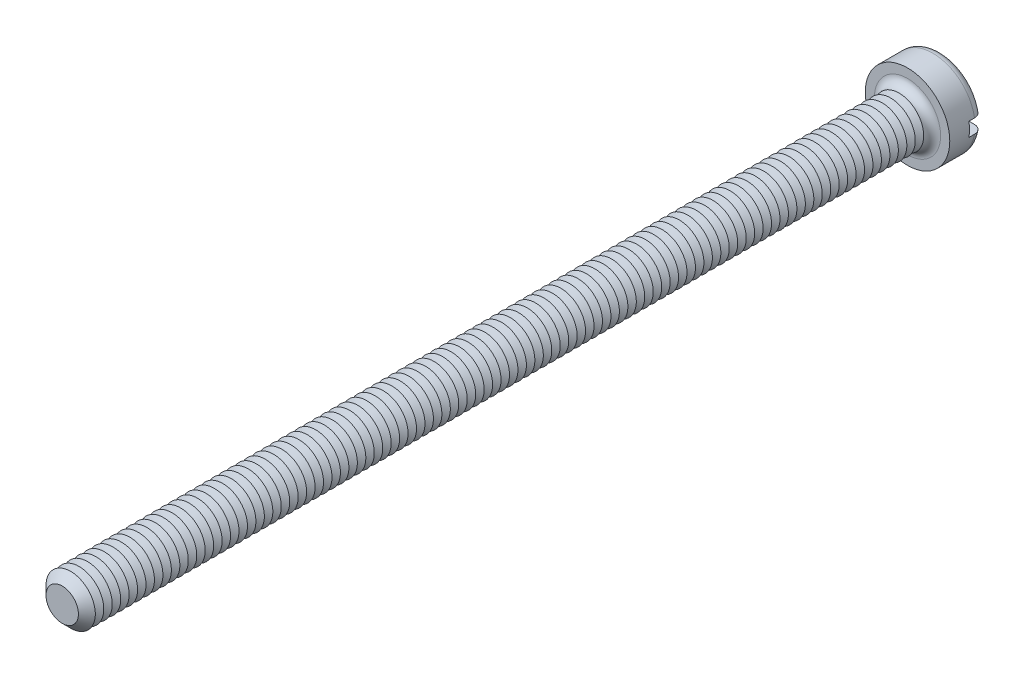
ISO-10303-21;
HEADER;
FILE_DESCRIPTION(('STEP AP214'),'2;1');
FILE_NAME('part.step','',(''),(''),'','','');
FILE_SCHEMA(('AUTOMOTIVE_DESIGN { 1 0 10303 214 1 1 1 1 }'));
ENDSEC;
DATA;
#1=APPLICATION_CONTEXT('core data for automotive mechanical design processes');
#2=APPLICATION_PROTOCOL_DEFINITION('international standard','automotive_design',2000,#1);
#3=PRODUCT_CONTEXT('',#1,'mechanical');
#4=PRODUCT('Part','Part','',(#3));
#5=PRODUCT_RELATED_PRODUCT_CATEGORY('part','',(#4));
#6=PRODUCT_DEFINITION_FORMATION('','',#4);
#7=PRODUCT_DEFINITION_CONTEXT('part definition',#1,'design');
#8=PRODUCT_DEFINITION('design','',#6,#7);
#9=PRODUCT_DEFINITION_SHAPE('','',#8);
#10=(LENGTH_UNIT() NAMED_UNIT(*) SI_UNIT(.MILLI.,.METRE.));
#11=(NAMED_UNIT(*) PLANE_ANGLE_UNIT() SI_UNIT($,.RADIAN.));
#12=(NAMED_UNIT(*) SI_UNIT($,.STERADIAN.) SOLID_ANGLE_UNIT());
#13=UNCERTAINTY_MEASURE_WITH_UNIT(LENGTH_MEASURE(1.E-05),#10,'distance_accuracy_value','');
#14=(GEOMETRIC_REPRESENTATION_CONTEXT(3) GLOBAL_UNCERTAINTY_ASSIGNED_CONTEXT((#13)) GLOBAL_UNIT_ASSIGNED_CONTEXT((#10,
#11,#12)) REPRESENTATION_CONTEXT('',''));
#15=CARTESIAN_POINT('',(0.,0.,0.));
#16=DIRECTION('',(0.,0.,1.));
#17=DIRECTION('',(1.,0.,0.));
#18=AXIS2_PLACEMENT_3D('',#15,#16,#17);
#19=CARTESIAN_POINT('',(0.,0.,-2.4));
#20=DIRECTION('',(0.,0.,1.));
#21=DIRECTION('',(1.,0.,0.));
#22=AXIS2_PLACEMENT_3D('',#19,#20,#21);
#23=PLANE('',#22);
#24=CARTESIAN_POINT('',(0.,0.,-2.4));
#25=DIRECTION('',(0.,0.,1.));
#26=DIRECTION('',(1.,0.,0.));
#27=AXIS2_PLACEMENT_3D('',#24,#25,#26);
#28=CIRCLE('',#27,2.4);
#29=CARTESIAN_POINT('',(-2.3473389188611,0.5,-2.4));
#30=VERTEX_POINT('',#29);
#31=CARTESIAN_POINT('',(2.3473389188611,0.5,-2.4));
#32=VERTEX_POINT('',#31);
#33=EDGE_CURVE('E116',#30,#32,#28,.F.);
#34=ORIENTED_EDGE('',*,*,#33,.T.);
#35=DIRECTION('',(1.,0.,0.));
#36=VECTOR('',#35,1.);
#37=CARTESIAN_POINT('',(-3.,0.5,-2.4));
#38=LINE('',#37,#36);
#39=EDGE_CURVE('E111',#30,#32,#38,.T.);
#40=ORIENTED_EDGE('',*,*,#39,.F.);
#41=EDGE_LOOP('',(#34,#40));
#42=FACE_BOUND('',#41,.T.);
#43=ADVANCED_FACE('F39',(#42),#23,.F.);
#44=CARTESIAN_POINT('',(0.,0.,-1.8));
#45=DIRECTION('',(0.,0.,1.));
#46=DIRECTION('',(1.,0.,0.));
#47=AXIS2_PLACEMENT_3D('',#44,#45,#46);
#48=TOROIDAL_SURFACE('',#47,2.4,0.6);
#49=CARTESIAN_POINT('',(-2.85761641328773,0.5,-2.13010535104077));
#50=CARTESIAN_POINT('',(-2.83871556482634,0.5,-2.1583605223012));
#51=CARTESIAN_POINT('',(-2.81738546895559,0.5,-2.18502342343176));
#52=CARTESIAN_POINT('',(-2.7705148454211,0.5,-2.23439244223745));
#53=CARTESIAN_POINT('',(-2.74496859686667,0.5,-2.25709309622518));
#54=CARTESIAN_POINT('',(-2.6904684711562,0.5,-2.29787524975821));
#55=CARTESIAN_POINT('',(-2.66151863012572,0.5,-2.3159621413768));
#56=CARTESIAN_POINT('',(-2.60103287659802,0.5,-2.34708203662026));
#57=CARTESIAN_POINT('',(-2.56949759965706,0.5,-2.36011627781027));
#58=CARTESIAN_POINT('',(-2.50430694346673,0.5,-2.38095952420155));
#59=CARTESIAN_POINT('',(-2.47062984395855,0.5,-2.38870056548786));
#60=CARTESIAN_POINT('',(-2.40245905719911,0.5,-2.39852415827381));
#61=CARTESIAN_POINT('',(-2.36796525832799,0.5,-2.40060593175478));
#62=CARTESIAN_POINT('',(-2.29850850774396,0.5,-2.39907718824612));
#63=CARTESIAN_POINT('',(-2.2635477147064,0.5,-2.3953679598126));
#64=CARTESIAN_POINT('',(-2.19472542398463,0.5,-2.38219781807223));
#65=CARTESIAN_POINT('',(-2.16086402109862,0.5,-2.37273641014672));
#66=CARTESIAN_POINT('',(-2.09483473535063,0.5,-2.3481926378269));
#67=CARTESIAN_POINT('',(-2.06268841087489,0.5,-2.3330521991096));
#68=CARTESIAN_POINT('',(-2.00140871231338,0.5,-2.29756210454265));
#69=CARTESIAN_POINT('',(-1.97227539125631,0.5,-2.27721235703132));
#70=CARTESIAN_POINT('',(-1.91805676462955,0.5,-2.23196210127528));
#71=CARTESIAN_POINT('',(-1.89294995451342,0.5,-2.20708739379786));
#72=CARTESIAN_POINT('',(-1.84740424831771,0.5,-2.1533758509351));
#73=CARTESIAN_POINT('',(-1.82696468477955,0.5,-2.12453958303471));
#74=CARTESIAN_POINT('',(-1.7919439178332,0.5,-2.06452274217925));
#75=CARTESIAN_POINT('',(-1.7772221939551,0.5,-2.03342424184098));
#76=CARTESIAN_POINT('',(-1.75343025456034,0.5,-1.96913621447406));
#77=CARTESIAN_POINT('',(-1.74435859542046,0.5,-1.93594722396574));
#78=CARTESIAN_POINT('',(-1.73243855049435,0.5,-1.86969199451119));
#79=CARTESIAN_POINT('',(-1.72938008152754,0.5,-1.83666346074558));
#80=CARTESIAN_POINT('',(-1.72896592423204,0.5,-1.77057287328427));
#81=CARTESIAN_POINT('',(-1.73160950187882,0.5,-1.73751082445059));
#82=CARTESIAN_POINT('',(-1.7423966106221,0.5,-1.67291835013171));
#83=CARTESIAN_POINT('',(-1.75043952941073,0.5,-1.64137102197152));
#84=CARTESIAN_POINT('',(-1.77163396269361,0.5,-1.58004446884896));
#85=CARTESIAN_POINT('',(-1.78478577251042,0.5,-1.55026534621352));
#86=CARTESIAN_POINT('',(-1.81598186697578,0.5,-1.49283859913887));
#87=CARTESIAN_POINT('',(-1.83409369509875,0.5,-1.46522772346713));
#88=CARTESIAN_POINT('',(-1.87455179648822,0.5,-1.41330756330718));
#89=CARTESIAN_POINT('',(-1.89689874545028,0.5,-1.38899880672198));
#90=CARTESIAN_POINT('',(-1.94600584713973,0.5,-1.34349499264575));
#91=CARTESIAN_POINT('',(-1.97289034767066,0.5,-1.32243411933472));
#92=CARTESIAN_POINT('',(-2.02972905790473,0.5,-1.28496935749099));
#93=CARTESIAN_POINT('',(-2.05968375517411,0.5,-1.26856621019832));
#94=CARTESIAN_POINT('',(-2.12276894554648,0.5,-1.24040709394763));
#95=CARTESIAN_POINT('',(-2.15596700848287,0.5,-1.22880230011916));
#96=CARTESIAN_POINT('',(-2.22383000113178,0.5,-1.21126311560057));
#97=CARTESIAN_POINT('',(-2.25849504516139,0.5,-1.20532916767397));
#98=CARTESIAN_POINT('',(-2.32870403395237,0.5,-1.1992792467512));
#99=CARTESIAN_POINT('',(-2.36425340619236,0.5,-1.19922586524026));
#100=CARTESIAN_POINT('',(-2.4348506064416,0.5,-1.2051326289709));
#101=CARTESIAN_POINT('',(-2.4698984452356,0.5,-1.21109264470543));
#102=CARTESIAN_POINT('',(-2.53821803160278,0.5,-1.22883658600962));
#103=CARTESIAN_POINT('',(-2.57150081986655,0.5,-1.24057794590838));
#104=CARTESIAN_POINT('',(-2.63557260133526,0.5,-1.2695744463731));
#105=CARTESIAN_POINT('',(-2.66636179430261,0.5,-1.28682914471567));
#106=CARTESIAN_POINT('',(-2.72402406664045,0.5,-1.32606063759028));
#107=CARTESIAN_POINT('',(-2.75095352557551,0.5,-1.34795455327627));
#108=CARTESIAN_POINT('',(-2.80067182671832,0.5,-1.39602603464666));
#109=CARTESIAN_POINT('',(-2.82346106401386,0.5,-1.42220319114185));
#110=CARTESIAN_POINT('',(-2.86383281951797,0.5,-1.47760238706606));
#111=CARTESIAN_POINT('',(-2.88149947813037,0.5,-1.50676312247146));
#112=CARTESIAN_POINT('',(-2.91160874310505,0.5,-1.56766595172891));
#113=CARTESIAN_POINT('',(-2.92405198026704,0.5,-1.59940773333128));
#114=CARTESIAN_POINT('',(-2.94319943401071,0.5,-1.66411282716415));
#115=CARTESIAN_POINT('',(-2.94997843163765,0.5,-1.69705402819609));
#116=CARTESIAN_POINT('',(-2.95787009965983,0.5,-1.7636173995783));
#117=CARTESIAN_POINT('',(-2.95898157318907,0.5,-1.79723971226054));
#118=CARTESIAN_POINT('',(-2.95551354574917,0.5,-1.86397776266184));
#119=CARTESIAN_POINT('',(-2.95096897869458,0.5,-1.89709534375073));
#120=CARTESIAN_POINT('',(-2.93638731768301,0.5,-1.96206785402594));
#121=CARTESIAN_POINT('',(-2.92635713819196,0.5,-1.99392431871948));
#122=CARTESIAN_POINT('',(-2.90618743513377,0.5,-2.04315073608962));
#123=CARTESIAN_POINT('',(-2.89769874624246,0.5,-2.06121519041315));
#124=CARTESIAN_POINT('',(-2.87895753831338,0.5,-2.096404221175));
#125=CARTESIAN_POINT('',(-2.86870503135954,0.5,-2.11352880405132));
#126=CARTESIAN_POINT('',(-2.85761641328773,0.5,-2.13010535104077));
#127=B_SPLINE_CURVE_WITH_KNOTS('',3,(#49,#50,#51,#52,#53,#54,#55,#56,#57,#58,#59,#60,#61,#62,
#63,#64,#65,#66,#67,#68,#69,#70,#71,#72,#73,#74,#75,#76,#77,#78,#79,#80,#81,#82,#83,#84,#85,#86,
#87,#88,#89,#90,#91,#92,#93,#94,#95,#96,#97,#98,#99,#100,#101,#102,#103,#104,#105,#106,#107,
#108,#109,#110,#111,#112,#113,#114,#115,#116,#117,#118,#119,#120,#121,#122,#123,#124,#125,#126),
.UNSPECIFIED.,.T.,.F.,(4,2,2,2,2,2,2,2,2,2,2,2,2,2,2,2,2,2,2,2,2,2,2,2,2,2,2,2,2,2,2,2,2,2,2,2,
2,2,4),(0.,0.101907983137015,0.203955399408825,0.305883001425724,0.407785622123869,
0.510973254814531,0.614175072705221,0.719155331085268,0.824144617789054,0.930238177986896,
1.03633360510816,1.14184204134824,1.24733537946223,1.35004136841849,1.45272110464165,
1.5517448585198,1.65075586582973,1.74797128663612,1.84519232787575,1.9438094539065,
2.0424423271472,2.14443321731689,2.24644032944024,2.35145317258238,2.45647421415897,
2.56261297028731,2.66874944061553,2.77411589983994,2.87947390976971,2.98308820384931,
3.08669260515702,3.18848388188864,3.29026286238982,3.39067588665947,3.49111011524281,
3.59092708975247,3.69061853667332,3.75040561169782,3.81019227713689),.UNSPECIFIED.);
#128=CARTESIAN_POINT('',(-2.95803989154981,0.5,-1.8));
#129=VERTEX_POINT('',#128);
#130=EDGE_CURVE('E963',#129,#30,#127,.T.);
#131=ORIENTED_EDGE('',*,*,#130,.F.);
#132=CARTESIAN_POINT('',(0.,0.,-1.8));
#133=DIRECTION('',(0.,0.,1.));
#134=DIRECTION('',(1.,0.,0.));
#135=AXIS2_PLACEMENT_3D('',#132,#133,#134);
#136=CIRCLE('',#135,3.);
#137=CARTESIAN_POINT('',(2.95803989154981,0.5,-1.8));
#138=VERTEX_POINT('',#137);
#139=EDGE_CURVE('E125',#138,#129,#136,.T.);
#140=ORIENTED_EDGE('',*,*,#139,.F.);
#141=CARTESIAN_POINT('',(1.78664846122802,0.5,-2.05158390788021));
#142=CARTESIAN_POINT('',(1.80142751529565,0.5,-2.08239430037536));
#143=CARTESIAN_POINT('',(1.81889355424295,0.5,-2.111949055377));
#144=CARTESIAN_POINT('',(1.8585933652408,0.5,-2.16770384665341));
#145=CARTESIAN_POINT('',(1.88083491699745,0.5,-2.19389829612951));
#146=CARTESIAN_POINT('',(1.92931942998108,0.5,-2.24217519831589));
#147=CARTESIAN_POINT('',(1.95555471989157,0.5,-2.26426535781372));
#148=CARTESIAN_POINT('',(2.01127789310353,0.5,-2.30384045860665));
#149=CARTESIAN_POINT('',(2.04076488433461,0.5,-2.32132665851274));
#150=CARTESIAN_POINT('',(2.10290022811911,0.5,-2.3516259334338));
#151=CARTESIAN_POINT('',(2.13560600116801,0.5,-2.3643213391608));
#152=CARTESIAN_POINT('',(2.20267136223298,0.5,-2.38412242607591));
#153=CARTESIAN_POINT('',(2.23703118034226,0.5,-2.3912273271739));
#154=CARTESIAN_POINT('',(2.30690186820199,0.5,-2.39969404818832));
#155=CARTESIAN_POINT('',(2.34242185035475,0.5,-2.40098100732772));
#156=CARTESIAN_POINT('',(2.41317063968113,0.5,-2.39753827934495));
#157=CARTESIAN_POINT('',(2.44839945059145,0.5,-2.39280866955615));
#158=CARTESIAN_POINT('',(2.51734146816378,0.5,-2.37746773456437));
#159=CARTESIAN_POINT('',(2.55106223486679,0.5,-2.3668904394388));
#160=CARTESIAN_POINT('',(2.61620389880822,0.5,-2.34013333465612));
#161=CARTESIAN_POINT('',(2.64762498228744,0.5,-2.32395397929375));
#162=CARTESIAN_POINT('',(2.70673284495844,0.5,-2.28672393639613));
#163=CARTESIAN_POINT('',(2.73447138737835,0.5,-2.26575544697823));
#164=CARTESIAN_POINT('',(2.78595339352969,0.5,-2.21938197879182));
#165=CARTESIAN_POINT('',(2.80969724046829,0.5,-2.19397742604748));
#166=CARTESIAN_POINT('',(2.85207235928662,0.5,-2.13993965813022));
#167=CARTESIAN_POINT('',(2.87078674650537,0.5,-2.11137160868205));
#168=CARTESIAN_POINT('',(2.90307455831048,0.5,-2.05146448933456));
#169=CARTESIAN_POINT('',(2.91664841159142,0.5,-2.02012565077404));
#170=CARTESIAN_POINT('',(2.93808283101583,0.5,-1.95603682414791));
#171=CARTESIAN_POINT('',(2.94602016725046,0.5,-1.92331249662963));
#172=CARTESIAN_POINT('',(2.95624273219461,0.5,-1.85699296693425));
#173=CARTESIAN_POINT('',(2.95852824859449,0.5,-1.82339780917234));
#174=CARTESIAN_POINT('',(2.95738171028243,0.5,-1.75655451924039));
#175=CARTESIAN_POINT('',(2.95399174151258,0.5,-1.72330565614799));
#176=CARTESIAN_POINT('',(2.94167749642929,0.5,-1.65784996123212));
#177=CARTESIAN_POINT('',(2.93275329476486,0.5,-1.62564311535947));
#178=CARTESIAN_POINT('',(2.90963870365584,0.5,-1.56317641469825));
#179=CARTESIAN_POINT('',(2.89544787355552,0.5,-1.53291672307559));
#180=CARTESIAN_POINT('',(2.86222325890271,0.5,-1.47518589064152));
#181=CARTESIAN_POINT('',(2.84318935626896,0.5,-1.44771481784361));
#182=CARTESIAN_POINT('',(2.80067851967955,0.5,-1.39611362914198));
#183=CARTESIAN_POINT('',(2.77716960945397,0.5,-1.37200986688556));
#184=CARTESIAN_POINT('',(2.72648704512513,0.5,-1.3280274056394));
#185=CARTESIAN_POINT('',(2.69931317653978,0.5,-1.3081489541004));
#186=CARTESIAN_POINT('',(2.64167967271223,0.5,-1.27288334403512));
#187=CARTESIAN_POINT('',(2.61118015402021,0.5,-1.25756138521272));
#188=CARTESIAN_POINT('',(2.54807315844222,0.5,-1.2321564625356));
#189=CARTESIAN_POINT('',(2.51546550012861,0.5,-1.22207395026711));
#190=CARTESIAN_POINT('',(2.44846246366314,0.5,-1.20724783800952));
#191=CARTESIAN_POINT('',(2.41404584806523,0.5,-1.2026002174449));
#192=CARTESIAN_POINT('',(2.34491756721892,0.5,-1.19904907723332));
#193=CARTESIAN_POINT('',(2.3102058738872,0.5,-1.20014611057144));
#194=CARTESIAN_POINT('',(2.24087507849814,0.5,-1.20808958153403));
#195=CARTESIAN_POINT('',(2.20626660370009,0.5,-1.21502895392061));
#196=CARTESIAN_POINT('',(2.13868705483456,0.5,-1.23457616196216));
#197=CARTESIAN_POINT('',(2.10571611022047,0.5,-1.24718444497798));
#198=CARTESIAN_POINT('',(2.04212010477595,0.5,-1.2778419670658));
#199=CARTESIAN_POINT('',(2.0115131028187,0.5,-1.29592871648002));
#200=CARTESIAN_POINT('',(1.95381117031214,0.5,-1.33703838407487));
#201=CARTESIAN_POINT('',(1.92671618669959,0.5,-1.36006122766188));
#202=CARTESIAN_POINT('',(1.8771749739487,0.5,-1.41014760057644));
#203=CARTESIAN_POINT('',(1.85467966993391,0.5,-1.43716252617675));
#204=CARTESIAN_POINT('',(1.8147167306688,0.5,-1.49468601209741));
#205=CARTESIAN_POINT('',(1.79724791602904,0.5,-1.52519375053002));
#206=CARTESIAN_POINT('',(1.76843420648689,0.5,-1.58782676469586));
#207=CARTESIAN_POINT('',(1.75691546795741,0.5,-1.61987202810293));
#208=CARTESIAN_POINT('',(1.73963101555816,0.5,-1.68548715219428));
#209=CARTESIAN_POINT('',(1.73386545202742,0.5,-1.71905705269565));
#210=CARTESIAN_POINT('',(1.72840927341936,0.5,-1.78556262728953));
#211=CARTESIAN_POINT('',(1.72852416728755,0.5,-1.8184825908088));
#212=CARTESIAN_POINT('',(1.73434422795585,0.5,-1.88379362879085));
#213=CARTESIAN_POINT('',(1.74004181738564,0.5,-1.91618535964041));
#214=CARTESIAN_POINT('',(1.75312909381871,0.5,-1.96568884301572));
#215=CARTESIAN_POINT('',(1.75869685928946,0.5,-1.98330302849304));
#216=CARTESIAN_POINT('',(1.77146455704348,0.5,-2.01792824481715));
#217=CARTESIAN_POINT('',(1.7786644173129,0.5,-2.03493930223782));
#218=CARTESIAN_POINT('',(1.78664846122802,0.5,-2.05158390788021));
#219=B_SPLINE_CURVE_WITH_KNOTS('',3,(#141,#142,#143,#144,#145,#146,#147,#148,#149,#150,#151,
#152,#153,#154,#155,#156,#157,#158,#159,#160,#161,#162,#163,#164,#165,#166,#167,#168,#169,#170,
#171,#172,#173,#174,#175,#176,#177,#178,#179,#180,#181,#182,#183,#184,#185,#186,#187,#188,#189,
#190,#191,#192,#193,#194,#195,#196,#197,#198,#199,#200,#201,#202,#203,#204,#205,#206,#207,#208,
#209,#210,#211,#212,#213,#214,#215,#216,#217,#218),.UNSPECIFIED.,.T.,.F.,(4,2,2,2,2,2,2,2,2,2,2,
2,2,2,2,2,2,2,2,2,2,2,2,2,2,2,2,2,2,2,2,2,2,2,2,2,2,2,4),(0.,0.10244464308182,0.205057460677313,
0.307475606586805,0.409865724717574,0.514628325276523,0.619405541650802,0.72552718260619,
0.831647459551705,0.937156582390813,1.04265715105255,1.1464674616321,1.25026780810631,
1.3522293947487,1.45418247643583,1.55471883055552,1.6552500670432,1.75503912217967,
1.8548268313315,1.95462289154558,2.05442138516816,2.15496174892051,2.25550799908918,
2.35743049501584,2.45936177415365,2.56306719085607,2.66678259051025,2.77217967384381,
2.87758507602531,2.98372914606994,3.08987161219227,3.19481457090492,3.29973288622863,
3.40138228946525,3.50303434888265,3.60132659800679,3.69948562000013,3.75483142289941,
3.8101747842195),.UNSPECIFIED.);
#220=EDGE_CURVE('E965',#32,#138,#219,.T.);
#221=ORIENTED_EDGE('',*,*,#220,.F.);
#222=ORIENTED_EDGE('',*,*,#33,.F.);
#223=EDGE_LOOP('',(#131,#140,#221,#222));
#224=FACE_BOUND('',#223,.T.);
#225=ADVANCED_FACE('F947',(#224),#48,.T.);
#226=CARTESIAN_POINT('',(0.,0.,-2.4));
#227=DIRECTION('',(0.,0.,1.));
#228=DIRECTION('',(1.,0.,0.));
#229=AXIS2_PLACEMENT_3D('',#226,#227,#228);
#230=CYLINDRICAL_SURFACE('',#229,3.);
#231=DIRECTION('',(0.,0.,1.));
#232=VECTOR('',#231,1.);
#233=CARTESIAN_POINT('',(2.95803989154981,0.5,-2.4));
#234=LINE('',#233,#232);
#235=CARTESIAN_POINT('',(2.95803989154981,0.5,-1.4));
#236=VERTEX_POINT('',#235);
#237=EDGE_CURVE('E981',#138,#236,#234,.T.);
#238=ORIENTED_EDGE('',*,*,#237,.F.);
#239=ORIENTED_EDGE('',*,*,#139,.T.);
#240=DIRECTION('',(0.,0.,1.));
#241=VECTOR('',#240,1.);
#242=CARTESIAN_POINT('',(-2.95803989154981,0.5,-2.4));
#243=LINE('',#242,#241);
#244=CARTESIAN_POINT('',(-2.95803989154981,0.5,-1.4));
#245=VERTEX_POINT('',#244);
#246=EDGE_CURVE('E63',#245,#129,#243,.F.);
#247=ORIENTED_EDGE('',*,*,#246,.F.);
#248=CARTESIAN_POINT('',(0.,0.,-1.4));
#249=DIRECTION('',(0.,0.,-1.));
#250=DIRECTION('',(-1.,0.,0.));
#251=AXIS2_PLACEMENT_3D('',#248,#249,#250);
#252=CIRCLE('',#251,3.);
#253=CARTESIAN_POINT('',(-2.95803989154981,-0.5,-1.4));
#254=VERTEX_POINT('',#253);
#255=EDGE_CURVE('E43',#245,#254,#252,.F.);
#256=ORIENTED_EDGE('',*,*,#255,.T.);
#257=DIRECTION('',(0.,0.,1.));
#258=VECTOR('',#257,1.);
#259=CARTESIAN_POINT('',(-2.95803989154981,-0.5,-2.4));
#260=LINE('',#259,#258);
#261=CARTESIAN_POINT('',(-2.9580398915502,-0.5,-1.79999999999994));
#262=VERTEX_POINT('',#261);
#263=EDGE_CURVE('E978',#262,#254,#260,.T.);
#264=ORIENTED_EDGE('',*,*,#263,.F.);
#265=CARTESIAN_POINT('',(2.95803989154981,-0.5,-1.8));
#266=VERTEX_POINT('',#265);
#267=EDGE_CURVE('E127',#262,#266,#136,.T.);
#268=ORIENTED_EDGE('',*,*,#267,.T.);
#269=DIRECTION('',(0.,0.,1.));
#270=VECTOR('',#269,1.);
#271=CARTESIAN_POINT('',(2.95803989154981,-0.5,-2.4));
#272=LINE('',#271,#270);
#273=CARTESIAN_POINT('',(2.95803989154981,-0.5,-1.4));
#274=VERTEX_POINT('',#273);
#275=EDGE_CURVE('E55',#274,#266,#272,.F.);
#276=ORIENTED_EDGE('',*,*,#275,.F.);
#277=EDGE_CURVE('E11',#274,#236,#252,.F.);
#278=ORIENTED_EDGE('',*,*,#277,.T.);
#279=EDGE_LOOP('',(#238,#239,#247,#256,#264,#268,#276,#278));
#280=FACE_BOUND('',#279,.T.);
#281=CARTESIAN_POINT('',(0.,0.,0.));
#282=DIRECTION('',(0.,0.,1.));
#283=DIRECTION('',(1.,0.,0.));
#284=AXIS2_PLACEMENT_3D('',#281,#282,#283);
#285=CIRCLE('',#284,3.);
#286=CARTESIAN_POINT('',(3.,0.,0.));
#287=VERTEX_POINT('',#286);
#288=EDGE_CURVE('E984',#287,#287,#285,.T.);
#289=ORIENTED_EDGE('',*,*,#288,.F.);
#290=EDGE_LOOP('',(#289));
#291=FACE_BOUND('',#290,.T.);
#292=ADVANCED_FACE('F943',(#280,#291),#230,.T.);
#293=CARTESIAN_POINT('',(2.3473389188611,-0.5,-2.4));
#294=VERTEX_POINT('',#293);
#295=CARTESIAN_POINT('',(-2.3473389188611,-0.5,-2.4));
#296=VERTEX_POINT('',#295);
#297=EDGE_CURVE('E109',#294,#296,#28,.F.);
#298=ORIENTED_EDGE('',*,*,#297,.T.);
#299=DIRECTION('',(-1.,0.,0.));
#300=VECTOR('',#299,1.);
#301=CARTESIAN_POINT('',(-3.,-0.5,-2.4));
#302=LINE('',#301,#300);
#303=EDGE_CURVE('E96',#294,#296,#302,.T.);
#304=ORIENTED_EDGE('',*,*,#303,.F.);
#305=EDGE_LOOP('',(#298,#304));
#306=FACE_BOUND('',#305,.T.);
#307=ADVANCED_FACE('F108',(#306),#23,.F.);
#308=CARTESIAN_POINT('',(0.,0.,0.));
#309=DIRECTION('',(0.,0.,1.));
#310=DIRECTION('',(1.,0.,0.));
#311=AXIS2_PLACEMENT_3D('',#308,#309,#310);
#312=PLANE('',#311);
#313=CARTESIAN_POINT('',(0.,0.,0.));
#314=DIRECTION('',(0.,0.,1.));
#315=DIRECTION('',(1.,0.,0.));
#316=AXIS2_PLACEMENT_3D('',#313,#314,#315);
#317=CIRCLE('',#316,2.35);
#318=CARTESIAN_POINT('',(2.35,0.,0.));
#319=VERTEX_POINT('',#318);
#320=EDGE_CURVE('E115',#319,#319,#317,.F.);
#321=ORIENTED_EDGE('',*,*,#320,.T.);
#322=EDGE_LOOP('',(#321));
#323=FACE_BOUND('',#322,.T.);
#324=ORIENTED_EDGE('',*,*,#288,.T.);
#325=EDGE_LOOP('',(#324));
#326=FACE_BOUND('',#325,.T.);
#327=ADVANCED_FACE('F942',(#323,#326),#312,.T.);
#328=CARTESIAN_POINT('',(-2.85761641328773,-0.5,-2.13010535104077));
#329=CARTESIAN_POINT('',(-2.87617085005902,-0.5,-2.10236255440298));
#330=CARTESIAN_POINT('',(-2.89241094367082,-0.5,-2.07304478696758));
#331=CARTESIAN_POINT('',(-2.91975805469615,-0.5,-2.01207835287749));
#332=CARTESIAN_POINT('',(-2.93085958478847,-0.5,-1.98042723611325));
#333=CARTESIAN_POINT('',(-2.94757590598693,-0.5,-1.91570997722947));
#334=CARTESIAN_POINT('',(-2.95319165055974,-0.5,-1.88264408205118));
#335=CARTESIAN_POINT('',(-2.95876526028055,-0.5,-1.81604673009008));
#336=CARTESIAN_POINT('',(-2.95872441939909,-0.5,-1.78251538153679));
#337=CARTESIAN_POINT('',(-2.95300126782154,-0.5,-1.71606888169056));
#338=CARTESIAN_POINT('',(-2.94734076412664,-0.5,-1.68315184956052));
#339=CARTESIAN_POINT('',(-2.93058183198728,-0.5,-1.61873244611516));
#340=CARTESIAN_POINT('',(-2.91948325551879,-0.5,-1.58723011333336));
#341=CARTESIAN_POINT('',(-2.89215903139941,-0.5,-1.52647404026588));
#342=CARTESIAN_POINT('',(-2.87592518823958,-0.5,-1.49722398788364));
#343=CARTESIAN_POINT('',(-2.83881787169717,-0.5,-1.44183365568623));
#344=CARTESIAN_POINT('',(-2.81794425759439,-0.5,-1.41569347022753));
#345=CARTESIAN_POINT('',(-2.77196258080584,-0.5,-1.36700890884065));
#346=CARTESIAN_POINT('',(-2.74681874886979,-0.5,-1.34449832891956));
#347=CARTESIAN_POINT('',(-2.69315595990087,-0.5,-1.30394571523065));
#348=CARTESIAN_POINT('',(-2.66463678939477,-0.5,-1.28590396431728));
#349=CARTESIAN_POINT('',(-2.6045885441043,-0.5,-1.25451133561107));
#350=CARTESIAN_POINT('',(-2.573021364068,-0.5,-1.24123336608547));
#351=CARTESIAN_POINT('',(-2.50813094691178,-0.5,-1.22006271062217));
#352=CARTESIAN_POINT('',(-2.47480755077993,-0.5,-1.21217051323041));
#353=CARTESIAN_POINT('',(-2.40672281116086,-0.5,-1.20185046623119));
#354=CARTESIAN_POINT('',(-2.37194646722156,-0.5,-1.19952155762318));
#355=CARTESIAN_POINT('',(-2.30248663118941,-0.5,-1.20064178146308));
#356=CARTESIAN_POINT('',(-2.26780314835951,-0.5,-1.20409147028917));
#357=CARTESIAN_POINT('',(-2.19896003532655,-0.5,-1.21674803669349));
#358=CARTESIAN_POINT('',(-2.16481620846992,-0.5,-1.22604100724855));
#359=CARTESIAN_POINT('',(-2.09855902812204,-0.5,-1.25020237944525));
#360=CARTESIAN_POINT('',(-2.0664458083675,-0.5,-1.2650711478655));
#361=CARTESIAN_POINT('',(-2.00504979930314,-0.5,-1.3000633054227));
#362=CARTESIAN_POINT('',(-1.97577870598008,-0.5,-1.32020724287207));
#363=CARTESIAN_POINT('',(-1.92109882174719,-0.5,-1.36519538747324));
#364=CARTESIAN_POINT('',(-1.89568984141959,-0.5,-1.39003936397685));
#365=CARTESIAN_POINT('',(-1.84992350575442,-0.5,-1.44333696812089));
#366=CARTESIAN_POINT('',(-1.82949305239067,-0.5,-1.47172774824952));
#367=CARTESIAN_POINT('',(-1.79388305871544,-0.5,-1.53163225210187));
#368=CARTESIAN_POINT('',(-1.77870235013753,-0.5,-1.56314527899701));
#369=CARTESIAN_POINT('',(-1.7545759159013,-0.5,-1.62726698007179));
#370=CARTESIAN_POINT('',(-1.74543784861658,-0.5,-1.65980327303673));
#371=CARTESIAN_POINT('',(-1.73294830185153,-0.5,-1.72596654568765));
#372=CARTESIAN_POINT('',(-1.72959555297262,-0.5,-1.7595932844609));
#373=CARTESIAN_POINT('',(-1.72881879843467,-0.5,-1.82588200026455));
#374=CARTESIAN_POINT('',(-1.73121660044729,-0.5,-1.85854202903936));
#375=CARTESIAN_POINT('',(-1.74148022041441,-0.5,-1.9229888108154));
#376=CARTESIAN_POINT('',(-1.74934586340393,-0.5,-1.95477559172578));
#377=CARTESIAN_POINT('',(-1.77023164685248,-0.5,-2.01650910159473));
#378=CARTESIAN_POINT('',(-1.78323812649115,-0.5,-2.04646046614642));
#379=CARTESIAN_POINT('',(-1.81396733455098,-0.5,-2.10383471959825));
#380=CARTESIAN_POINT('',(-1.83169061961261,-0.5,-2.13125730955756));
#381=CARTESIAN_POINT('',(-1.87183626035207,-0.5,-2.18359240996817));
#382=CARTESIAN_POINT('',(-1.89437158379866,-0.5,-2.20841820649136));
#383=CARTESIAN_POINT('',(-1.9431646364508,-0.5,-2.25409214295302));
#384=CARTESIAN_POINT('',(-1.96942301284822,-0.5,-2.27493958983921));
#385=CARTESIAN_POINT('',(-2.025898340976,-0.5,-2.31281042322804));
#386=CARTESIAN_POINT('',(-2.05622082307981,-0.5,-2.32967654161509));
#387=CARTESIAN_POINT('',(-2.11922391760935,-0.5,-2.35820255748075));
#388=CARTESIAN_POINT('',(-2.15190483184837,-0.5,-2.3698617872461));
#389=CARTESIAN_POINT('',(-2.21944675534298,-0.5,-2.38785911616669));
#390=CARTESIAN_POINT('',(-2.25433929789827,-0.5,-2.39407914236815));
#391=CARTESIAN_POINT('',(-2.32467357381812,-0.5,-2.40058243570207));
#392=CARTESIAN_POINT('',(-2.36011530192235,-0.5,-2.40086575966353));
#393=CARTESIAN_POINT('',(-2.43058129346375,-0.5,-2.39545061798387));
#394=CARTESIAN_POINT('',(-2.46560504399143,-0.5,-2.38974544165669));
#395=CARTESIAN_POINT('',(-2.53418188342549,-0.5,-2.37245602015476));
#396=CARTESIAN_POINT('',(-2.56773468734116,-0.5,-2.36087064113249));
#397=CARTESIAN_POINT('',(-2.63195003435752,-0.5,-2.33229154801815));
#398=CARTESIAN_POINT('',(-2.66264330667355,-0.5,-2.31536681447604));
#399=CARTESIAN_POINT('',(-2.72065333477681,-0.5,-2.2765252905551));
#400=CARTESIAN_POINT('',(-2.7479744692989,-0.5,-2.25461508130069));
#401=CARTESIAN_POINT('',(-2.78903570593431,-0.5,-2.21539504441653));
#402=CARTESIAN_POINT('',(-2.80405150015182,-0.5,-2.19939833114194));
#403=CARTESIAN_POINT('',(-2.83224965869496,-0.5,-2.16586257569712));
#404=CARTESIAN_POINT('',(-2.84543204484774,-0.5,-2.14832355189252));
#405=CARTESIAN_POINT('',(-2.85761641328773,-0.5,-2.13010535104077));
#406=B_SPLINE_CURVE_WITH_KNOTS('',3,(#328,#329,#330,#331,#332,#333,#334,#335,#336,#337,#338,
#339,#340,#341,#342,#343,#344,#345,#346,#347,#348,#349,#350,#351,#352,#353,#354,#355,#356,#357,
#358,#359,#360,#361,#362,#363,#364,#365,#366,#367,#368,#369,#370,#371,#372,#373,#374,#375,#376,
#377,#378,#379,#380,#381,#382,#383,#384,#385,#386,#387,#388,#389,#390,#391,#392,#393,#394,#395,
#396,#397,#398,#399,#400,#401,#402,#403,#404,#405),.UNSPECIFIED.,.T.,.F.,(4,2,2,2,2,2,2,2,2,2,2,
2,2,2,2,2,2,2,2,2,2,2,2,2,2,2,2,2,2,2,2,2,2,2,2,2,2,2,4),(0.,0.100047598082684,
0.200201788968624,0.300338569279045,0.400452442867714,0.500179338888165,0.599908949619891,
0.699798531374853,0.799691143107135,0.900465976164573,1.00124718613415,1.10351091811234,
1.20578392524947,1.30986270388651,1.41395150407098,1.51961105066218,1.62527754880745,
1.73136193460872,1.83744111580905,1.94185359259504,2.04624281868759,2.1471248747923,
2.24798479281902,2.34575994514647,2.44353196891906,2.541045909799,2.63857136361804,
2.73870431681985,2.83885469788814,2.94247024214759,3.0460990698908,3.15192527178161,
3.25775046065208,3.36369436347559,3.46965870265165,3.57430655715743,3.67881706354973,
3.74451732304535,3.81021680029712),.UNSPECIFIED.);
#407=EDGE_CURVE('E103',#296,#262,#406,.T.);
#408=ORIENTED_EDGE('',*,*,#407,.F.);
#409=ORIENTED_EDGE('',*,*,#297,.F.);
#410=CARTESIAN_POINT('',(1.78664846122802,-0.5,-2.05158390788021));
#411=CARTESIAN_POINT('',(1.77253256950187,-0.5,-2.02214917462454));
#412=CARTESIAN_POINT('',(1.76084795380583,-0.5,-1.99152692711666));
#413=CARTESIAN_POINT('',(1.74276267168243,-0.5,-1.92873811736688));
#414=CARTESIAN_POINT('',(1.73636622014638,-0.5,-1.89657034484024));
#415=CARTESIAN_POINT('',(1.72910271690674,-0.5,-1.83160458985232));
#416=CARTESIAN_POINT('',(1.72823699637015,-0.5,-1.79880645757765));
#417=CARTESIAN_POINT('',(1.73207277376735,-0.5,-1.73354460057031));
#418=CARTESIAN_POINT('',(1.7367732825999,-0.5,-1.70108081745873));
#419=CARTESIAN_POINT('',(1.75151033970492,-0.5,-1.63763571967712));
#420=CARTESIAN_POINT('',(1.76150868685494,-0.5,-1.60664550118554));
#421=CARTESIAN_POINT('',(1.78646773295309,-0.5,-1.54673433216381));
#422=CARTESIAN_POINT('',(1.80142897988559,-0.5,-1.51781361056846));
#423=CARTESIAN_POINT('',(1.8361687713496,-0.5,-1.46223275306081));
#424=CARTESIAN_POINT('',(1.85603637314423,-0.5,-1.43562834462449));
#425=CARTESIAN_POINT('',(1.89981598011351,-0.5,-1.38598822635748));
#426=CARTESIAN_POINT('',(1.92372865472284,-0.5,-1.3629531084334));
#427=CARTESIAN_POINT('',(1.97581791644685,-0.5,-1.32025912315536));
#428=CARTESIAN_POINT('',(2.00411431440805,-0.5,-1.30074638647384));
#429=CARTESIAN_POINT('',(2.06351340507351,-0.5,-1.26660223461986));
#430=CARTESIAN_POINT('',(2.09461651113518,-0.5,-1.2519715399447));
#431=CARTESIAN_POINT('',(2.15964055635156,-0.5,-1.22763649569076));
#432=CARTESIAN_POINT('',(2.19361437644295,-0.5,-1.21807321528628));
#433=CARTESIAN_POINT('',(2.26268197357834,-0.5,-1.20474094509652));
#434=CARTESIAN_POINT('',(2.29777581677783,-0.5,-1.20097229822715));
#435=CARTESIAN_POINT('',(2.36834397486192,-0.5,-1.19935270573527));
#436=CARTESIAN_POINT('',(2.40381924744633,-0.5,-1.20154258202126));
#437=CARTESIAN_POINT('',(2.47388621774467,-0.5,-1.211906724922));
#438=CARTESIAN_POINT('',(2.50847794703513,-0.5,-1.22008077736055));
#439=CARTESIAN_POINT('',(2.57542869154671,-0.5,-1.24211740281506));
#440=CARTESIAN_POINT('',(2.60780612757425,-0.5,-1.25592395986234));
#441=CARTESIAN_POINT('',(2.66972487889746,-0.5,-1.28886991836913));
#442=CARTESIAN_POINT('',(2.69926644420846,-0.5,-1.3080088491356));
#443=CARTESIAN_POINT('',(2.75412764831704,-0.5,-1.35072337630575));
#444=CARTESIAN_POINT('',(2.77951140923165,-0.5,-1.37421661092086));
#445=CARTESIAN_POINT('',(2.82588981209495,-0.5,-1.42519687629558));
#446=CARTESIAN_POINT('',(2.84688487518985,-0.5,-1.4526835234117));
#447=CARTESIAN_POINT('',(2.88351678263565,-0.5,-1.51036368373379));
#448=CARTESIAN_POINT('',(2.89923879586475,-0.5,-1.54050312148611));
#449=CARTESIAN_POINT('',(2.92532780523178,-0.5,-1.60301687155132));
#450=CARTESIAN_POINT('',(2.93569520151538,-0.5,-1.63539101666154));
#451=CARTESIAN_POINT('',(2.95066155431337,-0.5,-1.70102985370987));
#452=CARTESIAN_POINT('',(2.95532930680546,-0.5,-1.73427887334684));
#453=CARTESIAN_POINT('',(2.9589838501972,-0.5,-1.80108716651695));
#454=CARTESIAN_POINT('',(2.95797087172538,-0.5,-1.83464642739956));
#455=CARTESIAN_POINT('',(2.9503157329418,-0.5,-1.90093629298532));
#456=CARTESIAN_POINT('',(2.9437032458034,-0.5,-1.93367033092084));
#457=CARTESIAN_POINT('',(2.92508830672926,-0.5,-1.99756717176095));
#458=CARTESIAN_POINT('',(2.91308586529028,-0.5,-2.02872997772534));
#459=CARTESIAN_POINT('',(2.88401713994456,-0.5,-2.08868263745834));
#460=CARTESIAN_POINT('',(2.86693946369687,-0.5,-2.11746696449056));
#461=CARTESIAN_POINT('',(2.82823635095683,-0.5,-2.17179415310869));
#462=CARTESIAN_POINT('',(2.80661076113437,-0.5,-2.19733690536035));
#463=CARTESIAN_POINT('',(2.75921750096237,-0.5,-2.24472182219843));
#464=CARTESIAN_POINT('',(2.73341278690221,-0.5,-2.26652692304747));
#465=CARTESIAN_POINT('',(2.67855512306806,-0.5,-2.30557116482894));
#466=CARTESIAN_POINT('',(2.64950194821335,-0.5,-2.32280998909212));
#467=CARTESIAN_POINT('',(2.58850670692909,-0.5,-2.35251615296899));
#468=CARTESIAN_POINT('',(2.55652763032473,-0.5,-2.36490748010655));
#469=CARTESIAN_POINT('',(2.4909651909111,-0.5,-2.38424946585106));
#470=CARTESIAN_POINT('',(2.45738167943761,-0.5,-2.39119961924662));
#471=CARTESIAN_POINT('',(2.38892891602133,-0.5,-2.39958830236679));
#472=CARTESIAN_POINT('',(2.35404742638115,-0.5,-2.40092701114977));
#473=CARTESIAN_POINT('',(2.28454389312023,-0.5,-2.39781917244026));
#474=CARTESIAN_POINT('',(2.24992186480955,-0.5,-2.39337228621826));
#475=CARTESIAN_POINT('',(2.18139250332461,-0.5,-2.37872879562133));
#476=CARTESIAN_POINT('',(2.14750264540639,-0.5,-2.36845030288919));
#477=CARTESIAN_POINT('',(2.08190943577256,-0.5,-2.34236291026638));
#478=CARTESIAN_POINT('',(2.05020675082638,-0.5,-2.32655233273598));
#479=CARTESIAN_POINT('',(1.98982495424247,-0.5,-2.28976285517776));
#480=CARTESIAN_POINT('',(1.96115527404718,-0.5,-2.26876847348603));
#481=CARTESIAN_POINT('',(1.90785147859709,-0.5,-2.22220002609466));
#482=CARTESIAN_POINT('',(1.88321231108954,-0.5,-2.19663177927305));
#483=CARTESIAN_POINT('',(1.84638483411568,-0.5,-2.15106161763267));
#484=CARTESIAN_POINT('',(1.8328227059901,-0.5,-2.13215328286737));
#485=CARTESIAN_POINT('',(1.80797918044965,-0.5,-2.09289185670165));
#486=CARTESIAN_POINT('',(1.79669771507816,-0.5,-2.07253880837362));
#487=CARTESIAN_POINT('',(1.78664846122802,-0.5,-2.05158390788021));
#488=B_SPLINE_CURVE_WITH_KNOTS('',3,(#410,#411,#412,#413,#414,#415,#416,#417,#418,#419,#420,
#421,#422,#423,#424,#425,#426,#427,#428,#429,#430,#431,#432,#433,#434,#435,#436,#437,#438,#439,
#440,#441,#442,#443,#444,#445,#446,#447,#448,#449,#450,#451,#452,#453,#454,#455,#456,#457,#458,
#459,#460,#461,#462,#463,#464,#465,#466,#467,#468,#469,#470,#471,#472,#473,#474,#475,#476,#477,
#478,#479,#480,#481,#482,#483,#484,#485,#486,#487),.UNSPECIFIED.,.T.,.F.,(4,2,2,2,2,2,2,2,2,2,2,
2,2,2,2,2,2,2,2,2,2,2,2,2,2,2,2,2,2,2,2,2,2,2,2,2,2,2,4),(0.,0.0978512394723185,0.19578039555,
0.293733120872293,0.391668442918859,0.488907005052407,0.58615630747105,0.685320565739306,
0.784501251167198,0.887148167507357,0.989810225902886,1.09519726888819,1.20059054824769,
1.30670769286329,1.41282103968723,1.51790384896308,1.62297738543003,1.72623563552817,
1.82948397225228,1.93097382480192,2.03245609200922,2.13270093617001,2.23294171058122,
2.33265458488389,2.43236726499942,2.53230548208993,2.63224706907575,2.73312861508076,
2.83401715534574,2.93642973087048,3.03885181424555,3.14308833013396,3.24733094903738,
3.35307493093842,3.45885100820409,3.56494689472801,3.67090875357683,3.74057217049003,
3.81023351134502),.UNSPECIFIED.);
#489=EDGE_CURVE('E92',#266,#294,#488,.T.);
#490=ORIENTED_EDGE('',*,*,#489,.F.);
#491=ORIENTED_EDGE('',*,*,#267,.F.);
#492=EDGE_LOOP('',(#408,#409,#490,#491));
#493=FACE_BOUND('',#492,.T.);
#494=ADVANCED_FACE('F113',(#493),#48,.T.);
#495=CARTESIAN_POINT('',(0.,0.,0.600000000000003));
#496=DIRECTION('',(0.,0.,1.));
#497=DIRECTION('',(1.,0.,0.));
#498=AXIS2_PLACEMENT_3D('',#495,#496,#497);
#499=TOROIDAL_SURFACE('',#498,2.35,0.6);
#500=ORIENTED_EDGE('',*,*,#320,.F.);
#501=EDGE_LOOP('',(#500));
#502=FACE_BOUND('',#501,.T.);
#503=CARTESIAN_POINT('',(0.,0.,0.600000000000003));
#504=DIRECTION('',(0.,0.,-1.));
#505=DIRECTION('',(-1.,0.,0.));
#506=AXIS2_PLACEMENT_3D('',#503,#504,#505);
#507=CIRCLE('',#506,1.75);
#508=CARTESIAN_POINT('',(-1.75,0.,0.600000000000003));
#509=VERTEX_POINT('',#508);
#510=EDGE_CURVE('E988',#509,#509,#507,.T.);
#511=ORIENTED_EDGE('',*,*,#510,.T.);
#512=EDGE_LOOP('',(#511));
#513=FACE_BOUND('',#512,.T.);
#514=ADVANCED_FACE('F935',(#502,#513),#499,.F.);
#515=CARTESIAN_POINT('',(0.,0.,0.900000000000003));
#516=DIRECTION('',(0.,0.,-1.));
#517=DIRECTION('',(-1.,0.,0.));
#518=AXIS2_PLACEMENT_3D('',#515,#516,#517);
#519=CONICAL_SURFACE('',#518,1.23038475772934,1.0471975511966);
#520=ORIENTED_EDGE('',*,*,#510,.F.);
#521=EDGE_LOOP('',(#520));
#522=FACE_BOUND('',#521,.T.);
#523=CARTESIAN_POINT('',(0.,0.,0.900000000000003));
#524=DIRECTION('',(0.,0.,-1.));
#525=DIRECTION('',(-1.,0.,0.));
#526=AXIS2_PLACEMENT_3D('',#523,#524,#525);
#527=CIRCLE('',#526,1.23038475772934);
#528=CARTESIAN_POINT('',(-1.23038475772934,0.,0.900000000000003));
#529=VERTEX_POINT('',#528);
#530=EDGE_CURVE('E994',#529,#529,#527,.T.);
#531=ORIENTED_EDGE('',*,*,#530,.T.);
#532=EDGE_LOOP('',(#531));
#533=FACE_BOUND('',#532,.T.);
#534=ADVANCED_FACE('F931',(#522,#533),#519,.T.);
#535=CARTESIAN_POINT('',(0.,0.,1.2));
#536=DIRECTION('',(0.,0.,1.));
#537=DIRECTION('',(1.,0.,0.));
#538=AXIS2_PLACEMENT_3D('',#535,#536,#537);
#539=CONICAL_SURFACE('',#538,1.75,1.0471975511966);
#540=ORIENTED_EDGE('',*,*,#530,.F.);
#541=EDGE_LOOP('',(#540));
#542=FACE_BOUND('',#541,.T.);
#543=CARTESIAN_POINT('',(0.,0.,1.2));
#544=DIRECTION('',(0.,0.,-1.));
#545=DIRECTION('',(-1.,0.,0.));
#546=AXIS2_PLACEMENT_3D('',#543,#544,#545);
#547=CIRCLE('',#546,1.75);
#548=CARTESIAN_POINT('',(-1.75,0.,1.2));
#549=VERTEX_POINT('',#548);
#550=EDGE_CURVE('E1000',#549,#549,#547,.T.);
#551=ORIENTED_EDGE('',*,*,#550,.T.);
#552=EDGE_LOOP('',(#551));
#553=FACE_BOUND('',#552,.T.);
#554=ADVANCED_FACE('F927',(#542,#553),#539,.T.);
#555=CARTESIAN_POINT('',(0.,0.,1.5));
#556=DIRECTION('',(0.,0.,-1.));
#557=DIRECTION('',(-1.,0.,0.));
#558=AXIS2_PLACEMENT_3D('',#555,#556,#557);
#559=CONICAL_SURFACE('',#558,1.23038475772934,1.0471975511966);
#560=ORIENTED_EDGE('',*,*,#550,.F.);
#561=EDGE_LOOP('',(#560));
#562=FACE_BOUND('',#561,.T.);
#563=CARTESIAN_POINT('',(0.,0.,1.5));
#564=DIRECTION('',(0.,0.,-1.));
#565=DIRECTION('',(-1.,0.,0.));
#566=AXIS2_PLACEMENT_3D('',#563,#564,#565);
#567=CIRCLE('',#566,1.23038475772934);
#568=CARTESIAN_POINT('',(-1.23038475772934,0.,1.5));
#569=VERTEX_POINT('',#568);
#570=EDGE_CURVE('E1004',#569,#569,#567,.T.);
#571=ORIENTED_EDGE('',*,*,#570,.T.);
#572=EDGE_LOOP('',(#571));
#573=FACE_BOUND('',#572,.T.);
#574=ADVANCED_FACE('F923',(#562,#573),#559,.T.);
#575=CARTESIAN_POINT('',(0.,0.,1.8));
#576=DIRECTION('',(0.,0.,1.));
#577=DIRECTION('',(1.,0.,0.));
#578=AXIS2_PLACEMENT_3D('',#575,#576,#577);
#579=CONICAL_SURFACE('',#578,1.75,1.0471975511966);
#580=ORIENTED_EDGE('',*,*,#570,.F.);
#581=EDGE_LOOP('',(#580));
#582=FACE_BOUND('',#581,.T.);
#583=CARTESIAN_POINT('',(0.,0.,1.8));
#584=DIRECTION('',(0.,0.,-1.));
#585=DIRECTION('',(-1.,0.,0.));
#586=AXIS2_PLACEMENT_3D('',#583,#584,#585);
#587=CIRCLE('',#586,1.75);
#588=CARTESIAN_POINT('',(-1.75,0.,1.8));
#589=VERTEX_POINT('',#588);
#590=EDGE_CURVE('E1008',#589,#589,#587,.T.);
#591=ORIENTED_EDGE('',*,*,#590,.T.);
#592=EDGE_LOOP('',(#591));
#593=FACE_BOUND('',#592,.T.);
#594=ADVANCED_FACE('F919',(#582,#593),#579,.T.);
#595=CARTESIAN_POINT('',(0.,0.,2.1));
#596=DIRECTION('',(0.,0.,-1.));
#597=DIRECTION('',(-1.,0.,0.));
#598=AXIS2_PLACEMENT_3D('',#595,#596,#597);
#599=CONICAL_SURFACE('',#598,1.23038475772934,1.0471975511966);
#600=ORIENTED_EDGE('',*,*,#590,.F.);
#601=EDGE_LOOP('',(#600));
#602=FACE_BOUND('',#601,.T.);
#603=CARTESIAN_POINT('',(0.,0.,2.1));
#604=DIRECTION('',(0.,0.,-1.));
#605=DIRECTION('',(-1.,0.,0.));
#606=AXIS2_PLACEMENT_3D('',#603,#604,#605);
#607=CIRCLE('',#606,1.23038475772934);
#608=CARTESIAN_POINT('',(-1.23038475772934,0.,2.1));
#609=VERTEX_POINT('',#608);
#610=EDGE_CURVE('E1012',#609,#609,#607,.T.);
#611=ORIENTED_EDGE('',*,*,#610,.T.);
#612=EDGE_LOOP('',(#611));
#613=FACE_BOUND('',#612,.T.);
#614=ADVANCED_FACE('F915',(#602,#613),#599,.T.);
#615=CARTESIAN_POINT('',(0.,0.,2.4));
#616=DIRECTION('',(0.,0.,1.));
#617=DIRECTION('',(1.,0.,0.));
#618=AXIS2_PLACEMENT_3D('',#615,#616,#617);
#619=CONICAL_SURFACE('',#618,1.75,1.0471975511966);
#620=ORIENTED_EDGE('',*,*,#610,.F.);
#621=EDGE_LOOP('',(#620));
#622=FACE_BOUND('',#621,.T.);
#623=CARTESIAN_POINT('',(0.,0.,2.4));
#624=DIRECTION('',(0.,0.,-1.));
#625=DIRECTION('',(-1.,0.,0.));
#626=AXIS2_PLACEMENT_3D('',#623,#624,#625);
#627=CIRCLE('',#626,1.75);
#628=CARTESIAN_POINT('',(-1.75,0.,2.4));
#629=VERTEX_POINT('',#628);
#630=EDGE_CURVE('E1016',#629,#629,#627,.T.);
#631=ORIENTED_EDGE('',*,*,#630,.T.);
#632=EDGE_LOOP('',(#631));
#633=FACE_BOUND('',#632,.T.);
#634=ADVANCED_FACE('F911',(#622,#633),#619,.T.);
#635=CARTESIAN_POINT('',(0.,0.,2.7));
#636=DIRECTION('',(0.,0.,-1.));
#637=DIRECTION('',(-1.,0.,0.));
#638=AXIS2_PLACEMENT_3D('',#635,#636,#637);
#639=CONICAL_SURFACE('',#638,1.23038475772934,1.0471975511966);
#640=ORIENTED_EDGE('',*,*,#630,.F.);
#641=EDGE_LOOP('',(#640));
#642=FACE_BOUND('',#641,.T.);
#643=CARTESIAN_POINT('',(0.,0.,2.7));
#644=DIRECTION('',(0.,0.,-1.));
#645=DIRECTION('',(-1.,0.,0.));
#646=AXIS2_PLACEMENT_3D('',#643,#644,#645);
#647=CIRCLE('',#646,1.23038475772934);
#648=CARTESIAN_POINT('',(-1.23038475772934,0.,2.7));
#649=VERTEX_POINT('',#648);
#650=EDGE_CURVE('E1019',#649,#649,#647,.T.);
#651=ORIENTED_EDGE('',*,*,#650,.T.);
#652=EDGE_LOOP('',(#651));
#653=FACE_BOUND('',#652,.T.);
#654=ADVANCED_FACE('F907',(#642,#653),#639,.T.);
#655=CARTESIAN_POINT('',(0.,0.,3.));
#656=DIRECTION('',(0.,0.,1.));
#657=DIRECTION('',(1.,0.,0.));
#658=AXIS2_PLACEMENT_3D('',#655,#656,#657);
#659=CONICAL_SURFACE('',#658,1.75,1.0471975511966);
#660=ORIENTED_EDGE('',*,*,#650,.F.);
#661=EDGE_LOOP('',(#660));
#662=FACE_BOUND('',#661,.T.);
#663=CARTESIAN_POINT('',(0.,0.,3.));
#664=DIRECTION('',(0.,0.,-1.));
#665=DIRECTION('',(-1.,0.,0.));
#666=AXIS2_PLACEMENT_3D('',#663,#664,#665);
#667=CIRCLE('',#666,1.75);
#668=CARTESIAN_POINT('',(-1.75,0.,3.));
#669=VERTEX_POINT('',#668);
#670=EDGE_CURVE('E1023',#669,#669,#667,.T.);
#671=ORIENTED_EDGE('',*,*,#670,.T.);
#672=EDGE_LOOP('',(#671));
#673=FACE_BOUND('',#672,.T.);
#674=ADVANCED_FACE('F903',(#662,#673),#659,.T.);
#675=CARTESIAN_POINT('',(0.,0.,3.3));
#676=DIRECTION('',(0.,0.,-1.));
#677=DIRECTION('',(-1.,0.,0.));
#678=AXIS2_PLACEMENT_3D('',#675,#676,#677);
#679=CONICAL_SURFACE('',#678,1.23038475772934,1.0471975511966);
#680=ORIENTED_EDGE('',*,*,#670,.F.);
#681=EDGE_LOOP('',(#680));
#682=FACE_BOUND('',#681,.T.);
#683=CARTESIAN_POINT('',(0.,0.,3.3));
#684=DIRECTION('',(0.,0.,-1.));
#685=DIRECTION('',(-1.,0.,0.));
#686=AXIS2_PLACEMENT_3D('',#683,#684,#685);
#687=CIRCLE('',#686,1.23038475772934);
#688=CARTESIAN_POINT('',(-1.23038475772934,0.,3.3));
#689=VERTEX_POINT('',#688);
#690=EDGE_CURVE('E1027',#689,#689,#687,.T.);
#691=ORIENTED_EDGE('',*,*,#690,.T.);
#692=EDGE_LOOP('',(#691));
#693=FACE_BOUND('',#692,.T.);
#694=ADVANCED_FACE('F899',(#682,#693),#679,.T.);
#695=CARTESIAN_POINT('',(0.,0.,3.6));
#696=DIRECTION('',(0.,0.,1.));
#697=DIRECTION('',(1.,0.,0.));
#698=AXIS2_PLACEMENT_3D('',#695,#696,#697);
#699=CONICAL_SURFACE('',#698,1.75,1.0471975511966);
#700=ORIENTED_EDGE('',*,*,#690,.F.);
#701=EDGE_LOOP('',(#700));
#702=FACE_BOUND('',#701,.T.);
#703=CARTESIAN_POINT('',(0.,0.,3.6));
#704=DIRECTION('',(0.,0.,-1.));
#705=DIRECTION('',(-1.,0.,0.));
#706=AXIS2_PLACEMENT_3D('',#703,#704,#705);
#707=CIRCLE('',#706,1.75);
#708=CARTESIAN_POINT('',(-1.75,0.,3.6));
#709=VERTEX_POINT('',#708);
#710=EDGE_CURVE('E1031',#709,#709,#707,.T.);
#711=ORIENTED_EDGE('',*,*,#710,.T.);
#712=EDGE_LOOP('',(#711));
#713=FACE_BOUND('',#712,.T.);
#714=ADVANCED_FACE('F895',(#702,#713),#699,.T.);
#715=CARTESIAN_POINT('',(0.,0.,3.9));
#716=DIRECTION('',(0.,0.,-1.));
#717=DIRECTION('',(-1.,0.,0.));
#718=AXIS2_PLACEMENT_3D('',#715,#716,#717);
#719=CONICAL_SURFACE('',#718,1.23038475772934,1.0471975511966);
#720=ORIENTED_EDGE('',*,*,#710,.F.);
#721=EDGE_LOOP('',(#720));
#722=FACE_BOUND('',#721,.T.);
#723=CARTESIAN_POINT('',(0.,0.,3.9));
#724=DIRECTION('',(0.,0.,-1.));
#725=DIRECTION('',(-1.,0.,0.));
#726=AXIS2_PLACEMENT_3D('',#723,#724,#725);
#727=CIRCLE('',#726,1.23038475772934);
#728=CARTESIAN_POINT('',(-1.23038475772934,0.,3.9));
#729=VERTEX_POINT('',#728);
#730=EDGE_CURVE('E1035',#729,#729,#727,.T.);
#731=ORIENTED_EDGE('',*,*,#730,.T.);
#732=EDGE_LOOP('',(#731));
#733=FACE_BOUND('',#732,.T.);
#734=ADVANCED_FACE('F891',(#722,#733),#719,.T.);
#735=CARTESIAN_POINT('',(0.,0.,4.2));
#736=DIRECTION('',(0.,0.,1.));
#737=DIRECTION('',(1.,0.,0.));
#738=AXIS2_PLACEMENT_3D('',#735,#736,#737);
#739=CONICAL_SURFACE('',#738,1.75,1.0471975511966);
#740=ORIENTED_EDGE('',*,*,#730,.F.);
#741=EDGE_LOOP('',(#740));
#742=FACE_BOUND('',#741,.T.);
#743=CARTESIAN_POINT('',(0.,0.,4.2));
#744=DIRECTION('',(0.,0.,-1.));
#745=DIRECTION('',(-1.,0.,0.));
#746=AXIS2_PLACEMENT_3D('',#743,#744,#745);
#747=CIRCLE('',#746,1.75);
#748=CARTESIAN_POINT('',(-1.75,0.,4.2));
#749=VERTEX_POINT('',#748);
#750=EDGE_CURVE('E1039',#749,#749,#747,.T.);
#751=ORIENTED_EDGE('',*,*,#750,.T.);
#752=EDGE_LOOP('',(#751));
#753=FACE_BOUND('',#752,.T.);
#754=ADVANCED_FACE('F887',(#742,#753),#739,.T.);
#755=CARTESIAN_POINT('',(0.,0.,4.5));
#756=DIRECTION('',(0.,0.,-1.));
#757=DIRECTION('',(-1.,0.,0.));
#758=AXIS2_PLACEMENT_3D('',#755,#756,#757);
#759=CONICAL_SURFACE('',#758,1.23038475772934,1.0471975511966);
#760=ORIENTED_EDGE('',*,*,#750,.F.);
#761=EDGE_LOOP('',(#760));
#762=FACE_BOUND('',#761,.T.);
#763=CARTESIAN_POINT('',(0.,0.,4.5));
#764=DIRECTION('',(0.,0.,-1.));
#765=DIRECTION('',(-1.,0.,0.));
#766=AXIS2_PLACEMENT_3D('',#763,#764,#765);
#767=CIRCLE('',#766,1.23038475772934);
#768=CARTESIAN_POINT('',(-1.23038475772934,0.,4.5));
#769=VERTEX_POINT('',#768);
#770=EDGE_CURVE('E1042',#769,#769,#767,.T.);
#771=ORIENTED_EDGE('',*,*,#770,.T.);
#772=EDGE_LOOP('',(#771));
#773=FACE_BOUND('',#772,.T.);
#774=ADVANCED_FACE('F883',(#762,#773),#759,.T.);
#775=CARTESIAN_POINT('',(0.,0.,4.8));
#776=DIRECTION('',(0.,0.,1.));
#777=DIRECTION('',(1.,0.,0.));
#778=AXIS2_PLACEMENT_3D('',#775,#776,#777);
#779=CONICAL_SURFACE('',#778,1.75,1.0471975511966);
#780=ORIENTED_EDGE('',*,*,#770,.F.);
#781=EDGE_LOOP('',(#780));
#782=FACE_BOUND('',#781,.T.);
#783=CARTESIAN_POINT('',(0.,0.,4.8));
#784=DIRECTION('',(0.,0.,-1.));
#785=DIRECTION('',(-1.,0.,0.));
#786=AXIS2_PLACEMENT_3D('',#783,#784,#785);
#787=CIRCLE('',#786,1.75);
#788=CARTESIAN_POINT('',(-1.75,0.,4.8));
#789=VERTEX_POINT('',#788);
#790=EDGE_CURVE('E1046',#789,#789,#787,.T.);
#791=ORIENTED_EDGE('',*,*,#790,.T.);
#792=EDGE_LOOP('',(#791));
#793=FACE_BOUND('',#792,.T.);
#794=ADVANCED_FACE('F879',(#782,#793),#779,.T.);
#795=CARTESIAN_POINT('',(0.,0.,5.1));
#796=DIRECTION('',(0.,0.,-1.));
#797=DIRECTION('',(-1.,0.,0.));
#798=AXIS2_PLACEMENT_3D('',#795,#796,#797);
#799=CONICAL_SURFACE('',#798,1.23038475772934,1.0471975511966);
#800=ORIENTED_EDGE('',*,*,#790,.F.);
#801=EDGE_LOOP('',(#800));
#802=FACE_BOUND('',#801,.T.);
#803=CARTESIAN_POINT('',(0.,0.,5.1));
#804=DIRECTION('',(0.,0.,-1.));
#805=DIRECTION('',(-1.,0.,0.));
#806=AXIS2_PLACEMENT_3D('',#803,#804,#805);
#807=CIRCLE('',#806,1.23038475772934);
#808=CARTESIAN_POINT('',(-1.23038475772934,0.,5.1));
#809=VERTEX_POINT('',#808);
#810=EDGE_CURVE('E1050',#809,#809,#807,.T.);
#811=ORIENTED_EDGE('',*,*,#810,.T.);
#812=EDGE_LOOP('',(#811));
#813=FACE_BOUND('',#812,.T.);
#814=ADVANCED_FACE('F875',(#802,#813),#799,.T.);
#815=CARTESIAN_POINT('',(0.,0.,5.4));
#816=DIRECTION('',(0.,0.,1.));
#817=DIRECTION('',(1.,0.,0.));
#818=AXIS2_PLACEMENT_3D('',#815,#816,#817);
#819=CONICAL_SURFACE('',#818,1.75,1.0471975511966);
#820=ORIENTED_EDGE('',*,*,#810,.F.);
#821=EDGE_LOOP('',(#820));
#822=FACE_BOUND('',#821,.T.);
#823=CARTESIAN_POINT('',(0.,0.,5.4));
#824=DIRECTION('',(0.,0.,-1.));
#825=DIRECTION('',(-1.,0.,0.));
#826=AXIS2_PLACEMENT_3D('',#823,#824,#825);
#827=CIRCLE('',#826,1.75);
#828=CARTESIAN_POINT('',(-1.75,0.,5.4));
#829=VERTEX_POINT('',#828);
#830=EDGE_CURVE('E1054',#829,#829,#827,.T.);
#831=ORIENTED_EDGE('',*,*,#830,.T.);
#832=EDGE_LOOP('',(#831));
#833=FACE_BOUND('',#832,.T.);
#834=ADVANCED_FACE('F871',(#822,#833),#819,.T.);
#835=CARTESIAN_POINT('',(0.,0.,5.7));
#836=DIRECTION('',(0.,0.,-1.));
#837=DIRECTION('',(-1.,0.,0.));
#838=AXIS2_PLACEMENT_3D('',#835,#836,#837);
#839=CONICAL_SURFACE('',#838,1.23038475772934,1.0471975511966);
#840=ORIENTED_EDGE('',*,*,#830,.F.);
#841=EDGE_LOOP('',(#840));
#842=FACE_BOUND('',#841,.T.);
#843=CARTESIAN_POINT('',(0.,0.,5.7));
#844=DIRECTION('',(0.,0.,-1.));
#845=DIRECTION('',(-1.,0.,0.));
#846=AXIS2_PLACEMENT_3D('',#843,#844,#845);
#847=CIRCLE('',#846,1.23038475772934);
#848=CARTESIAN_POINT('',(-1.23038475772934,0.,5.7));
#849=VERTEX_POINT('',#848);
#850=EDGE_CURVE('E1058',#849,#849,#847,.T.);
#851=ORIENTED_EDGE('',*,*,#850,.T.);
#852=EDGE_LOOP('',(#851));
#853=FACE_BOUND('',#852,.T.);
#854=ADVANCED_FACE('F867',(#842,#853),#839,.T.);
#855=CARTESIAN_POINT('',(0.,0.,6.));
#856=DIRECTION('',(0.,0.,1.));
#857=DIRECTION('',(1.,0.,0.));
#858=AXIS2_PLACEMENT_3D('',#855,#856,#857);
#859=CONICAL_SURFACE('',#858,1.75,1.0471975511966);
#860=ORIENTED_EDGE('',*,*,#850,.F.);
#861=EDGE_LOOP('',(#860));
#862=FACE_BOUND('',#861,.T.);
#863=CARTESIAN_POINT('',(0.,0.,6.));
#864=DIRECTION('',(0.,0.,-1.));
#865=DIRECTION('',(-1.,0.,0.));
#866=AXIS2_PLACEMENT_3D('',#863,#864,#865);
#867=CIRCLE('',#866,1.75);
#868=CARTESIAN_POINT('',(-1.75,0.,6.));
#869=VERTEX_POINT('',#868);
#870=EDGE_CURVE('E1062',#869,#869,#867,.T.);
#871=ORIENTED_EDGE('',*,*,#870,.T.);
#872=EDGE_LOOP('',(#871));
#873=FACE_BOUND('',#872,.T.);
#874=ADVANCED_FACE('F863',(#862,#873),#859,.T.);
#875=CARTESIAN_POINT('',(0.,0.,6.3));
#876=DIRECTION('',(0.,0.,-1.));
#877=DIRECTION('',(-1.,0.,0.));
#878=AXIS2_PLACEMENT_3D('',#875,#876,#877);
#879=CONICAL_SURFACE('',#878,1.23038475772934,1.0471975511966);
#880=ORIENTED_EDGE('',*,*,#870,.F.);
#881=EDGE_LOOP('',(#880));
#882=FACE_BOUND('',#881,.T.);
#883=CARTESIAN_POINT('',(0.,0.,6.3));
#884=DIRECTION('',(0.,0.,-1.));
#885=DIRECTION('',(-1.,0.,0.));
#886=AXIS2_PLACEMENT_3D('',#883,#884,#885);
#887=CIRCLE('',#886,1.23038475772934);
#888=CARTESIAN_POINT('',(-1.23038475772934,0.,6.3));
#889=VERTEX_POINT('',#888);
#890=EDGE_CURVE('E1066',#889,#889,#887,.T.);
#891=ORIENTED_EDGE('',*,*,#890,.T.);
#892=EDGE_LOOP('',(#891));
#893=FACE_BOUND('',#892,.T.);
#894=ADVANCED_FACE('F859',(#882,#893),#879,.T.);
#895=CARTESIAN_POINT('',(0.,0.,6.6));
#896=DIRECTION('',(0.,0.,1.));
#897=DIRECTION('',(1.,0.,0.));
#898=AXIS2_PLACEMENT_3D('',#895,#896,#897);
#899=CONICAL_SURFACE('',#898,1.75,1.0471975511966);
#900=ORIENTED_EDGE('',*,*,#890,.F.);
#901=EDGE_LOOP('',(#900));
#902=FACE_BOUND('',#901,.T.);
#903=CARTESIAN_POINT('',(0.,0.,6.6));
#904=DIRECTION('',(0.,0.,-1.));
#905=DIRECTION('',(-1.,0.,0.));
#906=AXIS2_PLACEMENT_3D('',#903,#904,#905);
#907=CIRCLE('',#906,1.75);
#908=CARTESIAN_POINT('',(-1.75,0.,6.6));
#909=VERTEX_POINT('',#908);
#910=EDGE_CURVE('E1070',#909,#909,#907,.T.);
#911=ORIENTED_EDGE('',*,*,#910,.T.);
#912=EDGE_LOOP('',(#911));
#913=FACE_BOUND('',#912,.T.);
#914=ADVANCED_FACE('F855',(#902,#913),#899,.T.);
#915=CARTESIAN_POINT('',(0.,0.,6.9));
#916=DIRECTION('',(0.,0.,-1.));
#917=DIRECTION('',(-1.,0.,0.));
#918=AXIS2_PLACEMENT_3D('',#915,#916,#917);
#919=CONICAL_SURFACE('',#918,1.23038475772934,1.0471975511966);
#920=ORIENTED_EDGE('',*,*,#910,.F.);
#921=EDGE_LOOP('',(#920));
#922=FACE_BOUND('',#921,.T.);
#923=CARTESIAN_POINT('',(0.,0.,6.9));
#924=DIRECTION('',(0.,0.,-1.));
#925=DIRECTION('',(-1.,0.,0.));
#926=AXIS2_PLACEMENT_3D('',#923,#924,#925);
#927=CIRCLE('',#926,1.23038475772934);
#928=CARTESIAN_POINT('',(-1.23038475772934,0.,6.9));
#929=VERTEX_POINT('',#928);
#930=EDGE_CURVE('E1074',#929,#929,#927,.T.);
#931=ORIENTED_EDGE('',*,*,#930,.T.);
#932=EDGE_LOOP('',(#931));
#933=FACE_BOUND('',#932,.T.);
#934=ADVANCED_FACE('F851',(#922,#933),#919,.T.);
#935=CARTESIAN_POINT('',(0.,0.,7.2));
#936=DIRECTION('',(0.,0.,1.));
#937=DIRECTION('',(1.,0.,0.));
#938=AXIS2_PLACEMENT_3D('',#935,#936,#937);
#939=CONICAL_SURFACE('',#938,1.75,1.0471975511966);
#940=ORIENTED_EDGE('',*,*,#930,.F.);
#941=EDGE_LOOP('',(#940));
#942=FACE_BOUND('',#941,.T.);
#943=CARTESIAN_POINT('',(0.,0.,7.2));
#944=DIRECTION('',(0.,0.,-1.));
#945=DIRECTION('',(-1.,0.,0.));
#946=AXIS2_PLACEMENT_3D('',#943,#944,#945);
#947=CIRCLE('',#946,1.75);
#948=CARTESIAN_POINT('',(-1.75,0.,7.2));
#949=VERTEX_POINT('',#948);
#950=EDGE_CURVE('E1077',#949,#949,#947,.T.);
#951=ORIENTED_EDGE('',*,*,#950,.T.);
#952=EDGE_LOOP('',(#951));
#953=FACE_BOUND('',#952,.T.);
#954=ADVANCED_FACE('F847',(#942,#953),#939,.T.);
#955=CARTESIAN_POINT('',(0.,0.,7.5));
#956=DIRECTION('',(0.,0.,-1.));
#957=DIRECTION('',(-1.,0.,0.));
#958=AXIS2_PLACEMENT_3D('',#955,#956,#957);
#959=CONICAL_SURFACE('',#958,1.23038475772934,1.0471975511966);
#960=ORIENTED_EDGE('',*,*,#950,.F.);
#961=EDGE_LOOP('',(#960));
#962=FACE_BOUND('',#961,.T.);
#963=CARTESIAN_POINT('',(0.,0.,7.5));
#964=DIRECTION('',(0.,0.,-1.));
#965=DIRECTION('',(-1.,0.,0.));
#966=AXIS2_PLACEMENT_3D('',#963,#964,#965);
#967=CIRCLE('',#966,1.23038475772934);
#968=CARTESIAN_POINT('',(-1.23038475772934,0.,7.5));
#969=VERTEX_POINT('',#968);
#970=EDGE_CURVE('E1080',#969,#969,#967,.T.);
#971=ORIENTED_EDGE('',*,*,#970,.T.);
#972=EDGE_LOOP('',(#971));
#973=FACE_BOUND('',#972,.T.);
#974=ADVANCED_FACE('F843',(#962,#973),#959,.T.);
#975=CARTESIAN_POINT('',(0.,0.,7.8));
#976=DIRECTION('',(0.,0.,1.));
#977=DIRECTION('',(1.,0.,0.));
#978=AXIS2_PLACEMENT_3D('',#975,#976,#977);
#979=CONICAL_SURFACE('',#978,1.75,1.0471975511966);
#980=ORIENTED_EDGE('',*,*,#970,.F.);
#981=EDGE_LOOP('',(#980));
#982=FACE_BOUND('',#981,.T.);
#983=CARTESIAN_POINT('',(0.,0.,7.8));
#984=DIRECTION('',(0.,0.,-1.));
#985=DIRECTION('',(-1.,0.,0.));
#986=AXIS2_PLACEMENT_3D('',#983,#984,#985);
#987=CIRCLE('',#986,1.75);
#988=CARTESIAN_POINT('',(-1.75,0.,7.8));
#989=VERTEX_POINT('',#988);
#990=EDGE_CURVE('E1084',#989,#989,#987,.T.);
#991=ORIENTED_EDGE('',*,*,#990,.T.);
#992=EDGE_LOOP('',(#991));
#993=FACE_BOUND('',#992,.T.);
#994=ADVANCED_FACE('F839',(#982,#993),#979,.T.);
#995=CARTESIAN_POINT('',(0.,0.,8.1));
#996=DIRECTION('',(0.,0.,-1.));
#997=DIRECTION('',(-1.,0.,0.));
#998=AXIS2_PLACEMENT_3D('',#995,#996,#997);
#999=CONICAL_SURFACE('',#998,1.23038475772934,1.0471975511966);
#1000=ORIENTED_EDGE('',*,*,#990,.F.);
#1001=EDGE_LOOP('',(#1000));
#1002=FACE_BOUND('',#1001,.T.);
#1003=CARTESIAN_POINT('',(0.,0.,8.1));
#1004=DIRECTION('',(0.,0.,-1.));
#1005=DIRECTION('',(-1.,0.,0.));
#1006=AXIS2_PLACEMENT_3D('',#1003,#1004,#1005);
#1007=CIRCLE('',#1006,1.23038475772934);
#1008=CARTESIAN_POINT('',(-1.23038475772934,0.,8.1));
#1009=VERTEX_POINT('',#1008);
#1010=EDGE_CURVE('E1088',#1009,#1009,#1007,.T.);
#1011=ORIENTED_EDGE('',*,*,#1010,.T.);
#1012=EDGE_LOOP('',(#1011));
#1013=FACE_BOUND('',#1012,.T.);
#1014=ADVANCED_FACE('F835',(#1002,#1013),#999,.T.);
#1015=CARTESIAN_POINT('',(0.,0.,8.4));
#1016=DIRECTION('',(0.,0.,1.));
#1017=DIRECTION('',(1.,0.,0.));
#1018=AXIS2_PLACEMENT_3D('',#1015,#1016,#1017);
#1019=CONICAL_SURFACE('',#1018,1.75,1.0471975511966);
#1020=ORIENTED_EDGE('',*,*,#1010,.F.);
#1021=EDGE_LOOP('',(#1020));
#1022=FACE_BOUND('',#1021,.T.);
#1023=CARTESIAN_POINT('',(0.,0.,8.4));
#1024=DIRECTION('',(0.,0.,-1.));
#1025=DIRECTION('',(-1.,0.,0.));
#1026=AXIS2_PLACEMENT_3D('',#1023,#1024,#1025);
#1027=CIRCLE('',#1026,1.75);
#1028=CARTESIAN_POINT('',(-1.75,0.,8.4));
#1029=VERTEX_POINT('',#1028);
#1030=EDGE_CURVE('E1092',#1029,#1029,#1027,.T.);
#1031=ORIENTED_EDGE('',*,*,#1030,.T.);
#1032=EDGE_LOOP('',(#1031));
#1033=FACE_BOUND('',#1032,.T.);
#1034=ADVANCED_FACE('F831',(#1022,#1033),#1019,.T.);
#1035=CARTESIAN_POINT('',(0.,0.,8.7));
#1036=DIRECTION('',(0.,0.,-1.));
#1037=DIRECTION('',(-1.,0.,0.));
#1038=AXIS2_PLACEMENT_3D('',#1035,#1036,#1037);
#1039=CONICAL_SURFACE('',#1038,1.23038475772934,1.0471975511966);
#1040=ORIENTED_EDGE('',*,*,#1030,.F.);
#1041=EDGE_LOOP('',(#1040));
#1042=FACE_BOUND('',#1041,.T.);
#1043=CARTESIAN_POINT('',(0.,0.,8.7));
#1044=DIRECTION('',(0.,0.,-1.));
#1045=DIRECTION('',(-1.,0.,0.));
#1046=AXIS2_PLACEMENT_3D('',#1043,#1044,#1045);
#1047=CIRCLE('',#1046,1.23038475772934);
#1048=CARTESIAN_POINT('',(-1.23038475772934,0.,8.7));
#1049=VERTEX_POINT('',#1048);
#1050=EDGE_CURVE('E1096',#1049,#1049,#1047,.T.);
#1051=ORIENTED_EDGE('',*,*,#1050,.T.);
#1052=EDGE_LOOP('',(#1051));
#1053=FACE_BOUND('',#1052,.T.);
#1054=ADVANCED_FACE('F827',(#1042,#1053),#1039,.T.);
#1055=CARTESIAN_POINT('',(0.,0.,9.));
#1056=DIRECTION('',(0.,0.,1.));
#1057=DIRECTION('',(1.,0.,0.));
#1058=AXIS2_PLACEMENT_3D('',#1055,#1056,#1057);
#1059=CONICAL_SURFACE('',#1058,1.75,1.0471975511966);
#1060=ORIENTED_EDGE('',*,*,#1050,.F.);
#1061=EDGE_LOOP('',(#1060));
#1062=FACE_BOUND('',#1061,.T.);
#1063=CARTESIAN_POINT('',(0.,0.,9.));
#1064=DIRECTION('',(0.,0.,-1.));
#1065=DIRECTION('',(-1.,0.,0.));
#1066=AXIS2_PLACEMENT_3D('',#1063,#1064,#1065);
#1067=CIRCLE('',#1066,1.75);
#1068=CARTESIAN_POINT('',(-1.75,0.,9.));
#1069=VERTEX_POINT('',#1068);
#1070=EDGE_CURVE('E1100',#1069,#1069,#1067,.T.);
#1071=ORIENTED_EDGE('',*,*,#1070,.T.);
#1072=EDGE_LOOP('',(#1071));
#1073=FACE_BOUND('',#1072,.T.);
#1074=ADVANCED_FACE('F823',(#1062,#1073),#1059,.T.);
#1075=CARTESIAN_POINT('',(0.,0.,9.3));
#1076=DIRECTION('',(0.,0.,-1.));
#1077=DIRECTION('',(-1.,0.,0.));
#1078=AXIS2_PLACEMENT_3D('',#1075,#1076,#1077);
#1079=CONICAL_SURFACE('',#1078,1.23038475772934,1.0471975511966);
#1080=ORIENTED_EDGE('',*,*,#1070,.F.);
#1081=EDGE_LOOP('',(#1080));
#1082=FACE_BOUND('',#1081,.T.);
#1083=CARTESIAN_POINT('',(0.,0.,9.3));
#1084=DIRECTION('',(0.,0.,-1.));
#1085=DIRECTION('',(-1.,0.,0.));
#1086=AXIS2_PLACEMENT_3D('',#1083,#1084,#1085);
#1087=CIRCLE('',#1086,1.23038475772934);
#1088=CARTESIAN_POINT('',(-1.23038475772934,0.,9.3));
#1089=VERTEX_POINT('',#1088);
#1090=EDGE_CURVE('E1104',#1089,#1089,#1087,.T.);
#1091=ORIENTED_EDGE('',*,*,#1090,.T.);
#1092=EDGE_LOOP('',(#1091));
#1093=FACE_BOUND('',#1092,.T.);
#1094=ADVANCED_FACE('F819',(#1082,#1093),#1079,.T.);
#1095=CARTESIAN_POINT('',(0.,0.,9.6));
#1096=DIRECTION('',(0.,0.,1.));
#1097=DIRECTION('',(1.,0.,0.));
#1098=AXIS2_PLACEMENT_3D('',#1095,#1096,#1097);
#1099=CONICAL_SURFACE('',#1098,1.75,1.0471975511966);
#1100=ORIENTED_EDGE('',*,*,#1090,.F.);
#1101=EDGE_LOOP('',(#1100));
#1102=FACE_BOUND('',#1101,.T.);
#1103=CARTESIAN_POINT('',(0.,0.,9.6));
#1104=DIRECTION('',(0.,0.,-1.));
#1105=DIRECTION('',(-1.,0.,0.));
#1106=AXIS2_PLACEMENT_3D('',#1103,#1104,#1105);
#1107=CIRCLE('',#1106,1.75);
#1108=CARTESIAN_POINT('',(-1.75,0.,9.6));
#1109=VERTEX_POINT('',#1108);
#1110=EDGE_CURVE('E1108',#1109,#1109,#1107,.T.);
#1111=ORIENTED_EDGE('',*,*,#1110,.T.);
#1112=EDGE_LOOP('',(#1111));
#1113=FACE_BOUND('',#1112,.T.);
#1114=ADVANCED_FACE('F815',(#1102,#1113),#1099,.T.);
#1115=CARTESIAN_POINT('',(0.,0.,9.9));
#1116=DIRECTION('',(0.,0.,-1.));
#1117=DIRECTION('',(-1.,0.,0.));
#1118=AXIS2_PLACEMENT_3D('',#1115,#1116,#1117);
#1119=CONICAL_SURFACE('',#1118,1.23038475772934,1.0471975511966);
#1120=ORIENTED_EDGE('',*,*,#1110,.F.);
#1121=EDGE_LOOP('',(#1120));
#1122=FACE_BOUND('',#1121,.T.);
#1123=CARTESIAN_POINT('',(0.,0.,9.9));
#1124=DIRECTION('',(0.,0.,-1.));
#1125=DIRECTION('',(-1.,0.,0.));
#1126=AXIS2_PLACEMENT_3D('',#1123,#1124,#1125);
#1127=CIRCLE('',#1126,1.23038475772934);
#1128=CARTESIAN_POINT('',(-1.23038475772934,0.,9.9));
#1129=VERTEX_POINT('',#1128);
#1130=EDGE_CURVE('E1112',#1129,#1129,#1127,.T.);
#1131=ORIENTED_EDGE('',*,*,#1130,.T.);
#1132=EDGE_LOOP('',(#1131));
#1133=FACE_BOUND('',#1132,.T.);
#1134=ADVANCED_FACE('F811',(#1122,#1133),#1119,.T.);
#1135=CARTESIAN_POINT('',(0.,0.,10.2));
#1136=DIRECTION('',(0.,0.,1.));
#1137=DIRECTION('',(1.,0.,0.));
#1138=AXIS2_PLACEMENT_3D('',#1135,#1136,#1137);
#1139=CONICAL_SURFACE('',#1138,1.75,1.0471975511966);
#1140=ORIENTED_EDGE('',*,*,#1130,.F.);
#1141=EDGE_LOOP('',(#1140));
#1142=FACE_BOUND('',#1141,.T.);
#1143=CARTESIAN_POINT('',(0.,0.,10.2));
#1144=DIRECTION('',(0.,0.,-1.));
#1145=DIRECTION('',(-1.,0.,0.));
#1146=AXIS2_PLACEMENT_3D('',#1143,#1144,#1145);
#1147=CIRCLE('',#1146,1.75);
#1148=CARTESIAN_POINT('',(-1.75,0.,10.2));
#1149=VERTEX_POINT('',#1148);
#1150=EDGE_CURVE('E1116',#1149,#1149,#1147,.T.);
#1151=ORIENTED_EDGE('',*,*,#1150,.T.);
#1152=EDGE_LOOP('',(#1151));
#1153=FACE_BOUND('',#1152,.T.);
#1154=ADVANCED_FACE('F807',(#1142,#1153),#1139,.T.);
#1155=CARTESIAN_POINT('',(0.,0.,10.5));
#1156=DIRECTION('',(0.,0.,-1.));
#1157=DIRECTION('',(-1.,0.,0.));
#1158=AXIS2_PLACEMENT_3D('',#1155,#1156,#1157);
#1159=CONICAL_SURFACE('',#1158,1.23038475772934,1.0471975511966);
#1160=ORIENTED_EDGE('',*,*,#1150,.F.);
#1161=EDGE_LOOP('',(#1160));
#1162=FACE_BOUND('',#1161,.T.);
#1163=CARTESIAN_POINT('',(0.,0.,10.5));
#1164=DIRECTION('',(0.,0.,-1.));
#1165=DIRECTION('',(-1.,0.,0.));
#1166=AXIS2_PLACEMENT_3D('',#1163,#1164,#1165);
#1167=CIRCLE('',#1166,1.23038475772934);
#1168=CARTESIAN_POINT('',(-1.23038475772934,0.,10.5));
#1169=VERTEX_POINT('',#1168);
#1170=EDGE_CURVE('E1120',#1169,#1169,#1167,.T.);
#1171=ORIENTED_EDGE('',*,*,#1170,.T.);
#1172=EDGE_LOOP('',(#1171));
#1173=FACE_BOUND('',#1172,.T.);
#1174=ADVANCED_FACE('F803',(#1162,#1173),#1159,.T.);
#1175=CARTESIAN_POINT('',(0.,0.,10.8));
#1176=DIRECTION('',(0.,0.,1.));
#1177=DIRECTION('',(1.,0.,0.));
#1178=AXIS2_PLACEMENT_3D('',#1175,#1176,#1177);
#1179=CONICAL_SURFACE('',#1178,1.75,1.0471975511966);
#1180=ORIENTED_EDGE('',*,*,#1170,.F.);
#1181=EDGE_LOOP('',(#1180));
#1182=FACE_BOUND('',#1181,.T.);
#1183=CARTESIAN_POINT('',(0.,0.,10.8));
#1184=DIRECTION('',(0.,0.,-1.));
#1185=DIRECTION('',(-1.,0.,0.));
#1186=AXIS2_PLACEMENT_3D('',#1183,#1184,#1185);
#1187=CIRCLE('',#1186,1.75);
#1188=CARTESIAN_POINT('',(-1.75,0.,10.8));
#1189=VERTEX_POINT('',#1188);
#1190=EDGE_CURVE('E1124',#1189,#1189,#1187,.T.);
#1191=ORIENTED_EDGE('',*,*,#1190,.T.);
#1192=EDGE_LOOP('',(#1191));
#1193=FACE_BOUND('',#1192,.T.);
#1194=ADVANCED_FACE('F799',(#1182,#1193),#1179,.T.);
#1195=CARTESIAN_POINT('',(0.,0.,11.1));
#1196=DIRECTION('',(0.,0.,-1.));
#1197=DIRECTION('',(-1.,0.,0.));
#1198=AXIS2_PLACEMENT_3D('',#1195,#1196,#1197);
#1199=CONICAL_SURFACE('',#1198,1.23038475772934,1.0471975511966);
#1200=ORIENTED_EDGE('',*,*,#1190,.F.);
#1201=EDGE_LOOP('',(#1200));
#1202=FACE_BOUND('',#1201,.T.);
#1203=CARTESIAN_POINT('',(0.,0.,11.1));
#1204=DIRECTION('',(0.,0.,-1.));
#1205=DIRECTION('',(-1.,0.,0.));
#1206=AXIS2_PLACEMENT_3D('',#1203,#1204,#1205);
#1207=CIRCLE('',#1206,1.23038475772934);
#1208=CARTESIAN_POINT('',(-1.23038475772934,0.,11.1));
#1209=VERTEX_POINT('',#1208);
#1210=EDGE_CURVE('E1128',#1209,#1209,#1207,.T.);
#1211=ORIENTED_EDGE('',*,*,#1210,.T.);
#1212=EDGE_LOOP('',(#1211));
#1213=FACE_BOUND('',#1212,.T.);
#1214=ADVANCED_FACE('F795',(#1202,#1213),#1199,.T.);
#1215=CARTESIAN_POINT('',(0.,0.,11.4));
#1216=DIRECTION('',(0.,0.,1.));
#1217=DIRECTION('',(1.,0.,0.));
#1218=AXIS2_PLACEMENT_3D('',#1215,#1216,#1217);
#1219=CONICAL_SURFACE('',#1218,1.75,1.0471975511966);
#1220=ORIENTED_EDGE('',*,*,#1210,.F.);
#1221=EDGE_LOOP('',(#1220));
#1222=FACE_BOUND('',#1221,.T.);
#1223=CARTESIAN_POINT('',(0.,0.,11.4));
#1224=DIRECTION('',(0.,0.,-1.));
#1225=DIRECTION('',(-1.,0.,0.));
#1226=AXIS2_PLACEMENT_3D('',#1223,#1224,#1225);
#1227=CIRCLE('',#1226,1.75);
#1228=CARTESIAN_POINT('',(-1.75,0.,11.4));
#1229=VERTEX_POINT('',#1228);
#1230=EDGE_CURVE('E1132',#1229,#1229,#1227,.T.);
#1231=ORIENTED_EDGE('',*,*,#1230,.T.);
#1232=EDGE_LOOP('',(#1231));
#1233=FACE_BOUND('',#1232,.T.);
#1234=ADVANCED_FACE('F791',(#1222,#1233),#1219,.T.);
#1235=CARTESIAN_POINT('',(0.,0.,11.7));
#1236=DIRECTION('',(0.,0.,-1.));
#1237=DIRECTION('',(-1.,0.,0.));
#1238=AXIS2_PLACEMENT_3D('',#1235,#1236,#1237);
#1239=CONICAL_SURFACE('',#1238,1.23038475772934,1.0471975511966);
#1240=ORIENTED_EDGE('',*,*,#1230,.F.);
#1241=EDGE_LOOP('',(#1240));
#1242=FACE_BOUND('',#1241,.T.);
#1243=CARTESIAN_POINT('',(0.,0.,11.7));
#1244=DIRECTION('',(0.,0.,-1.));
#1245=DIRECTION('',(-1.,0.,0.));
#1246=AXIS2_PLACEMENT_3D('',#1243,#1244,#1245);
#1247=CIRCLE('',#1246,1.23038475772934);
#1248=CARTESIAN_POINT('',(-1.23038475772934,0.,11.7));
#1249=VERTEX_POINT('',#1248);
#1250=EDGE_CURVE('E1136',#1249,#1249,#1247,.T.);
#1251=ORIENTED_EDGE('',*,*,#1250,.T.);
#1252=EDGE_LOOP('',(#1251));
#1253=FACE_BOUND('',#1252,.T.);
#1254=ADVANCED_FACE('F787',(#1242,#1253),#1239,.T.);
#1255=CARTESIAN_POINT('',(0.,0.,12.));
#1256=DIRECTION('',(0.,0.,1.));
#1257=DIRECTION('',(1.,0.,0.));
#1258=AXIS2_PLACEMENT_3D('',#1255,#1256,#1257);
#1259=CONICAL_SURFACE('',#1258,1.75,1.0471975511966);
#1260=ORIENTED_EDGE('',*,*,#1250,.F.);
#1261=EDGE_LOOP('',(#1260));
#1262=FACE_BOUND('',#1261,.T.);
#1263=CARTESIAN_POINT('',(0.,0.,12.));
#1264=DIRECTION('',(0.,0.,-1.));
#1265=DIRECTION('',(-1.,0.,0.));
#1266=AXIS2_PLACEMENT_3D('',#1263,#1264,#1265);
#1267=CIRCLE('',#1266,1.75);
#1268=CARTESIAN_POINT('',(-1.75,0.,12.));
#1269=VERTEX_POINT('',#1268);
#1270=EDGE_CURVE('E1140',#1269,#1269,#1267,.T.);
#1271=ORIENTED_EDGE('',*,*,#1270,.T.);
#1272=EDGE_LOOP('',(#1271));
#1273=FACE_BOUND('',#1272,.T.);
#1274=ADVANCED_FACE('F783',(#1262,#1273),#1259,.T.);
#1275=CARTESIAN_POINT('',(0.,0.,12.3));
#1276=DIRECTION('',(0.,0.,-1.));
#1277=DIRECTION('',(-1.,0.,0.));
#1278=AXIS2_PLACEMENT_3D('',#1275,#1276,#1277);
#1279=CONICAL_SURFACE('',#1278,1.23038475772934,1.0471975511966);
#1280=ORIENTED_EDGE('',*,*,#1270,.F.);
#1281=EDGE_LOOP('',(#1280));
#1282=FACE_BOUND('',#1281,.T.);
#1283=CARTESIAN_POINT('',(0.,0.,12.3));
#1284=DIRECTION('',(0.,0.,-1.));
#1285=DIRECTION('',(-1.,0.,0.));
#1286=AXIS2_PLACEMENT_3D('',#1283,#1284,#1285);
#1287=CIRCLE('',#1286,1.23038475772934);
#1288=CARTESIAN_POINT('',(-1.23038475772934,0.,12.3));
#1289=VERTEX_POINT('',#1288);
#1290=EDGE_CURVE('E1144',#1289,#1289,#1287,.T.);
#1291=ORIENTED_EDGE('',*,*,#1290,.T.);
#1292=EDGE_LOOP('',(#1291));
#1293=FACE_BOUND('',#1292,.T.);
#1294=ADVANCED_FACE('F779',(#1282,#1293),#1279,.T.);
#1295=CARTESIAN_POINT('',(0.,0.,12.6));
#1296=DIRECTION('',(0.,0.,1.));
#1297=DIRECTION('',(1.,0.,0.));
#1298=AXIS2_PLACEMENT_3D('',#1295,#1296,#1297);
#1299=CONICAL_SURFACE('',#1298,1.75,1.0471975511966);
#1300=ORIENTED_EDGE('',*,*,#1290,.F.);
#1301=EDGE_LOOP('',(#1300));
#1302=FACE_BOUND('',#1301,.T.);
#1303=CARTESIAN_POINT('',(0.,0.,12.6));
#1304=DIRECTION('',(0.,0.,-1.));
#1305=DIRECTION('',(-1.,0.,0.));
#1306=AXIS2_PLACEMENT_3D('',#1303,#1304,#1305);
#1307=CIRCLE('',#1306,1.75);
#1308=CARTESIAN_POINT('',(-1.75,0.,12.6));
#1309=VERTEX_POINT('',#1308);
#1310=EDGE_CURVE('E1148',#1309,#1309,#1307,.T.);
#1311=ORIENTED_EDGE('',*,*,#1310,.T.);
#1312=EDGE_LOOP('',(#1311));
#1313=FACE_BOUND('',#1312,.T.);
#1314=ADVANCED_FACE('F775',(#1302,#1313),#1299,.T.);
#1315=CARTESIAN_POINT('',(0.,0.,12.9));
#1316=DIRECTION('',(0.,0.,-1.));
#1317=DIRECTION('',(-1.,0.,0.));
#1318=AXIS2_PLACEMENT_3D('',#1315,#1316,#1317);
#1319=CONICAL_SURFACE('',#1318,1.23038475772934,1.0471975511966);
#1320=ORIENTED_EDGE('',*,*,#1310,.F.);
#1321=EDGE_LOOP('',(#1320));
#1322=FACE_BOUND('',#1321,.T.);
#1323=CARTESIAN_POINT('',(0.,0.,12.9));
#1324=DIRECTION('',(0.,0.,-1.));
#1325=DIRECTION('',(-1.,0.,0.));
#1326=AXIS2_PLACEMENT_3D('',#1323,#1324,#1325);
#1327=CIRCLE('',#1326,1.23038475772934);
#1328=CARTESIAN_POINT('',(-1.23038475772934,0.,12.9));
#1329=VERTEX_POINT('',#1328);
#1330=EDGE_CURVE('E1152',#1329,#1329,#1327,.T.);
#1331=ORIENTED_EDGE('',*,*,#1330,.T.);
#1332=EDGE_LOOP('',(#1331));
#1333=FACE_BOUND('',#1332,.T.);
#1334=ADVANCED_FACE('F771',(#1322,#1333),#1319,.T.);
#1335=CARTESIAN_POINT('',(0.,0.,13.2));
#1336=DIRECTION('',(0.,0.,1.));
#1337=DIRECTION('',(1.,0.,0.));
#1338=AXIS2_PLACEMENT_3D('',#1335,#1336,#1337);
#1339=CONICAL_SURFACE('',#1338,1.75,1.0471975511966);
#1340=ORIENTED_EDGE('',*,*,#1330,.F.);
#1341=EDGE_LOOP('',(#1340));
#1342=FACE_BOUND('',#1341,.T.);
#1343=CARTESIAN_POINT('',(0.,0.,13.2));
#1344=DIRECTION('',(0.,0.,-1.));
#1345=DIRECTION('',(-1.,0.,0.));
#1346=AXIS2_PLACEMENT_3D('',#1343,#1344,#1345);
#1347=CIRCLE('',#1346,1.75);
#1348=CARTESIAN_POINT('',(-1.75,0.,13.2));
#1349=VERTEX_POINT('',#1348);
#1350=EDGE_CURVE('E1156',#1349,#1349,#1347,.T.);
#1351=ORIENTED_EDGE('',*,*,#1350,.T.);
#1352=EDGE_LOOP('',(#1351));
#1353=FACE_BOUND('',#1352,.T.);
#1354=ADVANCED_FACE('F767',(#1342,#1353),#1339,.T.);
#1355=CARTESIAN_POINT('',(0.,0.,13.5));
#1356=DIRECTION('',(0.,0.,-1.));
#1357=DIRECTION('',(-1.,0.,0.));
#1358=AXIS2_PLACEMENT_3D('',#1355,#1356,#1357);
#1359=CONICAL_SURFACE('',#1358,1.23038475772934,1.0471975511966);
#1360=ORIENTED_EDGE('',*,*,#1350,.F.);
#1361=EDGE_LOOP('',(#1360));
#1362=FACE_BOUND('',#1361,.T.);
#1363=CARTESIAN_POINT('',(0.,0.,13.5));
#1364=DIRECTION('',(0.,0.,-1.));
#1365=DIRECTION('',(-1.,0.,0.));
#1366=AXIS2_PLACEMENT_3D('',#1363,#1364,#1365);
#1367=CIRCLE('',#1366,1.23038475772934);
#1368=CARTESIAN_POINT('',(-1.23038475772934,0.,13.5));
#1369=VERTEX_POINT('',#1368);
#1370=EDGE_CURVE('E1160',#1369,#1369,#1367,.T.);
#1371=ORIENTED_EDGE('',*,*,#1370,.T.);
#1372=EDGE_LOOP('',(#1371));
#1373=FACE_BOUND('',#1372,.T.);
#1374=ADVANCED_FACE('F763',(#1362,#1373),#1359,.T.);
#1375=CARTESIAN_POINT('',(0.,0.,13.8));
#1376=DIRECTION('',(0.,0.,1.));
#1377=DIRECTION('',(1.,0.,0.));
#1378=AXIS2_PLACEMENT_3D('',#1375,#1376,#1377);
#1379=CONICAL_SURFACE('',#1378,1.75,1.0471975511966);
#1380=ORIENTED_EDGE('',*,*,#1370,.F.);
#1381=EDGE_LOOP('',(#1380));
#1382=FACE_BOUND('',#1381,.T.);
#1383=CARTESIAN_POINT('',(0.,0.,13.8));
#1384=DIRECTION('',(0.,0.,-1.));
#1385=DIRECTION('',(-1.,0.,0.));
#1386=AXIS2_PLACEMENT_3D('',#1383,#1384,#1385);
#1387=CIRCLE('',#1386,1.75);
#1388=CARTESIAN_POINT('',(-1.75,0.,13.8));
#1389=VERTEX_POINT('',#1388);
#1390=EDGE_CURVE('E1164',#1389,#1389,#1387,.T.);
#1391=ORIENTED_EDGE('',*,*,#1390,.T.);
#1392=EDGE_LOOP('',(#1391));
#1393=FACE_BOUND('',#1392,.T.);
#1394=ADVANCED_FACE('F759',(#1382,#1393),#1379,.T.);
#1395=CARTESIAN_POINT('',(0.,0.,14.1));
#1396=DIRECTION('',(0.,0.,-1.));
#1397=DIRECTION('',(-1.,0.,0.));
#1398=AXIS2_PLACEMENT_3D('',#1395,#1396,#1397);
#1399=CONICAL_SURFACE('',#1398,1.23038475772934,1.0471975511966);
#1400=ORIENTED_EDGE('',*,*,#1390,.F.);
#1401=EDGE_LOOP('',(#1400));
#1402=FACE_BOUND('',#1401,.T.);
#1403=CARTESIAN_POINT('',(0.,0.,14.1));
#1404=DIRECTION('',(0.,0.,-1.));
#1405=DIRECTION('',(-1.,0.,0.));
#1406=AXIS2_PLACEMENT_3D('',#1403,#1404,#1405);
#1407=CIRCLE('',#1406,1.23038475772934);
#1408=CARTESIAN_POINT('',(-1.23038475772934,0.,14.1));
#1409=VERTEX_POINT('',#1408);
#1410=EDGE_CURVE('E1168',#1409,#1409,#1407,.T.);
#1411=ORIENTED_EDGE('',*,*,#1410,.T.);
#1412=EDGE_LOOP('',(#1411));
#1413=FACE_BOUND('',#1412,.T.);
#1414=ADVANCED_FACE('F755',(#1402,#1413),#1399,.T.);
#1415=CARTESIAN_POINT('',(0.,0.,14.4));
#1416=DIRECTION('',(0.,0.,1.));
#1417=DIRECTION('',(1.,0.,0.));
#1418=AXIS2_PLACEMENT_3D('',#1415,#1416,#1417);
#1419=CONICAL_SURFACE('',#1418,1.75,1.0471975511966);
#1420=ORIENTED_EDGE('',*,*,#1410,.F.);
#1421=EDGE_LOOP('',(#1420));
#1422=FACE_BOUND('',#1421,.T.);
#1423=CARTESIAN_POINT('',(0.,0.,14.4));
#1424=DIRECTION('',(0.,0.,-1.));
#1425=DIRECTION('',(-1.,0.,0.));
#1426=AXIS2_PLACEMENT_3D('',#1423,#1424,#1425);
#1427=CIRCLE('',#1426,1.75);
#1428=CARTESIAN_POINT('',(-1.75,0.,14.4));
#1429=VERTEX_POINT('',#1428);
#1430=EDGE_CURVE('E1172',#1429,#1429,#1427,.T.);
#1431=ORIENTED_EDGE('',*,*,#1430,.T.);
#1432=EDGE_LOOP('',(#1431));
#1433=FACE_BOUND('',#1432,.T.);
#1434=ADVANCED_FACE('F751',(#1422,#1433),#1419,.T.);
#1435=CARTESIAN_POINT('',(0.,0.,14.7));
#1436=DIRECTION('',(0.,0.,-1.));
#1437=DIRECTION('',(-1.,0.,0.));
#1438=AXIS2_PLACEMENT_3D('',#1435,#1436,#1437);
#1439=CONICAL_SURFACE('',#1438,1.23038475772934,1.0471975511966);
#1440=ORIENTED_EDGE('',*,*,#1430,.F.);
#1441=EDGE_LOOP('',(#1440));
#1442=FACE_BOUND('',#1441,.T.);
#1443=CARTESIAN_POINT('',(0.,0.,14.7));
#1444=DIRECTION('',(0.,0.,-1.));
#1445=DIRECTION('',(-1.,0.,0.));
#1446=AXIS2_PLACEMENT_3D('',#1443,#1444,#1445);
#1447=CIRCLE('',#1446,1.23038475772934);
#1448=CARTESIAN_POINT('',(-1.23038475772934,0.,14.7));
#1449=VERTEX_POINT('',#1448);
#1450=EDGE_CURVE('E1176',#1449,#1449,#1447,.T.);
#1451=ORIENTED_EDGE('',*,*,#1450,.T.);
#1452=EDGE_LOOP('',(#1451));
#1453=FACE_BOUND('',#1452,.T.);
#1454=ADVANCED_FACE('F747',(#1442,#1453),#1439,.T.);
#1455=CARTESIAN_POINT('',(0.,0.,15.));
#1456=DIRECTION('',(0.,0.,1.));
#1457=DIRECTION('',(1.,0.,0.));
#1458=AXIS2_PLACEMENT_3D('',#1455,#1456,#1457);
#1459=CONICAL_SURFACE('',#1458,1.75,1.0471975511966);
#1460=ORIENTED_EDGE('',*,*,#1450,.F.);
#1461=EDGE_LOOP('',(#1460));
#1462=FACE_BOUND('',#1461,.T.);
#1463=CARTESIAN_POINT('',(0.,0.,15.));
#1464=DIRECTION('',(0.,0.,-1.));
#1465=DIRECTION('',(-1.,0.,0.));
#1466=AXIS2_PLACEMENT_3D('',#1463,#1464,#1465);
#1467=CIRCLE('',#1466,1.75);
#1468=CARTESIAN_POINT('',(-1.75,0.,15.));
#1469=VERTEX_POINT('',#1468);
#1470=EDGE_CURVE('E1180',#1469,#1469,#1467,.T.);
#1471=ORIENTED_EDGE('',*,*,#1470,.T.);
#1472=EDGE_LOOP('',(#1471));
#1473=FACE_BOUND('',#1472,.T.);
#1474=ADVANCED_FACE('F743',(#1462,#1473),#1459,.T.);
#1475=CARTESIAN_POINT('',(0.,0.,15.3));
#1476=DIRECTION('',(0.,0.,-1.));
#1477=DIRECTION('',(-1.,0.,0.));
#1478=AXIS2_PLACEMENT_3D('',#1475,#1476,#1477);
#1479=CONICAL_SURFACE('',#1478,1.23038475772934,1.0471975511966);
#1480=ORIENTED_EDGE('',*,*,#1470,.F.);
#1481=EDGE_LOOP('',(#1480));
#1482=FACE_BOUND('',#1481,.T.);
#1483=CARTESIAN_POINT('',(0.,0.,15.3));
#1484=DIRECTION('',(0.,0.,-1.));
#1485=DIRECTION('',(-1.,0.,0.));
#1486=AXIS2_PLACEMENT_3D('',#1483,#1484,#1485);
#1487=CIRCLE('',#1486,1.23038475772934);
#1488=CARTESIAN_POINT('',(-1.23038475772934,0.,15.3));
#1489=VERTEX_POINT('',#1488);
#1490=EDGE_CURVE('E1184',#1489,#1489,#1487,.T.);
#1491=ORIENTED_EDGE('',*,*,#1490,.T.);
#1492=EDGE_LOOP('',(#1491));
#1493=FACE_BOUND('',#1492,.T.);
#1494=ADVANCED_FACE('F739',(#1482,#1493),#1479,.T.);
#1495=CARTESIAN_POINT('',(0.,0.,15.6));
#1496=DIRECTION('',(0.,0.,1.));
#1497=DIRECTION('',(1.,0.,0.));
#1498=AXIS2_PLACEMENT_3D('',#1495,#1496,#1497);
#1499=CONICAL_SURFACE('',#1498,1.75,1.0471975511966);
#1500=ORIENTED_EDGE('',*,*,#1490,.F.);
#1501=EDGE_LOOP('',(#1500));
#1502=FACE_BOUND('',#1501,.T.);
#1503=CARTESIAN_POINT('',(0.,0.,15.6));
#1504=DIRECTION('',(0.,0.,-1.));
#1505=DIRECTION('',(-1.,0.,0.));
#1506=AXIS2_PLACEMENT_3D('',#1503,#1504,#1505);
#1507=CIRCLE('',#1506,1.75);
#1508=CARTESIAN_POINT('',(-1.75,0.,15.6));
#1509=VERTEX_POINT('',#1508);
#1510=EDGE_CURVE('E1188',#1509,#1509,#1507,.T.);
#1511=ORIENTED_EDGE('',*,*,#1510,.T.);
#1512=EDGE_LOOP('',(#1511));
#1513=FACE_BOUND('',#1512,.T.);
#1514=ADVANCED_FACE('F735',(#1502,#1513),#1499,.T.);
#1515=CARTESIAN_POINT('',(0.,0.,15.9));
#1516=DIRECTION('',(0.,0.,-1.));
#1517=DIRECTION('',(-1.,0.,0.));
#1518=AXIS2_PLACEMENT_3D('',#1515,#1516,#1517);
#1519=CONICAL_SURFACE('',#1518,1.23038475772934,1.0471975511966);
#1520=ORIENTED_EDGE('',*,*,#1510,.F.);
#1521=EDGE_LOOP('',(#1520));
#1522=FACE_BOUND('',#1521,.T.);
#1523=CARTESIAN_POINT('',(0.,0.,15.9));
#1524=DIRECTION('',(0.,0.,-1.));
#1525=DIRECTION('',(-1.,0.,0.));
#1526=AXIS2_PLACEMENT_3D('',#1523,#1524,#1525);
#1527=CIRCLE('',#1526,1.23038475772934);
#1528=CARTESIAN_POINT('',(-1.23038475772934,0.,15.9));
#1529=VERTEX_POINT('',#1528);
#1530=EDGE_CURVE('E1192',#1529,#1529,#1527,.T.);
#1531=ORIENTED_EDGE('',*,*,#1530,.T.);
#1532=EDGE_LOOP('',(#1531));
#1533=FACE_BOUND('',#1532,.T.);
#1534=ADVANCED_FACE('F731',(#1522,#1533),#1519,.T.);
#1535=CARTESIAN_POINT('',(0.,0.,16.2));
#1536=DIRECTION('',(0.,0.,1.));
#1537=DIRECTION('',(1.,0.,0.));
#1538=AXIS2_PLACEMENT_3D('',#1535,#1536,#1537);
#1539=CONICAL_SURFACE('',#1538,1.75,1.0471975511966);
#1540=ORIENTED_EDGE('',*,*,#1530,.F.);
#1541=EDGE_LOOP('',(#1540));
#1542=FACE_BOUND('',#1541,.T.);
#1543=CARTESIAN_POINT('',(0.,0.,16.2));
#1544=DIRECTION('',(0.,0.,-1.));
#1545=DIRECTION('',(-1.,0.,0.));
#1546=AXIS2_PLACEMENT_3D('',#1543,#1544,#1545);
#1547=CIRCLE('',#1546,1.75);
#1548=CARTESIAN_POINT('',(-1.75,0.,16.2));
#1549=VERTEX_POINT('',#1548);
#1550=EDGE_CURVE('E1196',#1549,#1549,#1547,.T.);
#1551=ORIENTED_EDGE('',*,*,#1550,.T.);
#1552=EDGE_LOOP('',(#1551));
#1553=FACE_BOUND('',#1552,.T.);
#1554=ADVANCED_FACE('F727',(#1542,#1553),#1539,.T.);
#1555=CARTESIAN_POINT('',(0.,0.,16.5));
#1556=DIRECTION('',(0.,0.,-1.));
#1557=DIRECTION('',(-1.,0.,0.));
#1558=AXIS2_PLACEMENT_3D('',#1555,#1556,#1557);
#1559=CONICAL_SURFACE('',#1558,1.23038475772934,1.0471975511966);
#1560=ORIENTED_EDGE('',*,*,#1550,.F.);
#1561=EDGE_LOOP('',(#1560));
#1562=FACE_BOUND('',#1561,.T.);
#1563=CARTESIAN_POINT('',(0.,0.,16.5));
#1564=DIRECTION('',(0.,0.,-1.));
#1565=DIRECTION('',(-1.,0.,0.));
#1566=AXIS2_PLACEMENT_3D('',#1563,#1564,#1565);
#1567=CIRCLE('',#1566,1.23038475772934);
#1568=CARTESIAN_POINT('',(-1.23038475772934,0.,16.5));
#1569=VERTEX_POINT('',#1568);
#1570=EDGE_CURVE('E1200',#1569,#1569,#1567,.T.);
#1571=ORIENTED_EDGE('',*,*,#1570,.T.);
#1572=EDGE_LOOP('',(#1571));
#1573=FACE_BOUND('',#1572,.T.);
#1574=ADVANCED_FACE('F723',(#1562,#1573),#1559,.T.);
#1575=CARTESIAN_POINT('',(0.,0.,16.8));
#1576=DIRECTION('',(0.,0.,1.));
#1577=DIRECTION('',(1.,0.,0.));
#1578=AXIS2_PLACEMENT_3D('',#1575,#1576,#1577);
#1579=CONICAL_SURFACE('',#1578,1.75,1.0471975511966);
#1580=ORIENTED_EDGE('',*,*,#1570,.F.);
#1581=EDGE_LOOP('',(#1580));
#1582=FACE_BOUND('',#1581,.T.);
#1583=CARTESIAN_POINT('',(0.,0.,16.8));
#1584=DIRECTION('',(0.,0.,-1.));
#1585=DIRECTION('',(-1.,0.,0.));
#1586=AXIS2_PLACEMENT_3D('',#1583,#1584,#1585);
#1587=CIRCLE('',#1586,1.75);
#1588=CARTESIAN_POINT('',(-1.75,0.,16.8));
#1589=VERTEX_POINT('',#1588);
#1590=EDGE_CURVE('E1204',#1589,#1589,#1587,.T.);
#1591=ORIENTED_EDGE('',*,*,#1590,.T.);
#1592=EDGE_LOOP('',(#1591));
#1593=FACE_BOUND('',#1592,.T.);
#1594=ADVANCED_FACE('F719',(#1582,#1593),#1579,.T.);
#1595=CARTESIAN_POINT('',(0.,0.,17.1));
#1596=DIRECTION('',(0.,0.,-1.));
#1597=DIRECTION('',(-1.,0.,0.));
#1598=AXIS2_PLACEMENT_3D('',#1595,#1596,#1597);
#1599=CONICAL_SURFACE('',#1598,1.23038475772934,1.0471975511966);
#1600=ORIENTED_EDGE('',*,*,#1590,.F.);
#1601=EDGE_LOOP('',(#1600));
#1602=FACE_BOUND('',#1601,.T.);
#1603=CARTESIAN_POINT('',(0.,0.,17.1));
#1604=DIRECTION('',(0.,0.,-1.));
#1605=DIRECTION('',(-1.,0.,0.));
#1606=AXIS2_PLACEMENT_3D('',#1603,#1604,#1605);
#1607=CIRCLE('',#1606,1.23038475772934);
#1608=CARTESIAN_POINT('',(-1.23038475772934,0.,17.1));
#1609=VERTEX_POINT('',#1608);
#1610=EDGE_CURVE('E1208',#1609,#1609,#1607,.T.);
#1611=ORIENTED_EDGE('',*,*,#1610,.T.);
#1612=EDGE_LOOP('',(#1611));
#1613=FACE_BOUND('',#1612,.T.);
#1614=ADVANCED_FACE('F715',(#1602,#1613),#1599,.T.);
#1615=CARTESIAN_POINT('',(0.,0.,17.4));
#1616=DIRECTION('',(0.,0.,1.));
#1617=DIRECTION('',(1.,0.,0.));
#1618=AXIS2_PLACEMENT_3D('',#1615,#1616,#1617);
#1619=CONICAL_SURFACE('',#1618,1.75,1.0471975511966);
#1620=ORIENTED_EDGE('',*,*,#1610,.F.);
#1621=EDGE_LOOP('',(#1620));
#1622=FACE_BOUND('',#1621,.T.);
#1623=CARTESIAN_POINT('',(0.,0.,17.4));
#1624=DIRECTION('',(0.,0.,-1.));
#1625=DIRECTION('',(-1.,0.,0.));
#1626=AXIS2_PLACEMENT_3D('',#1623,#1624,#1625);
#1627=CIRCLE('',#1626,1.75);
#1628=CARTESIAN_POINT('',(-1.75,0.,17.4));
#1629=VERTEX_POINT('',#1628);
#1630=EDGE_CURVE('E1212',#1629,#1629,#1627,.T.);
#1631=ORIENTED_EDGE('',*,*,#1630,.T.);
#1632=EDGE_LOOP('',(#1631));
#1633=FACE_BOUND('',#1632,.T.);
#1634=ADVANCED_FACE('F711',(#1622,#1633),#1619,.T.);
#1635=CARTESIAN_POINT('',(0.,0.,17.7));
#1636=DIRECTION('',(0.,0.,-1.));
#1637=DIRECTION('',(-1.,0.,0.));
#1638=AXIS2_PLACEMENT_3D('',#1635,#1636,#1637);
#1639=CONICAL_SURFACE('',#1638,1.23038475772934,1.0471975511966);
#1640=ORIENTED_EDGE('',*,*,#1630,.F.);
#1641=EDGE_LOOP('',(#1640));
#1642=FACE_BOUND('',#1641,.T.);
#1643=CARTESIAN_POINT('',(0.,0.,17.7));
#1644=DIRECTION('',(0.,0.,-1.));
#1645=DIRECTION('',(-1.,0.,0.));
#1646=AXIS2_PLACEMENT_3D('',#1643,#1644,#1645);
#1647=CIRCLE('',#1646,1.23038475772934);
#1648=CARTESIAN_POINT('',(-1.23038475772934,0.,17.7));
#1649=VERTEX_POINT('',#1648);
#1650=EDGE_CURVE('E1216',#1649,#1649,#1647,.T.);
#1651=ORIENTED_EDGE('',*,*,#1650,.T.);
#1652=EDGE_LOOP('',(#1651));
#1653=FACE_BOUND('',#1652,.T.);
#1654=ADVANCED_FACE('F707',(#1642,#1653),#1639,.T.);
#1655=CARTESIAN_POINT('',(0.,0.,18.));
#1656=DIRECTION('',(0.,0.,1.));
#1657=DIRECTION('',(1.,0.,0.));
#1658=AXIS2_PLACEMENT_3D('',#1655,#1656,#1657);
#1659=CONICAL_SURFACE('',#1658,1.75,1.0471975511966);
#1660=ORIENTED_EDGE('',*,*,#1650,.F.);
#1661=EDGE_LOOP('',(#1660));
#1662=FACE_BOUND('',#1661,.T.);
#1663=CARTESIAN_POINT('',(0.,0.,18.));
#1664=DIRECTION('',(0.,0.,-1.));
#1665=DIRECTION('',(-1.,0.,0.));
#1666=AXIS2_PLACEMENT_3D('',#1663,#1664,#1665);
#1667=CIRCLE('',#1666,1.75);
#1668=CARTESIAN_POINT('',(-1.75,0.,18.));
#1669=VERTEX_POINT('',#1668);
#1670=EDGE_CURVE('E1220',#1669,#1669,#1667,.T.);
#1671=ORIENTED_EDGE('',*,*,#1670,.T.);
#1672=EDGE_LOOP('',(#1671));
#1673=FACE_BOUND('',#1672,.T.);
#1674=ADVANCED_FACE('F703',(#1662,#1673),#1659,.T.);
#1675=CARTESIAN_POINT('',(0.,0.,18.3));
#1676=DIRECTION('',(0.,0.,-1.));
#1677=DIRECTION('',(-1.,0.,0.));
#1678=AXIS2_PLACEMENT_3D('',#1675,#1676,#1677);
#1679=CONICAL_SURFACE('',#1678,1.23038475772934,1.0471975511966);
#1680=ORIENTED_EDGE('',*,*,#1670,.F.);
#1681=EDGE_LOOP('',(#1680));
#1682=FACE_BOUND('',#1681,.T.);
#1683=CARTESIAN_POINT('',(0.,0.,18.3));
#1684=DIRECTION('',(0.,0.,-1.));
#1685=DIRECTION('',(-1.,0.,0.));
#1686=AXIS2_PLACEMENT_3D('',#1683,#1684,#1685);
#1687=CIRCLE('',#1686,1.23038475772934);
#1688=CARTESIAN_POINT('',(-1.23038475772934,0.,18.3));
#1689=VERTEX_POINT('',#1688);
#1690=EDGE_CURVE('E1224',#1689,#1689,#1687,.T.);
#1691=ORIENTED_EDGE('',*,*,#1690,.T.);
#1692=EDGE_LOOP('',(#1691));
#1693=FACE_BOUND('',#1692,.T.);
#1694=ADVANCED_FACE('F699',(#1682,#1693),#1679,.T.);
#1695=CARTESIAN_POINT('',(0.,0.,18.6));
#1696=DIRECTION('',(0.,0.,1.));
#1697=DIRECTION('',(1.,0.,0.));
#1698=AXIS2_PLACEMENT_3D('',#1695,#1696,#1697);
#1699=CONICAL_SURFACE('',#1698,1.75,1.0471975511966);
#1700=ORIENTED_EDGE('',*,*,#1690,.F.);
#1701=EDGE_LOOP('',(#1700));
#1702=FACE_BOUND('',#1701,.T.);
#1703=CARTESIAN_POINT('',(0.,0.,18.6));
#1704=DIRECTION('',(0.,0.,-1.));
#1705=DIRECTION('',(-1.,0.,0.));
#1706=AXIS2_PLACEMENT_3D('',#1703,#1704,#1705);
#1707=CIRCLE('',#1706,1.75);
#1708=CARTESIAN_POINT('',(-1.75,0.,18.6));
#1709=VERTEX_POINT('',#1708);
#1710=EDGE_CURVE('E1228',#1709,#1709,#1707,.T.);
#1711=ORIENTED_EDGE('',*,*,#1710,.T.);
#1712=EDGE_LOOP('',(#1711));
#1713=FACE_BOUND('',#1712,.T.);
#1714=ADVANCED_FACE('F695',(#1702,#1713),#1699,.T.);
#1715=CARTESIAN_POINT('',(0.,0.,18.9));
#1716=DIRECTION('',(0.,0.,-1.));
#1717=DIRECTION('',(-1.,0.,0.));
#1718=AXIS2_PLACEMENT_3D('',#1715,#1716,#1717);
#1719=CONICAL_SURFACE('',#1718,1.23038475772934,1.0471975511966);
#1720=ORIENTED_EDGE('',*,*,#1710,.F.);
#1721=EDGE_LOOP('',(#1720));
#1722=FACE_BOUND('',#1721,.T.);
#1723=CARTESIAN_POINT('',(0.,0.,18.9));
#1724=DIRECTION('',(0.,0.,-1.));
#1725=DIRECTION('',(-1.,0.,0.));
#1726=AXIS2_PLACEMENT_3D('',#1723,#1724,#1725);
#1727=CIRCLE('',#1726,1.23038475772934);
#1728=CARTESIAN_POINT('',(-1.23038475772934,0.,18.9));
#1729=VERTEX_POINT('',#1728);
#1730=EDGE_CURVE('E1232',#1729,#1729,#1727,.T.);
#1731=ORIENTED_EDGE('',*,*,#1730,.T.);
#1732=EDGE_LOOP('',(#1731));
#1733=FACE_BOUND('',#1732,.T.);
#1734=ADVANCED_FACE('F691',(#1722,#1733),#1719,.T.);
#1735=CARTESIAN_POINT('',(0.,0.,19.2));
#1736=DIRECTION('',(0.,0.,1.));
#1737=DIRECTION('',(1.,0.,0.));
#1738=AXIS2_PLACEMENT_3D('',#1735,#1736,#1737);
#1739=CONICAL_SURFACE('',#1738,1.75,1.0471975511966);
#1740=ORIENTED_EDGE('',*,*,#1730,.F.);
#1741=EDGE_LOOP('',(#1740));
#1742=FACE_BOUND('',#1741,.T.);
#1743=CARTESIAN_POINT('',(0.,0.,19.2));
#1744=DIRECTION('',(0.,0.,-1.));
#1745=DIRECTION('',(-1.,0.,0.));
#1746=AXIS2_PLACEMENT_3D('',#1743,#1744,#1745);
#1747=CIRCLE('',#1746,1.75);
#1748=CARTESIAN_POINT('',(-1.75,0.,19.2));
#1749=VERTEX_POINT('',#1748);
#1750=EDGE_CURVE('E1236',#1749,#1749,#1747,.T.);
#1751=ORIENTED_EDGE('',*,*,#1750,.T.);
#1752=EDGE_LOOP('',(#1751));
#1753=FACE_BOUND('',#1752,.T.);
#1754=ADVANCED_FACE('F687',(#1742,#1753),#1739,.T.);
#1755=CARTESIAN_POINT('',(0.,0.,19.5));
#1756=DIRECTION('',(0.,0.,-1.));
#1757=DIRECTION('',(-1.,0.,0.));
#1758=AXIS2_PLACEMENT_3D('',#1755,#1756,#1757);
#1759=CONICAL_SURFACE('',#1758,1.23038475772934,1.0471975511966);
#1760=ORIENTED_EDGE('',*,*,#1750,.F.);
#1761=EDGE_LOOP('',(#1760));
#1762=FACE_BOUND('',#1761,.T.);
#1763=CARTESIAN_POINT('',(0.,0.,19.5));
#1764=DIRECTION('',(0.,0.,-1.));
#1765=DIRECTION('',(-1.,0.,0.));
#1766=AXIS2_PLACEMENT_3D('',#1763,#1764,#1765);
#1767=CIRCLE('',#1766,1.23038475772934);
#1768=CARTESIAN_POINT('',(-1.23038475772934,0.,19.5));
#1769=VERTEX_POINT('',#1768);
#1770=EDGE_CURVE('E1240',#1769,#1769,#1767,.T.);
#1771=ORIENTED_EDGE('',*,*,#1770,.T.);
#1772=EDGE_LOOP('',(#1771));
#1773=FACE_BOUND('',#1772,.T.);
#1774=ADVANCED_FACE('F683',(#1762,#1773),#1759,.T.);
#1775=CARTESIAN_POINT('',(0.,0.,19.8));
#1776=DIRECTION('',(0.,0.,1.));
#1777=DIRECTION('',(1.,0.,0.));
#1778=AXIS2_PLACEMENT_3D('',#1775,#1776,#1777);
#1779=CONICAL_SURFACE('',#1778,1.75,1.0471975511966);
#1780=ORIENTED_EDGE('',*,*,#1770,.F.);
#1781=EDGE_LOOP('',(#1780));
#1782=FACE_BOUND('',#1781,.T.);
#1783=CARTESIAN_POINT('',(0.,0.,19.8));
#1784=DIRECTION('',(0.,0.,-1.));
#1785=DIRECTION('',(-1.,0.,0.));
#1786=AXIS2_PLACEMENT_3D('',#1783,#1784,#1785);
#1787=CIRCLE('',#1786,1.75);
#1788=CARTESIAN_POINT('',(-1.75,0.,19.8));
#1789=VERTEX_POINT('',#1788);
#1790=EDGE_CURVE('E1244',#1789,#1789,#1787,.T.);
#1791=ORIENTED_EDGE('',*,*,#1790,.T.);
#1792=EDGE_LOOP('',(#1791));
#1793=FACE_BOUND('',#1792,.T.);
#1794=ADVANCED_FACE('F679',(#1782,#1793),#1779,.T.);
#1795=CARTESIAN_POINT('',(0.,0.,20.1));
#1796=DIRECTION('',(0.,0.,-1.));
#1797=DIRECTION('',(-1.,0.,0.));
#1798=AXIS2_PLACEMENT_3D('',#1795,#1796,#1797);
#1799=CONICAL_SURFACE('',#1798,1.23038475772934,1.0471975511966);
#1800=ORIENTED_EDGE('',*,*,#1790,.F.);
#1801=EDGE_LOOP('',(#1800));
#1802=FACE_BOUND('',#1801,.T.);
#1803=CARTESIAN_POINT('',(0.,0.,20.1));
#1804=DIRECTION('',(0.,0.,-1.));
#1805=DIRECTION('',(-1.,0.,0.));
#1806=AXIS2_PLACEMENT_3D('',#1803,#1804,#1805);
#1807=CIRCLE('',#1806,1.23038475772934);
#1808=CARTESIAN_POINT('',(-1.23038475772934,0.,20.1));
#1809=VERTEX_POINT('',#1808);
#1810=EDGE_CURVE('E1248',#1809,#1809,#1807,.T.);
#1811=ORIENTED_EDGE('',*,*,#1810,.T.);
#1812=EDGE_LOOP('',(#1811));
#1813=FACE_BOUND('',#1812,.T.);
#1814=ADVANCED_FACE('F675',(#1802,#1813),#1799,.T.);
#1815=CARTESIAN_POINT('',(0.,0.,20.4));
#1816=DIRECTION('',(0.,0.,1.));
#1817=DIRECTION('',(1.,0.,0.));
#1818=AXIS2_PLACEMENT_3D('',#1815,#1816,#1817);
#1819=CONICAL_SURFACE('',#1818,1.75,1.0471975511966);
#1820=ORIENTED_EDGE('',*,*,#1810,.F.);
#1821=EDGE_LOOP('',(#1820));
#1822=FACE_BOUND('',#1821,.T.);
#1823=CARTESIAN_POINT('',(0.,0.,20.4));
#1824=DIRECTION('',(0.,0.,-1.));
#1825=DIRECTION('',(-1.,0.,0.));
#1826=AXIS2_PLACEMENT_3D('',#1823,#1824,#1825);
#1827=CIRCLE('',#1826,1.75);
#1828=CARTESIAN_POINT('',(-1.75,0.,20.4));
#1829=VERTEX_POINT('',#1828);
#1830=EDGE_CURVE('E1252',#1829,#1829,#1827,.T.);
#1831=ORIENTED_EDGE('',*,*,#1830,.T.);
#1832=EDGE_LOOP('',(#1831));
#1833=FACE_BOUND('',#1832,.T.);
#1834=ADVANCED_FACE('F671',(#1822,#1833),#1819,.T.);
#1835=CARTESIAN_POINT('',(0.,0.,20.7));
#1836=DIRECTION('',(0.,0.,-1.));
#1837=DIRECTION('',(-1.,0.,0.));
#1838=AXIS2_PLACEMENT_3D('',#1835,#1836,#1837);
#1839=CONICAL_SURFACE('',#1838,1.23038475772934,1.0471975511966);
#1840=ORIENTED_EDGE('',*,*,#1830,.F.);
#1841=EDGE_LOOP('',(#1840));
#1842=FACE_BOUND('',#1841,.T.);
#1843=CARTESIAN_POINT('',(0.,0.,20.7));
#1844=DIRECTION('',(0.,0.,-1.));
#1845=DIRECTION('',(-1.,0.,0.));
#1846=AXIS2_PLACEMENT_3D('',#1843,#1844,#1845);
#1847=CIRCLE('',#1846,1.23038475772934);
#1848=CARTESIAN_POINT('',(-1.23038475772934,0.,20.7));
#1849=VERTEX_POINT('',#1848);
#1850=EDGE_CURVE('E1256',#1849,#1849,#1847,.T.);
#1851=ORIENTED_EDGE('',*,*,#1850,.T.);
#1852=EDGE_LOOP('',(#1851));
#1853=FACE_BOUND('',#1852,.T.);
#1854=ADVANCED_FACE('F667',(#1842,#1853),#1839,.T.);
#1855=CARTESIAN_POINT('',(0.,0.,21.));
#1856=DIRECTION('',(0.,0.,1.));
#1857=DIRECTION('',(1.,0.,0.));
#1858=AXIS2_PLACEMENT_3D('',#1855,#1856,#1857);
#1859=CONICAL_SURFACE('',#1858,1.75,1.0471975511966);
#1860=ORIENTED_EDGE('',*,*,#1850,.F.);
#1861=EDGE_LOOP('',(#1860));
#1862=FACE_BOUND('',#1861,.T.);
#1863=CARTESIAN_POINT('',(0.,0.,21.));
#1864=DIRECTION('',(0.,0.,-1.));
#1865=DIRECTION('',(-1.,0.,0.));
#1866=AXIS2_PLACEMENT_3D('',#1863,#1864,#1865);
#1867=CIRCLE('',#1866,1.75);
#1868=CARTESIAN_POINT('',(-1.75,0.,21.));
#1869=VERTEX_POINT('',#1868);
#1870=EDGE_CURVE('E1260',#1869,#1869,#1867,.T.);
#1871=ORIENTED_EDGE('',*,*,#1870,.T.);
#1872=EDGE_LOOP('',(#1871));
#1873=FACE_BOUND('',#1872,.T.);
#1874=ADVANCED_FACE('F663',(#1862,#1873),#1859,.T.);
#1875=CARTESIAN_POINT('',(0.,0.,21.3));
#1876=DIRECTION('',(0.,0.,-1.));
#1877=DIRECTION('',(-1.,0.,0.));
#1878=AXIS2_PLACEMENT_3D('',#1875,#1876,#1877);
#1879=CONICAL_SURFACE('',#1878,1.23038475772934,1.0471975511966);
#1880=ORIENTED_EDGE('',*,*,#1870,.F.);
#1881=EDGE_LOOP('',(#1880));
#1882=FACE_BOUND('',#1881,.T.);
#1883=CARTESIAN_POINT('',(0.,0.,21.3));
#1884=DIRECTION('',(0.,0.,-1.));
#1885=DIRECTION('',(-1.,0.,0.));
#1886=AXIS2_PLACEMENT_3D('',#1883,#1884,#1885);
#1887=CIRCLE('',#1886,1.23038475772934);
#1888=CARTESIAN_POINT('',(-1.23038475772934,0.,21.3));
#1889=VERTEX_POINT('',#1888);
#1890=EDGE_CURVE('E1264',#1889,#1889,#1887,.T.);
#1891=ORIENTED_EDGE('',*,*,#1890,.T.);
#1892=EDGE_LOOP('',(#1891));
#1893=FACE_BOUND('',#1892,.T.);
#1894=ADVANCED_FACE('F659',(#1882,#1893),#1879,.T.);
#1895=CARTESIAN_POINT('',(0.,0.,21.6));
#1896=DIRECTION('',(0.,0.,1.));
#1897=DIRECTION('',(1.,0.,0.));
#1898=AXIS2_PLACEMENT_3D('',#1895,#1896,#1897);
#1899=CONICAL_SURFACE('',#1898,1.75,1.0471975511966);
#1900=ORIENTED_EDGE('',*,*,#1890,.F.);
#1901=EDGE_LOOP('',(#1900));
#1902=FACE_BOUND('',#1901,.T.);
#1903=CARTESIAN_POINT('',(0.,0.,21.6));
#1904=DIRECTION('',(0.,0.,-1.));
#1905=DIRECTION('',(-1.,0.,0.));
#1906=AXIS2_PLACEMENT_3D('',#1903,#1904,#1905);
#1907=CIRCLE('',#1906,1.75);
#1908=CARTESIAN_POINT('',(-1.75,0.,21.6));
#1909=VERTEX_POINT('',#1908);
#1910=EDGE_CURVE('E1268',#1909,#1909,#1907,.T.);
#1911=ORIENTED_EDGE('',*,*,#1910,.T.);
#1912=EDGE_LOOP('',(#1911));
#1913=FACE_BOUND('',#1912,.T.);
#1914=ADVANCED_FACE('F655',(#1902,#1913),#1899,.T.);
#1915=CARTESIAN_POINT('',(0.,0.,21.9));
#1916=DIRECTION('',(0.,0.,-1.));
#1917=DIRECTION('',(-1.,0.,0.));
#1918=AXIS2_PLACEMENT_3D('',#1915,#1916,#1917);
#1919=CONICAL_SURFACE('',#1918,1.23038475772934,1.0471975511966);
#1920=ORIENTED_EDGE('',*,*,#1910,.F.);
#1921=EDGE_LOOP('',(#1920));
#1922=FACE_BOUND('',#1921,.T.);
#1923=CARTESIAN_POINT('',(0.,0.,21.9));
#1924=DIRECTION('',(0.,0.,-1.));
#1925=DIRECTION('',(-1.,0.,0.));
#1926=AXIS2_PLACEMENT_3D('',#1923,#1924,#1925);
#1927=CIRCLE('',#1926,1.23038475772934);
#1928=CARTESIAN_POINT('',(-1.23038475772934,0.,21.9));
#1929=VERTEX_POINT('',#1928);
#1930=EDGE_CURVE('E1272',#1929,#1929,#1927,.T.);
#1931=ORIENTED_EDGE('',*,*,#1930,.T.);
#1932=EDGE_LOOP('',(#1931));
#1933=FACE_BOUND('',#1932,.T.);
#1934=ADVANCED_FACE('F651',(#1922,#1933),#1919,.T.);
#1935=CARTESIAN_POINT('',(0.,0.,22.2));
#1936=DIRECTION('',(0.,0.,1.));
#1937=DIRECTION('',(1.,0.,0.));
#1938=AXIS2_PLACEMENT_3D('',#1935,#1936,#1937);
#1939=CONICAL_SURFACE('',#1938,1.75,1.0471975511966);
#1940=ORIENTED_EDGE('',*,*,#1930,.F.);
#1941=EDGE_LOOP('',(#1940));
#1942=FACE_BOUND('',#1941,.T.);
#1943=CARTESIAN_POINT('',(0.,0.,22.2));
#1944=DIRECTION('',(0.,0.,-1.));
#1945=DIRECTION('',(-1.,0.,0.));
#1946=AXIS2_PLACEMENT_3D('',#1943,#1944,#1945);
#1947=CIRCLE('',#1946,1.75);
#1948=CARTESIAN_POINT('',(-1.75,0.,22.2));
#1949=VERTEX_POINT('',#1948);
#1950=EDGE_CURVE('E1276',#1949,#1949,#1947,.T.);
#1951=ORIENTED_EDGE('',*,*,#1950,.T.);
#1952=EDGE_LOOP('',(#1951));
#1953=FACE_BOUND('',#1952,.T.);
#1954=ADVANCED_FACE('F647',(#1942,#1953),#1939,.T.);
#1955=CARTESIAN_POINT('',(0.,0.,22.5));
#1956=DIRECTION('',(0.,0.,-1.));
#1957=DIRECTION('',(-1.,0.,0.));
#1958=AXIS2_PLACEMENT_3D('',#1955,#1956,#1957);
#1959=CONICAL_SURFACE('',#1958,1.23038475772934,1.0471975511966);
#1960=ORIENTED_EDGE('',*,*,#1950,.F.);
#1961=EDGE_LOOP('',(#1960));
#1962=FACE_BOUND('',#1961,.T.);
#1963=CARTESIAN_POINT('',(0.,0.,22.5));
#1964=DIRECTION('',(0.,0.,-1.));
#1965=DIRECTION('',(-1.,0.,0.));
#1966=AXIS2_PLACEMENT_3D('',#1963,#1964,#1965);
#1967=CIRCLE('',#1966,1.23038475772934);
#1968=CARTESIAN_POINT('',(-1.23038475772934,0.,22.5));
#1969=VERTEX_POINT('',#1968);
#1970=EDGE_CURVE('E1280',#1969,#1969,#1967,.T.);
#1971=ORIENTED_EDGE('',*,*,#1970,.T.);
#1972=EDGE_LOOP('',(#1971));
#1973=FACE_BOUND('',#1972,.T.);
#1974=ADVANCED_FACE('F643',(#1962,#1973),#1959,.T.);
#1975=CARTESIAN_POINT('',(0.,0.,22.8));
#1976=DIRECTION('',(0.,0.,1.));
#1977=DIRECTION('',(1.,0.,0.));
#1978=AXIS2_PLACEMENT_3D('',#1975,#1976,#1977);
#1979=CONICAL_SURFACE('',#1978,1.75,1.0471975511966);
#1980=ORIENTED_EDGE('',*,*,#1970,.F.);
#1981=EDGE_LOOP('',(#1980));
#1982=FACE_BOUND('',#1981,.T.);
#1983=CARTESIAN_POINT('',(0.,0.,22.8));
#1984=DIRECTION('',(0.,0.,-1.));
#1985=DIRECTION('',(-1.,0.,0.));
#1986=AXIS2_PLACEMENT_3D('',#1983,#1984,#1985);
#1987=CIRCLE('',#1986,1.75);
#1988=CARTESIAN_POINT('',(-1.75,0.,22.8));
#1989=VERTEX_POINT('',#1988);
#1990=EDGE_CURVE('E1284',#1989,#1989,#1987,.T.);
#1991=ORIENTED_EDGE('',*,*,#1990,.T.);
#1992=EDGE_LOOP('',(#1991));
#1993=FACE_BOUND('',#1992,.T.);
#1994=ADVANCED_FACE('F639',(#1982,#1993),#1979,.T.);
#1995=CARTESIAN_POINT('',(0.,0.,23.1));
#1996=DIRECTION('',(0.,0.,-1.));
#1997=DIRECTION('',(-1.,0.,0.));
#1998=AXIS2_PLACEMENT_3D('',#1995,#1996,#1997);
#1999=CONICAL_SURFACE('',#1998,1.23038475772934,1.0471975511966);
#2000=ORIENTED_EDGE('',*,*,#1990,.F.);
#2001=EDGE_LOOP('',(#2000));
#2002=FACE_BOUND('',#2001,.T.);
#2003=CARTESIAN_POINT('',(0.,0.,23.1));
#2004=DIRECTION('',(0.,0.,-1.));
#2005=DIRECTION('',(-1.,0.,0.));
#2006=AXIS2_PLACEMENT_3D('',#2003,#2004,#2005);
#2007=CIRCLE('',#2006,1.23038475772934);
#2008=CARTESIAN_POINT('',(-1.23038475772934,0.,23.1));
#2009=VERTEX_POINT('',#2008);
#2010=EDGE_CURVE('E1288',#2009,#2009,#2007,.T.);
#2011=ORIENTED_EDGE('',*,*,#2010,.T.);
#2012=EDGE_LOOP('',(#2011));
#2013=FACE_BOUND('',#2012,.T.);
#2014=ADVANCED_FACE('F635',(#2002,#2013),#1999,.T.);
#2015=CARTESIAN_POINT('',(0.,0.,23.4));
#2016=DIRECTION('',(0.,0.,1.));
#2017=DIRECTION('',(1.,0.,0.));
#2018=AXIS2_PLACEMENT_3D('',#2015,#2016,#2017);
#2019=CONICAL_SURFACE('',#2018,1.75,1.0471975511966);
#2020=ORIENTED_EDGE('',*,*,#2010,.F.);
#2021=EDGE_LOOP('',(#2020));
#2022=FACE_BOUND('',#2021,.T.);
#2023=CARTESIAN_POINT('',(0.,0.,23.4));
#2024=DIRECTION('',(0.,0.,-1.));
#2025=DIRECTION('',(-1.,0.,0.));
#2026=AXIS2_PLACEMENT_3D('',#2023,#2024,#2025);
#2027=CIRCLE('',#2026,1.75);
#2028=CARTESIAN_POINT('',(-1.75,0.,23.4));
#2029=VERTEX_POINT('',#2028);
#2030=EDGE_CURVE('E1292',#2029,#2029,#2027,.T.);
#2031=ORIENTED_EDGE('',*,*,#2030,.T.);
#2032=EDGE_LOOP('',(#2031));
#2033=FACE_BOUND('',#2032,.T.);
#2034=ADVANCED_FACE('F631',(#2022,#2033),#2019,.T.);
#2035=CARTESIAN_POINT('',(0.,0.,23.7));
#2036=DIRECTION('',(0.,0.,-1.));
#2037=DIRECTION('',(-1.,0.,0.));
#2038=AXIS2_PLACEMENT_3D('',#2035,#2036,#2037);
#2039=CONICAL_SURFACE('',#2038,1.23038475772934,1.0471975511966);
#2040=ORIENTED_EDGE('',*,*,#2030,.F.);
#2041=EDGE_LOOP('',(#2040));
#2042=FACE_BOUND('',#2041,.T.);
#2043=CARTESIAN_POINT('',(0.,0.,23.7));
#2044=DIRECTION('',(0.,0.,-1.));
#2045=DIRECTION('',(-1.,0.,0.));
#2046=AXIS2_PLACEMENT_3D('',#2043,#2044,#2045);
#2047=CIRCLE('',#2046,1.23038475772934);
#2048=CARTESIAN_POINT('',(-1.23038475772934,0.,23.7));
#2049=VERTEX_POINT('',#2048);
#2050=EDGE_CURVE('E1296',#2049,#2049,#2047,.T.);
#2051=ORIENTED_EDGE('',*,*,#2050,.T.);
#2052=EDGE_LOOP('',(#2051));
#2053=FACE_BOUND('',#2052,.T.);
#2054=ADVANCED_FACE('F627',(#2042,#2053),#2039,.T.);
#2055=CARTESIAN_POINT('',(0.,0.,24.));
#2056=DIRECTION('',(0.,0.,1.));
#2057=DIRECTION('',(1.,0.,0.));
#2058=AXIS2_PLACEMENT_3D('',#2055,#2056,#2057);
#2059=CONICAL_SURFACE('',#2058,1.75,1.0471975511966);
#2060=ORIENTED_EDGE('',*,*,#2050,.F.);
#2061=EDGE_LOOP('',(#2060));
#2062=FACE_BOUND('',#2061,.T.);
#2063=CARTESIAN_POINT('',(0.,0.,24.));
#2064=DIRECTION('',(0.,0.,-1.));
#2065=DIRECTION('',(-1.,0.,0.));
#2066=AXIS2_PLACEMENT_3D('',#2063,#2064,#2065);
#2067=CIRCLE('',#2066,1.75);
#2068=CARTESIAN_POINT('',(-1.75,0.,24.));
#2069=VERTEX_POINT('',#2068);
#2070=EDGE_CURVE('E1300',#2069,#2069,#2067,.T.);
#2071=ORIENTED_EDGE('',*,*,#2070,.T.);
#2072=EDGE_LOOP('',(#2071));
#2073=FACE_BOUND('',#2072,.T.);
#2074=ADVANCED_FACE('F623',(#2062,#2073),#2059,.T.);
#2075=CARTESIAN_POINT('',(0.,0.,24.3));
#2076=DIRECTION('',(0.,0.,-1.));
#2077=DIRECTION('',(-1.,0.,0.));
#2078=AXIS2_PLACEMENT_3D('',#2075,#2076,#2077);
#2079=CONICAL_SURFACE('',#2078,1.23038475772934,1.0471975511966);
#2080=ORIENTED_EDGE('',*,*,#2070,.F.);
#2081=EDGE_LOOP('',(#2080));
#2082=FACE_BOUND('',#2081,.T.);
#2083=CARTESIAN_POINT('',(0.,0.,24.3));
#2084=DIRECTION('',(0.,0.,-1.));
#2085=DIRECTION('',(-1.,0.,0.));
#2086=AXIS2_PLACEMENT_3D('',#2083,#2084,#2085);
#2087=CIRCLE('',#2086,1.23038475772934);
#2088=CARTESIAN_POINT('',(-1.23038475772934,0.,24.3));
#2089=VERTEX_POINT('',#2088);
#2090=EDGE_CURVE('E1304',#2089,#2089,#2087,.T.);
#2091=ORIENTED_EDGE('',*,*,#2090,.T.);
#2092=EDGE_LOOP('',(#2091));
#2093=FACE_BOUND('',#2092,.T.);
#2094=ADVANCED_FACE('F619',(#2082,#2093),#2079,.T.);
#2095=CARTESIAN_POINT('',(0.,0.,24.6));
#2096=DIRECTION('',(0.,0.,1.));
#2097=DIRECTION('',(1.,0.,0.));
#2098=AXIS2_PLACEMENT_3D('',#2095,#2096,#2097);
#2099=CONICAL_SURFACE('',#2098,1.75,1.0471975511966);
#2100=ORIENTED_EDGE('',*,*,#2090,.F.);
#2101=EDGE_LOOP('',(#2100));
#2102=FACE_BOUND('',#2101,.T.);
#2103=CARTESIAN_POINT('',(0.,0.,24.6));
#2104=DIRECTION('',(0.,0.,-1.));
#2105=DIRECTION('',(-1.,0.,0.));
#2106=AXIS2_PLACEMENT_3D('',#2103,#2104,#2105);
#2107=CIRCLE('',#2106,1.75);
#2108=CARTESIAN_POINT('',(-1.75,0.,24.6));
#2109=VERTEX_POINT('',#2108);
#2110=EDGE_CURVE('E1308',#2109,#2109,#2107,.T.);
#2111=ORIENTED_EDGE('',*,*,#2110,.T.);
#2112=EDGE_LOOP('',(#2111));
#2113=FACE_BOUND('',#2112,.T.);
#2114=ADVANCED_FACE('F615',(#2102,#2113),#2099,.T.);
#2115=CARTESIAN_POINT('',(0.,0.,24.9));
#2116=DIRECTION('',(0.,0.,-1.));
#2117=DIRECTION('',(-1.,0.,0.));
#2118=AXIS2_PLACEMENT_3D('',#2115,#2116,#2117);
#2119=CONICAL_SURFACE('',#2118,1.23038475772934,1.0471975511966);
#2120=ORIENTED_EDGE('',*,*,#2110,.F.);
#2121=EDGE_LOOP('',(#2120));
#2122=FACE_BOUND('',#2121,.T.);
#2123=CARTESIAN_POINT('',(0.,0.,24.9));
#2124=DIRECTION('',(0.,0.,-1.));
#2125=DIRECTION('',(-1.,0.,0.));
#2126=AXIS2_PLACEMENT_3D('',#2123,#2124,#2125);
#2127=CIRCLE('',#2126,1.23038475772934);
#2128=CARTESIAN_POINT('',(-1.23038475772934,0.,24.9));
#2129=VERTEX_POINT('',#2128);
#2130=EDGE_CURVE('E1312',#2129,#2129,#2127,.T.);
#2131=ORIENTED_EDGE('',*,*,#2130,.T.);
#2132=EDGE_LOOP('',(#2131));
#2133=FACE_BOUND('',#2132,.T.);
#2134=ADVANCED_FACE('F611',(#2122,#2133),#2119,.T.);
#2135=CARTESIAN_POINT('',(0.,0.,25.2));
#2136=DIRECTION('',(0.,0.,1.));
#2137=DIRECTION('',(1.,0.,0.));
#2138=AXIS2_PLACEMENT_3D('',#2135,#2136,#2137);
#2139=CONICAL_SURFACE('',#2138,1.75,1.0471975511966);
#2140=ORIENTED_EDGE('',*,*,#2130,.F.);
#2141=EDGE_LOOP('',(#2140));
#2142=FACE_BOUND('',#2141,.T.);
#2143=CARTESIAN_POINT('',(0.,0.,25.2));
#2144=DIRECTION('',(0.,0.,-1.));
#2145=DIRECTION('',(-1.,0.,0.));
#2146=AXIS2_PLACEMENT_3D('',#2143,#2144,#2145);
#2147=CIRCLE('',#2146,1.75);
#2148=CARTESIAN_POINT('',(-1.75,0.,25.2));
#2149=VERTEX_POINT('',#2148);
#2150=EDGE_CURVE('E1316',#2149,#2149,#2147,.T.);
#2151=ORIENTED_EDGE('',*,*,#2150,.T.);
#2152=EDGE_LOOP('',(#2151));
#2153=FACE_BOUND('',#2152,.T.);
#2154=ADVANCED_FACE('F607',(#2142,#2153),#2139,.T.);
#2155=CARTESIAN_POINT('',(0.,0.,25.5));
#2156=DIRECTION('',(0.,0.,-1.));
#2157=DIRECTION('',(-1.,0.,0.));
#2158=AXIS2_PLACEMENT_3D('',#2155,#2156,#2157);
#2159=CONICAL_SURFACE('',#2158,1.23038475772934,1.0471975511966);
#2160=ORIENTED_EDGE('',*,*,#2150,.F.);
#2161=EDGE_LOOP('',(#2160));
#2162=FACE_BOUND('',#2161,.T.);
#2163=CARTESIAN_POINT('',(0.,0.,25.5));
#2164=DIRECTION('',(0.,0.,-1.));
#2165=DIRECTION('',(-1.,0.,0.));
#2166=AXIS2_PLACEMENT_3D('',#2163,#2164,#2165);
#2167=CIRCLE('',#2166,1.23038475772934);
#2168=CARTESIAN_POINT('',(-1.23038475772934,0.,25.5));
#2169=VERTEX_POINT('',#2168);
#2170=EDGE_CURVE('E1320',#2169,#2169,#2167,.T.);
#2171=ORIENTED_EDGE('',*,*,#2170,.T.);
#2172=EDGE_LOOP('',(#2171));
#2173=FACE_BOUND('',#2172,.T.);
#2174=ADVANCED_FACE('F603',(#2162,#2173),#2159,.T.);
#2175=CARTESIAN_POINT('',(0.,0.,25.8));
#2176=DIRECTION('',(0.,0.,1.));
#2177=DIRECTION('',(1.,0.,0.));
#2178=AXIS2_PLACEMENT_3D('',#2175,#2176,#2177);
#2179=CONICAL_SURFACE('',#2178,1.75,1.0471975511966);
#2180=ORIENTED_EDGE('',*,*,#2170,.F.);
#2181=EDGE_LOOP('',(#2180));
#2182=FACE_BOUND('',#2181,.T.);
#2183=CARTESIAN_POINT('',(0.,0.,25.8));
#2184=DIRECTION('',(0.,0.,-1.));
#2185=DIRECTION('',(-1.,0.,0.));
#2186=AXIS2_PLACEMENT_3D('',#2183,#2184,#2185);
#2187=CIRCLE('',#2186,1.75);
#2188=CARTESIAN_POINT('',(-1.75,0.,25.8));
#2189=VERTEX_POINT('',#2188);
#2190=EDGE_CURVE('E1324',#2189,#2189,#2187,.T.);
#2191=ORIENTED_EDGE('',*,*,#2190,.T.);
#2192=EDGE_LOOP('',(#2191));
#2193=FACE_BOUND('',#2192,.T.);
#2194=ADVANCED_FACE('F599',(#2182,#2193),#2179,.T.);
#2195=CARTESIAN_POINT('',(0.,0.,26.1));
#2196=DIRECTION('',(0.,0.,-1.));
#2197=DIRECTION('',(-1.,0.,0.));
#2198=AXIS2_PLACEMENT_3D('',#2195,#2196,#2197);
#2199=CONICAL_SURFACE('',#2198,1.23038475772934,1.0471975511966);
#2200=ORIENTED_EDGE('',*,*,#2190,.F.);
#2201=EDGE_LOOP('',(#2200));
#2202=FACE_BOUND('',#2201,.T.);
#2203=CARTESIAN_POINT('',(0.,0.,26.1));
#2204=DIRECTION('',(0.,0.,-1.));
#2205=DIRECTION('',(-1.,0.,0.));
#2206=AXIS2_PLACEMENT_3D('',#2203,#2204,#2205);
#2207=CIRCLE('',#2206,1.23038475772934);
#2208=CARTESIAN_POINT('',(-1.23038475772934,0.,26.1));
#2209=VERTEX_POINT('',#2208);
#2210=EDGE_CURVE('E1328',#2209,#2209,#2207,.T.);
#2211=ORIENTED_EDGE('',*,*,#2210,.T.);
#2212=EDGE_LOOP('',(#2211));
#2213=FACE_BOUND('',#2212,.T.);
#2214=ADVANCED_FACE('F595',(#2202,#2213),#2199,.T.);
#2215=CARTESIAN_POINT('',(0.,0.,26.4));
#2216=DIRECTION('',(0.,0.,1.));
#2217=DIRECTION('',(1.,0.,0.));
#2218=AXIS2_PLACEMENT_3D('',#2215,#2216,#2217);
#2219=CONICAL_SURFACE('',#2218,1.75,1.0471975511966);
#2220=ORIENTED_EDGE('',*,*,#2210,.F.);
#2221=EDGE_LOOP('',(#2220));
#2222=FACE_BOUND('',#2221,.T.);
#2223=CARTESIAN_POINT('',(0.,0.,26.4));
#2224=DIRECTION('',(0.,0.,-1.));
#2225=DIRECTION('',(-1.,0.,0.));
#2226=AXIS2_PLACEMENT_3D('',#2223,#2224,#2225);
#2227=CIRCLE('',#2226,1.75);
#2228=CARTESIAN_POINT('',(-1.75,0.,26.4));
#2229=VERTEX_POINT('',#2228);
#2230=EDGE_CURVE('E1332',#2229,#2229,#2227,.T.);
#2231=ORIENTED_EDGE('',*,*,#2230,.T.);
#2232=EDGE_LOOP('',(#2231));
#2233=FACE_BOUND('',#2232,.T.);
#2234=ADVANCED_FACE('F591',(#2222,#2233),#2219,.T.);
#2235=CARTESIAN_POINT('',(0.,0.,26.7));
#2236=DIRECTION('',(0.,0.,-1.));
#2237=DIRECTION('',(-1.,0.,0.));
#2238=AXIS2_PLACEMENT_3D('',#2235,#2236,#2237);
#2239=CONICAL_SURFACE('',#2238,1.23038475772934,1.0471975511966);
#2240=ORIENTED_EDGE('',*,*,#2230,.F.);
#2241=EDGE_LOOP('',(#2240));
#2242=FACE_BOUND('',#2241,.T.);
#2243=CARTESIAN_POINT('',(0.,0.,26.7));
#2244=DIRECTION('',(0.,0.,-1.));
#2245=DIRECTION('',(-1.,0.,0.));
#2246=AXIS2_PLACEMENT_3D('',#2243,#2244,#2245);
#2247=CIRCLE('',#2246,1.23038475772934);
#2248=CARTESIAN_POINT('',(-1.23038475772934,0.,26.7));
#2249=VERTEX_POINT('',#2248);
#2250=EDGE_CURVE('E1336',#2249,#2249,#2247,.T.);
#2251=ORIENTED_EDGE('',*,*,#2250,.T.);
#2252=EDGE_LOOP('',(#2251));
#2253=FACE_BOUND('',#2252,.T.);
#2254=ADVANCED_FACE('F587',(#2242,#2253),#2239,.T.);
#2255=CARTESIAN_POINT('',(0.,0.,27.));
#2256=DIRECTION('',(0.,0.,1.));
#2257=DIRECTION('',(1.,0.,0.));
#2258=AXIS2_PLACEMENT_3D('',#2255,#2256,#2257);
#2259=CONICAL_SURFACE('',#2258,1.75,1.0471975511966);
#2260=ORIENTED_EDGE('',*,*,#2250,.F.);
#2261=EDGE_LOOP('',(#2260));
#2262=FACE_BOUND('',#2261,.T.);
#2263=CARTESIAN_POINT('',(0.,0.,27.));
#2264=DIRECTION('',(0.,0.,-1.));
#2265=DIRECTION('',(-1.,0.,0.));
#2266=AXIS2_PLACEMENT_3D('',#2263,#2264,#2265);
#2267=CIRCLE('',#2266,1.75);
#2268=CARTESIAN_POINT('',(-1.75,0.,27.));
#2269=VERTEX_POINT('',#2268);
#2270=EDGE_CURVE('E1340',#2269,#2269,#2267,.T.);
#2271=ORIENTED_EDGE('',*,*,#2270,.T.);
#2272=EDGE_LOOP('',(#2271));
#2273=FACE_BOUND('',#2272,.T.);
#2274=ADVANCED_FACE('F583',(#2262,#2273),#2259,.T.);
#2275=CARTESIAN_POINT('',(0.,0.,27.3));
#2276=DIRECTION('',(0.,0.,-1.));
#2277=DIRECTION('',(-1.,0.,0.));
#2278=AXIS2_PLACEMENT_3D('',#2275,#2276,#2277);
#2279=CONICAL_SURFACE('',#2278,1.23038475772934,1.0471975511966);
#2280=ORIENTED_EDGE('',*,*,#2270,.F.);
#2281=EDGE_LOOP('',(#2280));
#2282=FACE_BOUND('',#2281,.T.);
#2283=CARTESIAN_POINT('',(0.,0.,27.3));
#2284=DIRECTION('',(0.,0.,-1.));
#2285=DIRECTION('',(-1.,0.,0.));
#2286=AXIS2_PLACEMENT_3D('',#2283,#2284,#2285);
#2287=CIRCLE('',#2286,1.23038475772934);
#2288=CARTESIAN_POINT('',(-1.23038475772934,0.,27.3));
#2289=VERTEX_POINT('',#2288);
#2290=EDGE_CURVE('E1344',#2289,#2289,#2287,.T.);
#2291=ORIENTED_EDGE('',*,*,#2290,.T.);
#2292=EDGE_LOOP('',(#2291));
#2293=FACE_BOUND('',#2292,.T.);
#2294=ADVANCED_FACE('F579',(#2282,#2293),#2279,.T.);
#2295=CARTESIAN_POINT('',(0.,0.,27.6));
#2296=DIRECTION('',(0.,0.,1.));
#2297=DIRECTION('',(1.,0.,0.));
#2298=AXIS2_PLACEMENT_3D('',#2295,#2296,#2297);
#2299=CONICAL_SURFACE('',#2298,1.75,1.0471975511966);
#2300=ORIENTED_EDGE('',*,*,#2290,.F.);
#2301=EDGE_LOOP('',(#2300));
#2302=FACE_BOUND('',#2301,.T.);
#2303=CARTESIAN_POINT('',(0.,0.,27.6));
#2304=DIRECTION('',(0.,0.,-1.));
#2305=DIRECTION('',(-1.,0.,0.));
#2306=AXIS2_PLACEMENT_3D('',#2303,#2304,#2305);
#2307=CIRCLE('',#2306,1.75);
#2308=CARTESIAN_POINT('',(-1.75,0.,27.6));
#2309=VERTEX_POINT('',#2308);
#2310=EDGE_CURVE('E1348',#2309,#2309,#2307,.T.);
#2311=ORIENTED_EDGE('',*,*,#2310,.T.);
#2312=EDGE_LOOP('',(#2311));
#2313=FACE_BOUND('',#2312,.T.);
#2314=ADVANCED_FACE('F575',(#2302,#2313),#2299,.T.);
#2315=CARTESIAN_POINT('',(0.,0.,27.9));
#2316=DIRECTION('',(0.,0.,-1.));
#2317=DIRECTION('',(-1.,0.,0.));
#2318=AXIS2_PLACEMENT_3D('',#2315,#2316,#2317);
#2319=CONICAL_SURFACE('',#2318,1.23038475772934,1.0471975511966);
#2320=ORIENTED_EDGE('',*,*,#2310,.F.);
#2321=EDGE_LOOP('',(#2320));
#2322=FACE_BOUND('',#2321,.T.);
#2323=CARTESIAN_POINT('',(0.,0.,27.9));
#2324=DIRECTION('',(0.,0.,-1.));
#2325=DIRECTION('',(-1.,0.,0.));
#2326=AXIS2_PLACEMENT_3D('',#2323,#2324,#2325);
#2327=CIRCLE('',#2326,1.23038475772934);
#2328=CARTESIAN_POINT('',(-1.23038475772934,0.,27.9));
#2329=VERTEX_POINT('',#2328);
#2330=EDGE_CURVE('E1352',#2329,#2329,#2327,.T.);
#2331=ORIENTED_EDGE('',*,*,#2330,.T.);
#2332=EDGE_LOOP('',(#2331));
#2333=FACE_BOUND('',#2332,.T.);
#2334=ADVANCED_FACE('F571',(#2322,#2333),#2319,.T.);
#2335=CARTESIAN_POINT('',(0.,0.,28.2));
#2336=DIRECTION('',(0.,0.,1.));
#2337=DIRECTION('',(1.,0.,0.));
#2338=AXIS2_PLACEMENT_3D('',#2335,#2336,#2337);
#2339=CONICAL_SURFACE('',#2338,1.75,1.0471975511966);
#2340=ORIENTED_EDGE('',*,*,#2330,.F.);
#2341=EDGE_LOOP('',(#2340));
#2342=FACE_BOUND('',#2341,.T.);
#2343=CARTESIAN_POINT('',(0.,0.,28.2));
#2344=DIRECTION('',(0.,0.,-1.));
#2345=DIRECTION('',(-1.,0.,0.));
#2346=AXIS2_PLACEMENT_3D('',#2343,#2344,#2345);
#2347=CIRCLE('',#2346,1.75);
#2348=CARTESIAN_POINT('',(-1.75,0.,28.2));
#2349=VERTEX_POINT('',#2348);
#2350=EDGE_CURVE('E1356',#2349,#2349,#2347,.T.);
#2351=ORIENTED_EDGE('',*,*,#2350,.T.);
#2352=EDGE_LOOP('',(#2351));
#2353=FACE_BOUND('',#2352,.T.);
#2354=ADVANCED_FACE('F567',(#2342,#2353),#2339,.T.);
#2355=CARTESIAN_POINT('',(0.,0.,28.5));
#2356=DIRECTION('',(0.,0.,-1.));
#2357=DIRECTION('',(-1.,0.,0.));
#2358=AXIS2_PLACEMENT_3D('',#2355,#2356,#2357);
#2359=CONICAL_SURFACE('',#2358,1.23038475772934,1.0471975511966);
#2360=ORIENTED_EDGE('',*,*,#2350,.F.);
#2361=EDGE_LOOP('',(#2360));
#2362=FACE_BOUND('',#2361,.T.);
#2363=CARTESIAN_POINT('',(0.,0.,28.5));
#2364=DIRECTION('',(0.,0.,-1.));
#2365=DIRECTION('',(-1.,0.,0.));
#2366=AXIS2_PLACEMENT_3D('',#2363,#2364,#2365);
#2367=CIRCLE('',#2366,1.23038475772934);
#2368=CARTESIAN_POINT('',(-1.23038475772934,0.,28.5));
#2369=VERTEX_POINT('',#2368);
#2370=EDGE_CURVE('E1360',#2369,#2369,#2367,.T.);
#2371=ORIENTED_EDGE('',*,*,#2370,.T.);
#2372=EDGE_LOOP('',(#2371));
#2373=FACE_BOUND('',#2372,.T.);
#2374=ADVANCED_FACE('F563',(#2362,#2373),#2359,.T.);
#2375=CARTESIAN_POINT('',(0.,0.,28.8));
#2376=DIRECTION('',(0.,0.,1.));
#2377=DIRECTION('',(1.,0.,0.));
#2378=AXIS2_PLACEMENT_3D('',#2375,#2376,#2377);
#2379=CONICAL_SURFACE('',#2378,1.75,1.0471975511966);
#2380=ORIENTED_EDGE('',*,*,#2370,.F.);
#2381=EDGE_LOOP('',(#2380));
#2382=FACE_BOUND('',#2381,.T.);
#2383=CARTESIAN_POINT('',(0.,0.,28.8));
#2384=DIRECTION('',(0.,0.,-1.));
#2385=DIRECTION('',(-1.,0.,0.));
#2386=AXIS2_PLACEMENT_3D('',#2383,#2384,#2385);
#2387=CIRCLE('',#2386,1.75);
#2388=CARTESIAN_POINT('',(-1.75,0.,28.8));
#2389=VERTEX_POINT('',#2388);
#2390=EDGE_CURVE('E1364',#2389,#2389,#2387,.T.);
#2391=ORIENTED_EDGE('',*,*,#2390,.T.);
#2392=EDGE_LOOP('',(#2391));
#2393=FACE_BOUND('',#2392,.T.);
#2394=ADVANCED_FACE('F559',(#2382,#2393),#2379,.T.);
#2395=CARTESIAN_POINT('',(0.,0.,29.1));
#2396=DIRECTION('',(0.,0.,-1.));
#2397=DIRECTION('',(-1.,0.,0.));
#2398=AXIS2_PLACEMENT_3D('',#2395,#2396,#2397);
#2399=CONICAL_SURFACE('',#2398,1.23038475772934,1.0471975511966);
#2400=ORIENTED_EDGE('',*,*,#2390,.F.);
#2401=EDGE_LOOP('',(#2400));
#2402=FACE_BOUND('',#2401,.T.);
#2403=CARTESIAN_POINT('',(0.,0.,29.1));
#2404=DIRECTION('',(0.,0.,-1.));
#2405=DIRECTION('',(-1.,0.,0.));
#2406=AXIS2_PLACEMENT_3D('',#2403,#2404,#2405);
#2407=CIRCLE('',#2406,1.23038475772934);
#2408=CARTESIAN_POINT('',(-1.23038475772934,0.,29.1));
#2409=VERTEX_POINT('',#2408);
#2410=EDGE_CURVE('E1368',#2409,#2409,#2407,.T.);
#2411=ORIENTED_EDGE('',*,*,#2410,.T.);
#2412=EDGE_LOOP('',(#2411));
#2413=FACE_BOUND('',#2412,.T.);
#2414=ADVANCED_FACE('F555',(#2402,#2413),#2399,.T.);
#2415=CARTESIAN_POINT('',(0.,0.,29.4));
#2416=DIRECTION('',(0.,0.,1.));
#2417=DIRECTION('',(1.,0.,0.));
#2418=AXIS2_PLACEMENT_3D('',#2415,#2416,#2417);
#2419=CONICAL_SURFACE('',#2418,1.75,1.0471975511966);
#2420=ORIENTED_EDGE('',*,*,#2410,.F.);
#2421=EDGE_LOOP('',(#2420));
#2422=FACE_BOUND('',#2421,.T.);
#2423=CARTESIAN_POINT('',(0.,0.,29.4));
#2424=DIRECTION('',(0.,0.,-1.));
#2425=DIRECTION('',(-1.,0.,0.));
#2426=AXIS2_PLACEMENT_3D('',#2423,#2424,#2425);
#2427=CIRCLE('',#2426,1.75);
#2428=CARTESIAN_POINT('',(-1.75,0.,29.4));
#2429=VERTEX_POINT('',#2428);
#2430=EDGE_CURVE('E1372',#2429,#2429,#2427,.T.);
#2431=ORIENTED_EDGE('',*,*,#2430,.T.);
#2432=EDGE_LOOP('',(#2431));
#2433=FACE_BOUND('',#2432,.T.);
#2434=ADVANCED_FACE('F551',(#2422,#2433),#2419,.T.);
#2435=CARTESIAN_POINT('',(0.,0.,29.7));
#2436=DIRECTION('',(0.,0.,-1.));
#2437=DIRECTION('',(-1.,0.,0.));
#2438=AXIS2_PLACEMENT_3D('',#2435,#2436,#2437);
#2439=CONICAL_SURFACE('',#2438,1.23038475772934,1.0471975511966);
#2440=ORIENTED_EDGE('',*,*,#2430,.F.);
#2441=EDGE_LOOP('',(#2440));
#2442=FACE_BOUND('',#2441,.T.);
#2443=CARTESIAN_POINT('',(0.,0.,29.7));
#2444=DIRECTION('',(0.,0.,-1.));
#2445=DIRECTION('',(-1.,0.,0.));
#2446=AXIS2_PLACEMENT_3D('',#2443,#2444,#2445);
#2447=CIRCLE('',#2446,1.23038475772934);
#2448=CARTESIAN_POINT('',(-1.23038475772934,0.,29.7));
#2449=VERTEX_POINT('',#2448);
#2450=EDGE_CURVE('E1376',#2449,#2449,#2447,.T.);
#2451=ORIENTED_EDGE('',*,*,#2450,.T.);
#2452=EDGE_LOOP('',(#2451));
#2453=FACE_BOUND('',#2452,.T.);
#2454=ADVANCED_FACE('F547',(#2442,#2453),#2439,.T.);
#2455=CARTESIAN_POINT('',(0.,0.,30.));
#2456=DIRECTION('',(0.,0.,1.));
#2457=DIRECTION('',(1.,0.,0.));
#2458=AXIS2_PLACEMENT_3D('',#2455,#2456,#2457);
#2459=CONICAL_SURFACE('',#2458,1.75,1.0471975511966);
#2460=ORIENTED_EDGE('',*,*,#2450,.F.);
#2461=EDGE_LOOP('',(#2460));
#2462=FACE_BOUND('',#2461,.T.);
#2463=CARTESIAN_POINT('',(0.,0.,30.));
#2464=DIRECTION('',(0.,0.,-1.));
#2465=DIRECTION('',(-1.,0.,0.));
#2466=AXIS2_PLACEMENT_3D('',#2463,#2464,#2465);
#2467=CIRCLE('',#2466,1.75);
#2468=CARTESIAN_POINT('',(-1.75,0.,30.));
#2469=VERTEX_POINT('',#2468);
#2470=EDGE_CURVE('E1380',#2469,#2469,#2467,.T.);
#2471=ORIENTED_EDGE('',*,*,#2470,.T.);
#2472=EDGE_LOOP('',(#2471));
#2473=FACE_BOUND('',#2472,.T.);
#2474=ADVANCED_FACE('F543',(#2462,#2473),#2459,.T.);
#2475=CARTESIAN_POINT('',(0.,0.,30.3));
#2476=DIRECTION('',(0.,0.,-1.));
#2477=DIRECTION('',(-1.,0.,0.));
#2478=AXIS2_PLACEMENT_3D('',#2475,#2476,#2477);
#2479=CONICAL_SURFACE('',#2478,1.23038475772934,1.0471975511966);
#2480=ORIENTED_EDGE('',*,*,#2470,.F.);
#2481=EDGE_LOOP('',(#2480));
#2482=FACE_BOUND('',#2481,.T.);
#2483=CARTESIAN_POINT('',(0.,0.,30.3));
#2484=DIRECTION('',(0.,0.,-1.));
#2485=DIRECTION('',(-1.,0.,0.));
#2486=AXIS2_PLACEMENT_3D('',#2483,#2484,#2485);
#2487=CIRCLE('',#2486,1.23038475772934);
#2488=CARTESIAN_POINT('',(-1.23038475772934,0.,30.3));
#2489=VERTEX_POINT('',#2488);
#2490=EDGE_CURVE('E1384',#2489,#2489,#2487,.T.);
#2491=ORIENTED_EDGE('',*,*,#2490,.T.);
#2492=EDGE_LOOP('',(#2491));
#2493=FACE_BOUND('',#2492,.T.);
#2494=ADVANCED_FACE('F539',(#2482,#2493),#2479,.T.);
#2495=CARTESIAN_POINT('',(0.,0.,30.6));
#2496=DIRECTION('',(0.,0.,1.));
#2497=DIRECTION('',(1.,0.,0.));
#2498=AXIS2_PLACEMENT_3D('',#2495,#2496,#2497);
#2499=CONICAL_SURFACE('',#2498,1.75,1.0471975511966);
#2500=ORIENTED_EDGE('',*,*,#2490,.F.);
#2501=EDGE_LOOP('',(#2500));
#2502=FACE_BOUND('',#2501,.T.);
#2503=CARTESIAN_POINT('',(0.,0.,30.6));
#2504=DIRECTION('',(0.,0.,-1.));
#2505=DIRECTION('',(-1.,0.,0.));
#2506=AXIS2_PLACEMENT_3D('',#2503,#2504,#2505);
#2507=CIRCLE('',#2506,1.75);
#2508=CARTESIAN_POINT('',(-1.75,0.,30.6));
#2509=VERTEX_POINT('',#2508);
#2510=EDGE_CURVE('E1388',#2509,#2509,#2507,.T.);
#2511=ORIENTED_EDGE('',*,*,#2510,.T.);
#2512=EDGE_LOOP('',(#2511));
#2513=FACE_BOUND('',#2512,.T.);
#2514=ADVANCED_FACE('F535',(#2502,#2513),#2499,.T.);
#2515=CARTESIAN_POINT('',(0.,0.,30.9));
#2516=DIRECTION('',(0.,0.,-1.));
#2517=DIRECTION('',(-1.,0.,0.));
#2518=AXIS2_PLACEMENT_3D('',#2515,#2516,#2517);
#2519=CONICAL_SURFACE('',#2518,1.23038475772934,1.0471975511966);
#2520=ORIENTED_EDGE('',*,*,#2510,.F.);
#2521=EDGE_LOOP('',(#2520));
#2522=FACE_BOUND('',#2521,.T.);
#2523=CARTESIAN_POINT('',(0.,0.,30.9));
#2524=DIRECTION('',(0.,0.,-1.));
#2525=DIRECTION('',(-1.,0.,0.));
#2526=AXIS2_PLACEMENT_3D('',#2523,#2524,#2525);
#2527=CIRCLE('',#2526,1.23038475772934);
#2528=CARTESIAN_POINT('',(-1.23038475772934,0.,30.9));
#2529=VERTEX_POINT('',#2528);
#2530=EDGE_CURVE('E1392',#2529,#2529,#2527,.T.);
#2531=ORIENTED_EDGE('',*,*,#2530,.T.);
#2532=EDGE_LOOP('',(#2531));
#2533=FACE_BOUND('',#2532,.T.);
#2534=ADVANCED_FACE('F531',(#2522,#2533),#2519,.T.);
#2535=CARTESIAN_POINT('',(0.,0.,31.2));
#2536=DIRECTION('',(0.,0.,1.));
#2537=DIRECTION('',(1.,0.,0.));
#2538=AXIS2_PLACEMENT_3D('',#2535,#2536,#2537);
#2539=CONICAL_SURFACE('',#2538,1.75,1.0471975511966);
#2540=ORIENTED_EDGE('',*,*,#2530,.F.);
#2541=EDGE_LOOP('',(#2540));
#2542=FACE_BOUND('',#2541,.T.);
#2543=CARTESIAN_POINT('',(0.,0.,31.2));
#2544=DIRECTION('',(0.,0.,-1.));
#2545=DIRECTION('',(-1.,0.,0.));
#2546=AXIS2_PLACEMENT_3D('',#2543,#2544,#2545);
#2547=CIRCLE('',#2546,1.75);
#2548=CARTESIAN_POINT('',(-1.75,0.,31.2));
#2549=VERTEX_POINT('',#2548);
#2550=EDGE_CURVE('E1396',#2549,#2549,#2547,.T.);
#2551=ORIENTED_EDGE('',*,*,#2550,.T.);
#2552=EDGE_LOOP('',(#2551));
#2553=FACE_BOUND('',#2552,.T.);
#2554=ADVANCED_FACE('F527',(#2542,#2553),#2539,.T.);
#2555=CARTESIAN_POINT('',(0.,0.,31.5));
#2556=DIRECTION('',(0.,0.,-1.));
#2557=DIRECTION('',(-1.,0.,0.));
#2558=AXIS2_PLACEMENT_3D('',#2555,#2556,#2557);
#2559=CONICAL_SURFACE('',#2558,1.23038475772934,1.0471975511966);
#2560=ORIENTED_EDGE('',*,*,#2550,.F.);
#2561=EDGE_LOOP('',(#2560));
#2562=FACE_BOUND('',#2561,.T.);
#2563=CARTESIAN_POINT('',(0.,0.,31.5));
#2564=DIRECTION('',(0.,0.,-1.));
#2565=DIRECTION('',(-1.,0.,0.));
#2566=AXIS2_PLACEMENT_3D('',#2563,#2564,#2565);
#2567=CIRCLE('',#2566,1.23038475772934);
#2568=CARTESIAN_POINT('',(-1.23038475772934,0.,31.5));
#2569=VERTEX_POINT('',#2568);
#2570=EDGE_CURVE('E1400',#2569,#2569,#2567,.T.);
#2571=ORIENTED_EDGE('',*,*,#2570,.T.);
#2572=EDGE_LOOP('',(#2571));
#2573=FACE_BOUND('',#2572,.T.);
#2574=ADVANCED_FACE('F523',(#2562,#2573),#2559,.T.);
#2575=CARTESIAN_POINT('',(0.,0.,31.8));
#2576=DIRECTION('',(0.,0.,1.));
#2577=DIRECTION('',(1.,0.,0.));
#2578=AXIS2_PLACEMENT_3D('',#2575,#2576,#2577);
#2579=CONICAL_SURFACE('',#2578,1.75,1.0471975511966);
#2580=ORIENTED_EDGE('',*,*,#2570,.F.);
#2581=EDGE_LOOP('',(#2580));
#2582=FACE_BOUND('',#2581,.T.);
#2583=CARTESIAN_POINT('',(0.,0.,31.8));
#2584=DIRECTION('',(0.,0.,-1.));
#2585=DIRECTION('',(-1.,0.,0.));
#2586=AXIS2_PLACEMENT_3D('',#2583,#2584,#2585);
#2587=CIRCLE('',#2586,1.75);
#2588=CARTESIAN_POINT('',(-1.75,0.,31.8));
#2589=VERTEX_POINT('',#2588);
#2590=EDGE_CURVE('E1404',#2589,#2589,#2587,.T.);
#2591=ORIENTED_EDGE('',*,*,#2590,.T.);
#2592=EDGE_LOOP('',(#2591));
#2593=FACE_BOUND('',#2592,.T.);
#2594=ADVANCED_FACE('F519',(#2582,#2593),#2579,.T.);
#2595=CARTESIAN_POINT('',(0.,0.,32.1));
#2596=DIRECTION('',(0.,0.,-1.));
#2597=DIRECTION('',(-1.,0.,0.));
#2598=AXIS2_PLACEMENT_3D('',#2595,#2596,#2597);
#2599=CONICAL_SURFACE('',#2598,1.23038475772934,1.0471975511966);
#2600=ORIENTED_EDGE('',*,*,#2590,.F.);
#2601=EDGE_LOOP('',(#2600));
#2602=FACE_BOUND('',#2601,.T.);
#2603=CARTESIAN_POINT('',(0.,0.,32.1));
#2604=DIRECTION('',(0.,0.,-1.));
#2605=DIRECTION('',(-1.,0.,0.));
#2606=AXIS2_PLACEMENT_3D('',#2603,#2604,#2605);
#2607=CIRCLE('',#2606,1.23038475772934);
#2608=CARTESIAN_POINT('',(-1.23038475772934,0.,32.1));
#2609=VERTEX_POINT('',#2608);
#2610=EDGE_CURVE('E1408',#2609,#2609,#2607,.T.);
#2611=ORIENTED_EDGE('',*,*,#2610,.T.);
#2612=EDGE_LOOP('',(#2611));
#2613=FACE_BOUND('',#2612,.T.);
#2614=ADVANCED_FACE('F515',(#2602,#2613),#2599,.T.);
#2615=CARTESIAN_POINT('',(0.,0.,32.4));
#2616=DIRECTION('',(0.,0.,1.));
#2617=DIRECTION('',(1.,0.,0.));
#2618=AXIS2_PLACEMENT_3D('',#2615,#2616,#2617);
#2619=CONICAL_SURFACE('',#2618,1.75,1.0471975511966);
#2620=ORIENTED_EDGE('',*,*,#2610,.F.);
#2621=EDGE_LOOP('',(#2620));
#2622=FACE_BOUND('',#2621,.T.);
#2623=CARTESIAN_POINT('',(0.,0.,32.4));
#2624=DIRECTION('',(0.,0.,-1.));
#2625=DIRECTION('',(-1.,0.,0.));
#2626=AXIS2_PLACEMENT_3D('',#2623,#2624,#2625);
#2627=CIRCLE('',#2626,1.75);
#2628=CARTESIAN_POINT('',(-1.75,0.,32.4));
#2629=VERTEX_POINT('',#2628);
#2630=EDGE_CURVE('E1412',#2629,#2629,#2627,.T.);
#2631=ORIENTED_EDGE('',*,*,#2630,.T.);
#2632=EDGE_LOOP('',(#2631));
#2633=FACE_BOUND('',#2632,.T.);
#2634=ADVANCED_FACE('F511',(#2622,#2633),#2619,.T.);
#2635=CARTESIAN_POINT('',(0.,0.,32.7));
#2636=DIRECTION('',(0.,0.,-1.));
#2637=DIRECTION('',(-1.,0.,0.));
#2638=AXIS2_PLACEMENT_3D('',#2635,#2636,#2637);
#2639=CONICAL_SURFACE('',#2638,1.23038475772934,1.0471975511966);
#2640=ORIENTED_EDGE('',*,*,#2630,.F.);
#2641=EDGE_LOOP('',(#2640));
#2642=FACE_BOUND('',#2641,.T.);
#2643=CARTESIAN_POINT('',(0.,0.,32.7));
#2644=DIRECTION('',(0.,0.,-1.));
#2645=DIRECTION('',(-1.,0.,0.));
#2646=AXIS2_PLACEMENT_3D('',#2643,#2644,#2645);
#2647=CIRCLE('',#2646,1.23038475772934);
#2648=CARTESIAN_POINT('',(-1.23038475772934,0.,32.7));
#2649=VERTEX_POINT('',#2648);
#2650=EDGE_CURVE('E1416',#2649,#2649,#2647,.T.);
#2651=ORIENTED_EDGE('',*,*,#2650,.T.);
#2652=EDGE_LOOP('',(#2651));
#2653=FACE_BOUND('',#2652,.T.);
#2654=ADVANCED_FACE('F507',(#2642,#2653),#2639,.T.);
#2655=CARTESIAN_POINT('',(0.,0.,33.));
#2656=DIRECTION('',(0.,0.,1.));
#2657=DIRECTION('',(1.,0.,0.));
#2658=AXIS2_PLACEMENT_3D('',#2655,#2656,#2657);
#2659=CONICAL_SURFACE('',#2658,1.75,1.0471975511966);
#2660=ORIENTED_EDGE('',*,*,#2650,.F.);
#2661=EDGE_LOOP('',(#2660));
#2662=FACE_BOUND('',#2661,.T.);
#2663=CARTESIAN_POINT('',(0.,0.,33.));
#2664=DIRECTION('',(0.,0.,-1.));
#2665=DIRECTION('',(-1.,0.,0.));
#2666=AXIS2_PLACEMENT_3D('',#2663,#2664,#2665);
#2667=CIRCLE('',#2666,1.75);
#2668=CARTESIAN_POINT('',(-1.75,0.,33.));
#2669=VERTEX_POINT('',#2668);
#2670=EDGE_CURVE('E1420',#2669,#2669,#2667,.T.);
#2671=ORIENTED_EDGE('',*,*,#2670,.T.);
#2672=EDGE_LOOP('',(#2671));
#2673=FACE_BOUND('',#2672,.T.);
#2674=ADVANCED_FACE('F503',(#2662,#2673),#2659,.T.);
#2675=CARTESIAN_POINT('',(0.,0.,33.3));
#2676=DIRECTION('',(0.,0.,-1.));
#2677=DIRECTION('',(-1.,0.,0.));
#2678=AXIS2_PLACEMENT_3D('',#2675,#2676,#2677);
#2679=CONICAL_SURFACE('',#2678,1.23038475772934,1.0471975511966);
#2680=ORIENTED_EDGE('',*,*,#2670,.F.);
#2681=EDGE_LOOP('',(#2680));
#2682=FACE_BOUND('',#2681,.T.);
#2683=CARTESIAN_POINT('',(0.,0.,33.3));
#2684=DIRECTION('',(0.,0.,-1.));
#2685=DIRECTION('',(-1.,0.,0.));
#2686=AXIS2_PLACEMENT_3D('',#2683,#2684,#2685);
#2687=CIRCLE('',#2686,1.23038475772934);
#2688=CARTESIAN_POINT('',(-1.23038475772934,0.,33.3));
#2689=VERTEX_POINT('',#2688);
#2690=EDGE_CURVE('E1424',#2689,#2689,#2687,.T.);
#2691=ORIENTED_EDGE('',*,*,#2690,.T.);
#2692=EDGE_LOOP('',(#2691));
#2693=FACE_BOUND('',#2692,.T.);
#2694=ADVANCED_FACE('F499',(#2682,#2693),#2679,.T.);
#2695=CARTESIAN_POINT('',(0.,0.,33.6));
#2696=DIRECTION('',(0.,0.,1.));
#2697=DIRECTION('',(1.,0.,0.));
#2698=AXIS2_PLACEMENT_3D('',#2695,#2696,#2697);
#2699=CONICAL_SURFACE('',#2698,1.75,1.0471975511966);
#2700=ORIENTED_EDGE('',*,*,#2690,.F.);
#2701=EDGE_LOOP('',(#2700));
#2702=FACE_BOUND('',#2701,.T.);
#2703=CARTESIAN_POINT('',(0.,0.,33.6));
#2704=DIRECTION('',(0.,0.,-1.));
#2705=DIRECTION('',(-1.,0.,0.));
#2706=AXIS2_PLACEMENT_3D('',#2703,#2704,#2705);
#2707=CIRCLE('',#2706,1.75);
#2708=CARTESIAN_POINT('',(-1.75,0.,33.6));
#2709=VERTEX_POINT('',#2708);
#2710=EDGE_CURVE('E1428',#2709,#2709,#2707,.T.);
#2711=ORIENTED_EDGE('',*,*,#2710,.T.);
#2712=EDGE_LOOP('',(#2711));
#2713=FACE_BOUND('',#2712,.T.);
#2714=ADVANCED_FACE('F495',(#2702,#2713),#2699,.T.);
#2715=CARTESIAN_POINT('',(0.,0.,33.9));
#2716=DIRECTION('',(0.,0.,-1.));
#2717=DIRECTION('',(-1.,0.,0.));
#2718=AXIS2_PLACEMENT_3D('',#2715,#2716,#2717);
#2719=CONICAL_SURFACE('',#2718,1.23038475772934,1.0471975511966);
#2720=ORIENTED_EDGE('',*,*,#2710,.F.);
#2721=EDGE_LOOP('',(#2720));
#2722=FACE_BOUND('',#2721,.T.);
#2723=CARTESIAN_POINT('',(0.,0.,33.9));
#2724=DIRECTION('',(0.,0.,-1.));
#2725=DIRECTION('',(-1.,0.,0.));
#2726=AXIS2_PLACEMENT_3D('',#2723,#2724,#2725);
#2727=CIRCLE('',#2726,1.23038475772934);
#2728=CARTESIAN_POINT('',(-1.23038475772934,0.,33.9));
#2729=VERTEX_POINT('',#2728);
#2730=EDGE_CURVE('E1432',#2729,#2729,#2727,.T.);
#2731=ORIENTED_EDGE('',*,*,#2730,.T.);
#2732=EDGE_LOOP('',(#2731));
#2733=FACE_BOUND('',#2732,.T.);
#2734=ADVANCED_FACE('F491',(#2722,#2733),#2719,.T.);
#2735=CARTESIAN_POINT('',(0.,0.,34.2));
#2736=DIRECTION('',(0.,0.,1.));
#2737=DIRECTION('',(1.,0.,0.));
#2738=AXIS2_PLACEMENT_3D('',#2735,#2736,#2737);
#2739=CONICAL_SURFACE('',#2738,1.75,1.0471975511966);
#2740=ORIENTED_EDGE('',*,*,#2730,.F.);
#2741=EDGE_LOOP('',(#2740));
#2742=FACE_BOUND('',#2741,.T.);
#2743=CARTESIAN_POINT('',(0.,0.,34.2));
#2744=DIRECTION('',(0.,0.,-1.));
#2745=DIRECTION('',(-1.,0.,0.));
#2746=AXIS2_PLACEMENT_3D('',#2743,#2744,#2745);
#2747=CIRCLE('',#2746,1.75);
#2748=CARTESIAN_POINT('',(-1.75,0.,34.2));
#2749=VERTEX_POINT('',#2748);
#2750=EDGE_CURVE('E1436',#2749,#2749,#2747,.T.);
#2751=ORIENTED_EDGE('',*,*,#2750,.T.);
#2752=EDGE_LOOP('',(#2751));
#2753=FACE_BOUND('',#2752,.T.);
#2754=ADVANCED_FACE('F487',(#2742,#2753),#2739,.T.);
#2755=CARTESIAN_POINT('',(0.,0.,34.5));
#2756=DIRECTION('',(0.,0.,-1.));
#2757=DIRECTION('',(-1.,0.,0.));
#2758=AXIS2_PLACEMENT_3D('',#2755,#2756,#2757);
#2759=CONICAL_SURFACE('',#2758,1.23038475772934,1.0471975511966);
#2760=ORIENTED_EDGE('',*,*,#2750,.F.);
#2761=EDGE_LOOP('',(#2760));
#2762=FACE_BOUND('',#2761,.T.);
#2763=CARTESIAN_POINT('',(0.,0.,34.5));
#2764=DIRECTION('',(0.,0.,-1.));
#2765=DIRECTION('',(-1.,0.,0.));
#2766=AXIS2_PLACEMENT_3D('',#2763,#2764,#2765);
#2767=CIRCLE('',#2766,1.23038475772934);
#2768=CARTESIAN_POINT('',(-1.23038475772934,0.,34.5));
#2769=VERTEX_POINT('',#2768);
#2770=EDGE_CURVE('E1440',#2769,#2769,#2767,.T.);
#2771=ORIENTED_EDGE('',*,*,#2770,.T.);
#2772=EDGE_LOOP('',(#2771));
#2773=FACE_BOUND('',#2772,.T.);
#2774=ADVANCED_FACE('F483',(#2762,#2773),#2759,.T.);
#2775=CARTESIAN_POINT('',(0.,0.,34.8));
#2776=DIRECTION('',(0.,0.,1.));
#2777=DIRECTION('',(1.,0.,0.));
#2778=AXIS2_PLACEMENT_3D('',#2775,#2776,#2777);
#2779=CONICAL_SURFACE('',#2778,1.75,1.0471975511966);
#2780=ORIENTED_EDGE('',*,*,#2770,.F.);
#2781=EDGE_LOOP('',(#2780));
#2782=FACE_BOUND('',#2781,.T.);
#2783=CARTESIAN_POINT('',(0.,0.,34.8));
#2784=DIRECTION('',(0.,0.,-1.));
#2785=DIRECTION('',(-1.,0.,0.));
#2786=AXIS2_PLACEMENT_3D('',#2783,#2784,#2785);
#2787=CIRCLE('',#2786,1.75);
#2788=CARTESIAN_POINT('',(-1.75,0.,34.8));
#2789=VERTEX_POINT('',#2788);
#2790=EDGE_CURVE('E1444',#2789,#2789,#2787,.T.);
#2791=ORIENTED_EDGE('',*,*,#2790,.T.);
#2792=EDGE_LOOP('',(#2791));
#2793=FACE_BOUND('',#2792,.T.);
#2794=ADVANCED_FACE('F479',(#2782,#2793),#2779,.T.);
#2795=CARTESIAN_POINT('',(0.,0.,35.1));
#2796=DIRECTION('',(0.,0.,-1.));
#2797=DIRECTION('',(-1.,0.,0.));
#2798=AXIS2_PLACEMENT_3D('',#2795,#2796,#2797);
#2799=CONICAL_SURFACE('',#2798,1.23038475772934,1.0471975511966);
#2800=ORIENTED_EDGE('',*,*,#2790,.F.);
#2801=EDGE_LOOP('',(#2800));
#2802=FACE_BOUND('',#2801,.T.);
#2803=CARTESIAN_POINT('',(0.,0.,35.1));
#2804=DIRECTION('',(0.,0.,-1.));
#2805=DIRECTION('',(-1.,0.,0.));
#2806=AXIS2_PLACEMENT_3D('',#2803,#2804,#2805);
#2807=CIRCLE('',#2806,1.23038475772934);
#2808=CARTESIAN_POINT('',(-1.23038475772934,0.,35.1));
#2809=VERTEX_POINT('',#2808);
#2810=EDGE_CURVE('E1448',#2809,#2809,#2807,.T.);
#2811=ORIENTED_EDGE('',*,*,#2810,.T.);
#2812=EDGE_LOOP('',(#2811));
#2813=FACE_BOUND('',#2812,.T.);
#2814=ADVANCED_FACE('F475',(#2802,#2813),#2799,.T.);
#2815=CARTESIAN_POINT('',(0.,0.,35.4));
#2816=DIRECTION('',(0.,0.,1.));
#2817=DIRECTION('',(1.,0.,0.));
#2818=AXIS2_PLACEMENT_3D('',#2815,#2816,#2817);
#2819=CONICAL_SURFACE('',#2818,1.75,1.0471975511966);
#2820=ORIENTED_EDGE('',*,*,#2810,.F.);
#2821=EDGE_LOOP('',(#2820));
#2822=FACE_BOUND('',#2821,.T.);
#2823=CARTESIAN_POINT('',(0.,0.,35.4));
#2824=DIRECTION('',(0.,0.,-1.));
#2825=DIRECTION('',(-1.,0.,0.));
#2826=AXIS2_PLACEMENT_3D('',#2823,#2824,#2825);
#2827=CIRCLE('',#2826,1.75);
#2828=CARTESIAN_POINT('',(-1.75,0.,35.4));
#2829=VERTEX_POINT('',#2828);
#2830=EDGE_CURVE('E1452',#2829,#2829,#2827,.T.);
#2831=ORIENTED_EDGE('',*,*,#2830,.T.);
#2832=EDGE_LOOP('',(#2831));
#2833=FACE_BOUND('',#2832,.T.);
#2834=ADVANCED_FACE('F471',(#2822,#2833),#2819,.T.);
#2835=CARTESIAN_POINT('',(0.,0.,35.7));
#2836=DIRECTION('',(0.,0.,-1.));
#2837=DIRECTION('',(-1.,0.,0.));
#2838=AXIS2_PLACEMENT_3D('',#2835,#2836,#2837);
#2839=CONICAL_SURFACE('',#2838,1.23038475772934,1.0471975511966);
#2840=ORIENTED_EDGE('',*,*,#2830,.F.);
#2841=EDGE_LOOP('',(#2840));
#2842=FACE_BOUND('',#2841,.T.);
#2843=CARTESIAN_POINT('',(0.,0.,35.7));
#2844=DIRECTION('',(0.,0.,-1.));
#2845=DIRECTION('',(-1.,0.,0.));
#2846=AXIS2_PLACEMENT_3D('',#2843,#2844,#2845);
#2847=CIRCLE('',#2846,1.23038475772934);
#2848=CARTESIAN_POINT('',(-1.23038475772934,0.,35.7));
#2849=VERTEX_POINT('',#2848);
#2850=EDGE_CURVE('E1456',#2849,#2849,#2847,.T.);
#2851=ORIENTED_EDGE('',*,*,#2850,.T.);
#2852=EDGE_LOOP('',(#2851));
#2853=FACE_BOUND('',#2852,.T.);
#2854=ADVANCED_FACE('F467',(#2842,#2853),#2839,.T.);
#2855=CARTESIAN_POINT('',(0.,0.,36.));
#2856=DIRECTION('',(0.,0.,1.));
#2857=DIRECTION('',(1.,0.,0.));
#2858=AXIS2_PLACEMENT_3D('',#2855,#2856,#2857);
#2859=CONICAL_SURFACE('',#2858,1.75,1.0471975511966);
#2860=ORIENTED_EDGE('',*,*,#2850,.F.);
#2861=EDGE_LOOP('',(#2860));
#2862=FACE_BOUND('',#2861,.T.);
#2863=CARTESIAN_POINT('',(0.,0.,36.));
#2864=DIRECTION('',(0.,0.,-1.));
#2865=DIRECTION('',(-1.,0.,0.));
#2866=AXIS2_PLACEMENT_3D('',#2863,#2864,#2865);
#2867=CIRCLE('',#2866,1.75);
#2868=CARTESIAN_POINT('',(-1.75,0.,36.));
#2869=VERTEX_POINT('',#2868);
#2870=EDGE_CURVE('E1460',#2869,#2869,#2867,.T.);
#2871=ORIENTED_EDGE('',*,*,#2870,.T.);
#2872=EDGE_LOOP('',(#2871));
#2873=FACE_BOUND('',#2872,.T.);
#2874=ADVANCED_FACE('F463',(#2862,#2873),#2859,.T.);
#2875=CARTESIAN_POINT('',(0.,0.,36.3));
#2876=DIRECTION('',(0.,0.,-1.));
#2877=DIRECTION('',(-1.,0.,0.));
#2878=AXIS2_PLACEMENT_3D('',#2875,#2876,#2877);
#2879=CONICAL_SURFACE('',#2878,1.23038475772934,1.0471975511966);
#2880=ORIENTED_EDGE('',*,*,#2870,.F.);
#2881=EDGE_LOOP('',(#2880));
#2882=FACE_BOUND('',#2881,.T.);
#2883=CARTESIAN_POINT('',(0.,0.,36.3));
#2884=DIRECTION('',(0.,0.,-1.));
#2885=DIRECTION('',(-1.,0.,0.));
#2886=AXIS2_PLACEMENT_3D('',#2883,#2884,#2885);
#2887=CIRCLE('',#2886,1.23038475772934);
#2888=CARTESIAN_POINT('',(-1.23038475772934,0.,36.3));
#2889=VERTEX_POINT('',#2888);
#2890=EDGE_CURVE('E1464',#2889,#2889,#2887,.T.);
#2891=ORIENTED_EDGE('',*,*,#2890,.T.);
#2892=EDGE_LOOP('',(#2891));
#2893=FACE_BOUND('',#2892,.T.);
#2894=ADVANCED_FACE('F459',(#2882,#2893),#2879,.T.);
#2895=CARTESIAN_POINT('',(0.,0.,36.6));
#2896=DIRECTION('',(0.,0.,1.));
#2897=DIRECTION('',(1.,0.,0.));
#2898=AXIS2_PLACEMENT_3D('',#2895,#2896,#2897);
#2899=CONICAL_SURFACE('',#2898,1.75,1.0471975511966);
#2900=ORIENTED_EDGE('',*,*,#2890,.F.);
#2901=EDGE_LOOP('',(#2900));
#2902=FACE_BOUND('',#2901,.T.);
#2903=CARTESIAN_POINT('',(0.,0.,36.6));
#2904=DIRECTION('',(0.,0.,-1.));
#2905=DIRECTION('',(-1.,0.,0.));
#2906=AXIS2_PLACEMENT_3D('',#2903,#2904,#2905);
#2907=CIRCLE('',#2906,1.75);
#2908=CARTESIAN_POINT('',(-1.75,0.,36.6));
#2909=VERTEX_POINT('',#2908);
#2910=EDGE_CURVE('E1468',#2909,#2909,#2907,.T.);
#2911=ORIENTED_EDGE('',*,*,#2910,.T.);
#2912=EDGE_LOOP('',(#2911));
#2913=FACE_BOUND('',#2912,.T.);
#2914=ADVANCED_FACE('F455',(#2902,#2913),#2899,.T.);
#2915=CARTESIAN_POINT('',(0.,0.,36.9));
#2916=DIRECTION('',(0.,0.,-1.));
#2917=DIRECTION('',(-1.,0.,0.));
#2918=AXIS2_PLACEMENT_3D('',#2915,#2916,#2917);
#2919=CONICAL_SURFACE('',#2918,1.23038475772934,1.0471975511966);
#2920=ORIENTED_EDGE('',*,*,#2910,.F.);
#2921=EDGE_LOOP('',(#2920));
#2922=FACE_BOUND('',#2921,.T.);
#2923=CARTESIAN_POINT('',(0.,0.,36.9));
#2924=DIRECTION('',(0.,0.,-1.));
#2925=DIRECTION('',(-1.,0.,0.));
#2926=AXIS2_PLACEMENT_3D('',#2923,#2924,#2925);
#2927=CIRCLE('',#2926,1.23038475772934);
#2928=CARTESIAN_POINT('',(-1.23038475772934,0.,36.9));
#2929=VERTEX_POINT('',#2928);
#2930=EDGE_CURVE('E1472',#2929,#2929,#2927,.T.);
#2931=ORIENTED_EDGE('',*,*,#2930,.T.);
#2932=EDGE_LOOP('',(#2931));
#2933=FACE_BOUND('',#2932,.T.);
#2934=ADVANCED_FACE('F451',(#2922,#2933),#2919,.T.);
#2935=CARTESIAN_POINT('',(0.,0.,37.2));
#2936=DIRECTION('',(0.,0.,1.));
#2937=DIRECTION('',(1.,0.,0.));
#2938=AXIS2_PLACEMENT_3D('',#2935,#2936,#2937);
#2939=CONICAL_SURFACE('',#2938,1.75,1.0471975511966);
#2940=ORIENTED_EDGE('',*,*,#2930,.F.);
#2941=EDGE_LOOP('',(#2940));
#2942=FACE_BOUND('',#2941,.T.);
#2943=CARTESIAN_POINT('',(0.,0.,37.2));
#2944=DIRECTION('',(0.,0.,-1.));
#2945=DIRECTION('',(-1.,0.,0.));
#2946=AXIS2_PLACEMENT_3D('',#2943,#2944,#2945);
#2947=CIRCLE('',#2946,1.75);
#2948=CARTESIAN_POINT('',(-1.75,0.,37.2));
#2949=VERTEX_POINT('',#2948);
#2950=EDGE_CURVE('E1476',#2949,#2949,#2947,.T.);
#2951=ORIENTED_EDGE('',*,*,#2950,.T.);
#2952=EDGE_LOOP('',(#2951));
#2953=FACE_BOUND('',#2952,.T.);
#2954=ADVANCED_FACE('F447',(#2942,#2953),#2939,.T.);
#2955=CARTESIAN_POINT('',(0.,0.,37.5));
#2956=DIRECTION('',(0.,0.,-1.));
#2957=DIRECTION('',(-1.,0.,0.));
#2958=AXIS2_PLACEMENT_3D('',#2955,#2956,#2957);
#2959=CONICAL_SURFACE('',#2958,1.23038475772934,1.0471975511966);
#2960=ORIENTED_EDGE('',*,*,#2950,.F.);
#2961=EDGE_LOOP('',(#2960));
#2962=FACE_BOUND('',#2961,.T.);
#2963=CARTESIAN_POINT('',(0.,0.,37.5));
#2964=DIRECTION('',(0.,0.,-1.));
#2965=DIRECTION('',(-1.,0.,0.));
#2966=AXIS2_PLACEMENT_3D('',#2963,#2964,#2965);
#2967=CIRCLE('',#2966,1.23038475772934);
#2968=CARTESIAN_POINT('',(-1.23038475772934,0.,37.5));
#2969=VERTEX_POINT('',#2968);
#2970=EDGE_CURVE('E1480',#2969,#2969,#2967,.T.);
#2971=ORIENTED_EDGE('',*,*,#2970,.T.);
#2972=EDGE_LOOP('',(#2971));
#2973=FACE_BOUND('',#2972,.T.);
#2974=ADVANCED_FACE('F443',(#2962,#2973),#2959,.T.);
#2975=CARTESIAN_POINT('',(0.,0.,37.8));
#2976=DIRECTION('',(0.,0.,1.));
#2977=DIRECTION('',(1.,0.,0.));
#2978=AXIS2_PLACEMENT_3D('',#2975,#2976,#2977);
#2979=CONICAL_SURFACE('',#2978,1.75,1.0471975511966);
#2980=ORIENTED_EDGE('',*,*,#2970,.F.);
#2981=EDGE_LOOP('',(#2980));
#2982=FACE_BOUND('',#2981,.T.);
#2983=CARTESIAN_POINT('',(0.,0.,37.8));
#2984=DIRECTION('',(0.,0.,-1.));
#2985=DIRECTION('',(-1.,0.,0.));
#2986=AXIS2_PLACEMENT_3D('',#2983,#2984,#2985);
#2987=CIRCLE('',#2986,1.75);
#2988=CARTESIAN_POINT('',(-1.75,0.,37.8));
#2989=VERTEX_POINT('',#2988);
#2990=EDGE_CURVE('E1484',#2989,#2989,#2987,.T.);
#2991=ORIENTED_EDGE('',*,*,#2990,.T.);
#2992=EDGE_LOOP('',(#2991));
#2993=FACE_BOUND('',#2992,.T.);
#2994=ADVANCED_FACE('F439',(#2982,#2993),#2979,.T.);
#2995=CARTESIAN_POINT('',(0.,0.,38.1));
#2996=DIRECTION('',(0.,0.,-1.));
#2997=DIRECTION('',(-1.,0.,0.));
#2998=AXIS2_PLACEMENT_3D('',#2995,#2996,#2997);
#2999=CONICAL_SURFACE('',#2998,1.23038475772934,1.0471975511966);
#3000=ORIENTED_EDGE('',*,*,#2990,.F.);
#3001=EDGE_LOOP('',(#3000));
#3002=FACE_BOUND('',#3001,.T.);
#3003=CARTESIAN_POINT('',(0.,0.,38.1));
#3004=DIRECTION('',(0.,0.,-1.));
#3005=DIRECTION('',(-1.,0.,0.));
#3006=AXIS2_PLACEMENT_3D('',#3003,#3004,#3005);
#3007=CIRCLE('',#3006,1.23038475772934);
#3008=CARTESIAN_POINT('',(-1.23038475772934,0.,38.1));
#3009=VERTEX_POINT('',#3008);
#3010=EDGE_CURVE('E1488',#3009,#3009,#3007,.T.);
#3011=ORIENTED_EDGE('',*,*,#3010,.T.);
#3012=EDGE_LOOP('',(#3011));
#3013=FACE_BOUND('',#3012,.T.);
#3014=ADVANCED_FACE('F435',(#3002,#3013),#2999,.T.);
#3015=CARTESIAN_POINT('',(0.,0.,38.4));
#3016=DIRECTION('',(0.,0.,1.));
#3017=DIRECTION('',(1.,0.,0.));
#3018=AXIS2_PLACEMENT_3D('',#3015,#3016,#3017);
#3019=CONICAL_SURFACE('',#3018,1.75,1.0471975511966);
#3020=ORIENTED_EDGE('',*,*,#3010,.F.);
#3021=EDGE_LOOP('',(#3020));
#3022=FACE_BOUND('',#3021,.T.);
#3023=CARTESIAN_POINT('',(0.,0.,38.4));
#3024=DIRECTION('',(0.,0.,-1.));
#3025=DIRECTION('',(-1.,0.,0.));
#3026=AXIS2_PLACEMENT_3D('',#3023,#3024,#3025);
#3027=CIRCLE('',#3026,1.75);
#3028=CARTESIAN_POINT('',(-1.75,0.,38.4));
#3029=VERTEX_POINT('',#3028);
#3030=EDGE_CURVE('E1492',#3029,#3029,#3027,.T.);
#3031=ORIENTED_EDGE('',*,*,#3030,.T.);
#3032=EDGE_LOOP('',(#3031));
#3033=FACE_BOUND('',#3032,.T.);
#3034=ADVANCED_FACE('F431',(#3022,#3033),#3019,.T.);
#3035=CARTESIAN_POINT('',(0.,0.,38.7));
#3036=DIRECTION('',(0.,0.,-1.));
#3037=DIRECTION('',(-1.,0.,0.));
#3038=AXIS2_PLACEMENT_3D('',#3035,#3036,#3037);
#3039=CONICAL_SURFACE('',#3038,1.23038475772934,1.0471975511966);
#3040=ORIENTED_EDGE('',*,*,#3030,.F.);
#3041=EDGE_LOOP('',(#3040));
#3042=FACE_BOUND('',#3041,.T.);
#3043=CARTESIAN_POINT('',(0.,0.,38.7));
#3044=DIRECTION('',(0.,0.,-1.));
#3045=DIRECTION('',(-1.,0.,0.));
#3046=AXIS2_PLACEMENT_3D('',#3043,#3044,#3045);
#3047=CIRCLE('',#3046,1.23038475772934);
#3048=CARTESIAN_POINT('',(-1.23038475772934,0.,38.7));
#3049=VERTEX_POINT('',#3048);
#3050=EDGE_CURVE('E1496',#3049,#3049,#3047,.T.);
#3051=ORIENTED_EDGE('',*,*,#3050,.T.);
#3052=EDGE_LOOP('',(#3051));
#3053=FACE_BOUND('',#3052,.T.);
#3054=ADVANCED_FACE('F427',(#3042,#3053),#3039,.T.);
#3055=CARTESIAN_POINT('',(0.,0.,39.));
#3056=DIRECTION('',(0.,0.,1.));
#3057=DIRECTION('',(1.,0.,0.));
#3058=AXIS2_PLACEMENT_3D('',#3055,#3056,#3057);
#3059=CONICAL_SURFACE('',#3058,1.75,1.0471975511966);
#3060=ORIENTED_EDGE('',*,*,#3050,.F.);
#3061=EDGE_LOOP('',(#3060));
#3062=FACE_BOUND('',#3061,.T.);
#3063=CARTESIAN_POINT('',(0.,0.,39.));
#3064=DIRECTION('',(0.,0.,-1.));
#3065=DIRECTION('',(-1.,0.,0.));
#3066=AXIS2_PLACEMENT_3D('',#3063,#3064,#3065);
#3067=CIRCLE('',#3066,1.75);
#3068=CARTESIAN_POINT('',(-1.75,0.,39.));
#3069=VERTEX_POINT('',#3068);
#3070=EDGE_CURVE('E1500',#3069,#3069,#3067,.T.);
#3071=ORIENTED_EDGE('',*,*,#3070,.T.);
#3072=EDGE_LOOP('',(#3071));
#3073=FACE_BOUND('',#3072,.T.);
#3074=ADVANCED_FACE('F423',(#3062,#3073),#3059,.T.);
#3075=CARTESIAN_POINT('',(0.,0.,39.3));
#3076=DIRECTION('',(0.,0.,-1.));
#3077=DIRECTION('',(-1.,0.,0.));
#3078=AXIS2_PLACEMENT_3D('',#3075,#3076,#3077);
#3079=CONICAL_SURFACE('',#3078,1.23038475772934,1.0471975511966);
#3080=ORIENTED_EDGE('',*,*,#3070,.F.);
#3081=EDGE_LOOP('',(#3080));
#3082=FACE_BOUND('',#3081,.T.);
#3083=CARTESIAN_POINT('',(0.,0.,39.3));
#3084=DIRECTION('',(0.,0.,-1.));
#3085=DIRECTION('',(-1.,0.,0.));
#3086=AXIS2_PLACEMENT_3D('',#3083,#3084,#3085);
#3087=CIRCLE('',#3086,1.23038475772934);
#3088=CARTESIAN_POINT('',(-1.23038475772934,0.,39.3));
#3089=VERTEX_POINT('',#3088);
#3090=EDGE_CURVE('E1504',#3089,#3089,#3087,.T.);
#3091=ORIENTED_EDGE('',*,*,#3090,.T.);
#3092=EDGE_LOOP('',(#3091));
#3093=FACE_BOUND('',#3092,.T.);
#3094=ADVANCED_FACE('F419',(#3082,#3093),#3079,.T.);
#3095=CARTESIAN_POINT('',(0.,0.,39.6));
#3096=DIRECTION('',(0.,0.,1.));
#3097=DIRECTION('',(1.,0.,0.));
#3098=AXIS2_PLACEMENT_3D('',#3095,#3096,#3097);
#3099=CONICAL_SURFACE('',#3098,1.75,1.0471975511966);
#3100=ORIENTED_EDGE('',*,*,#3090,.F.);
#3101=EDGE_LOOP('',(#3100));
#3102=FACE_BOUND('',#3101,.T.);
#3103=CARTESIAN_POINT('',(0.,0.,39.6));
#3104=DIRECTION('',(0.,0.,-1.));
#3105=DIRECTION('',(-1.,0.,0.));
#3106=AXIS2_PLACEMENT_3D('',#3103,#3104,#3105);
#3107=CIRCLE('',#3106,1.75);
#3108=CARTESIAN_POINT('',(-1.75,0.,39.6));
#3109=VERTEX_POINT('',#3108);
#3110=EDGE_CURVE('E1508',#3109,#3109,#3107,.T.);
#3111=ORIENTED_EDGE('',*,*,#3110,.T.);
#3112=EDGE_LOOP('',(#3111));
#3113=FACE_BOUND('',#3112,.T.);
#3114=ADVANCED_FACE('F415',(#3102,#3113),#3099,.T.);
#3115=CARTESIAN_POINT('',(0.,0.,39.9));
#3116=DIRECTION('',(0.,0.,-1.));
#3117=DIRECTION('',(-1.,0.,0.));
#3118=AXIS2_PLACEMENT_3D('',#3115,#3116,#3117);
#3119=CONICAL_SURFACE('',#3118,1.23038475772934,1.0471975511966);
#3120=ORIENTED_EDGE('',*,*,#3110,.F.);
#3121=EDGE_LOOP('',(#3120));
#3122=FACE_BOUND('',#3121,.T.);
#3123=CARTESIAN_POINT('',(0.,0.,39.9));
#3124=DIRECTION('',(0.,0.,-1.));
#3125=DIRECTION('',(-1.,0.,0.));
#3126=AXIS2_PLACEMENT_3D('',#3123,#3124,#3125);
#3127=CIRCLE('',#3126,1.23038475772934);
#3128=CARTESIAN_POINT('',(-1.23038475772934,0.,39.9));
#3129=VERTEX_POINT('',#3128);
#3130=EDGE_CURVE('E1512',#3129,#3129,#3127,.T.);
#3131=ORIENTED_EDGE('',*,*,#3130,.T.);
#3132=EDGE_LOOP('',(#3131));
#3133=FACE_BOUND('',#3132,.T.);
#3134=ADVANCED_FACE('F411',(#3122,#3133),#3119,.T.);
#3135=CARTESIAN_POINT('',(0.,0.,40.2));
#3136=DIRECTION('',(0.,0.,1.));
#3137=DIRECTION('',(1.,0.,0.));
#3138=AXIS2_PLACEMENT_3D('',#3135,#3136,#3137);
#3139=CONICAL_SURFACE('',#3138,1.75,1.0471975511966);
#3140=ORIENTED_EDGE('',*,*,#3130,.F.);
#3141=EDGE_LOOP('',(#3140));
#3142=FACE_BOUND('',#3141,.T.);
#3143=CARTESIAN_POINT('',(0.,0.,40.2));
#3144=DIRECTION('',(0.,0.,-1.));
#3145=DIRECTION('',(-1.,0.,0.));
#3146=AXIS2_PLACEMENT_3D('',#3143,#3144,#3145);
#3147=CIRCLE('',#3146,1.75);
#3148=CARTESIAN_POINT('',(-1.75,0.,40.2));
#3149=VERTEX_POINT('',#3148);
#3150=EDGE_CURVE('E1516',#3149,#3149,#3147,.T.);
#3151=ORIENTED_EDGE('',*,*,#3150,.T.);
#3152=EDGE_LOOP('',(#3151));
#3153=FACE_BOUND('',#3152,.T.);
#3154=ADVANCED_FACE('F407',(#3142,#3153),#3139,.T.);
#3155=CARTESIAN_POINT('',(0.,0.,40.5));
#3156=DIRECTION('',(0.,0.,-1.));
#3157=DIRECTION('',(-1.,0.,0.));
#3158=AXIS2_PLACEMENT_3D('',#3155,#3156,#3157);
#3159=CONICAL_SURFACE('',#3158,1.23038475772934,1.0471975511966);
#3160=ORIENTED_EDGE('',*,*,#3150,.F.);
#3161=EDGE_LOOP('',(#3160));
#3162=FACE_BOUND('',#3161,.T.);
#3163=CARTESIAN_POINT('',(0.,0.,40.5));
#3164=DIRECTION('',(0.,0.,-1.));
#3165=DIRECTION('',(-1.,0.,0.));
#3166=AXIS2_PLACEMENT_3D('',#3163,#3164,#3165);
#3167=CIRCLE('',#3166,1.23038475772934);
#3168=CARTESIAN_POINT('',(-1.23038475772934,0.,40.5));
#3169=VERTEX_POINT('',#3168);
#3170=EDGE_CURVE('E1520',#3169,#3169,#3167,.T.);
#3171=ORIENTED_EDGE('',*,*,#3170,.T.);
#3172=EDGE_LOOP('',(#3171));
#3173=FACE_BOUND('',#3172,.T.);
#3174=ADVANCED_FACE('F403',(#3162,#3173),#3159,.T.);
#3175=CARTESIAN_POINT('',(0.,0.,40.8));
#3176=DIRECTION('',(0.,0.,1.));
#3177=DIRECTION('',(1.,0.,0.));
#3178=AXIS2_PLACEMENT_3D('',#3175,#3176,#3177);
#3179=CONICAL_SURFACE('',#3178,1.75,1.0471975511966);
#3180=ORIENTED_EDGE('',*,*,#3170,.F.);
#3181=EDGE_LOOP('',(#3180));
#3182=FACE_BOUND('',#3181,.T.);
#3183=CARTESIAN_POINT('',(0.,0.,40.8));
#3184=DIRECTION('',(0.,0.,-1.));
#3185=DIRECTION('',(-1.,0.,0.));
#3186=AXIS2_PLACEMENT_3D('',#3183,#3184,#3185);
#3187=CIRCLE('',#3186,1.75);
#3188=CARTESIAN_POINT('',(-1.75,0.,40.8));
#3189=VERTEX_POINT('',#3188);
#3190=EDGE_CURVE('E1524',#3189,#3189,#3187,.T.);
#3191=ORIENTED_EDGE('',*,*,#3190,.T.);
#3192=EDGE_LOOP('',(#3191));
#3193=FACE_BOUND('',#3192,.T.);
#3194=ADVANCED_FACE('F399',(#3182,#3193),#3179,.T.);
#3195=CARTESIAN_POINT('',(0.,0.,41.1));
#3196=DIRECTION('',(0.,0.,-1.));
#3197=DIRECTION('',(-1.,0.,0.));
#3198=AXIS2_PLACEMENT_3D('',#3195,#3196,#3197);
#3199=CONICAL_SURFACE('',#3198,1.23038475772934,1.0471975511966);
#3200=ORIENTED_EDGE('',*,*,#3190,.F.);
#3201=EDGE_LOOP('',(#3200));
#3202=FACE_BOUND('',#3201,.T.);
#3203=CARTESIAN_POINT('',(0.,0.,41.1));
#3204=DIRECTION('',(0.,0.,-1.));
#3205=DIRECTION('',(-1.,0.,0.));
#3206=AXIS2_PLACEMENT_3D('',#3203,#3204,#3205);
#3207=CIRCLE('',#3206,1.23038475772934);
#3208=CARTESIAN_POINT('',(-1.23038475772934,0.,41.1));
#3209=VERTEX_POINT('',#3208);
#3210=EDGE_CURVE('E1528',#3209,#3209,#3207,.T.);
#3211=ORIENTED_EDGE('',*,*,#3210,.T.);
#3212=EDGE_LOOP('',(#3211));
#3213=FACE_BOUND('',#3212,.T.);
#3214=ADVANCED_FACE('F395',(#3202,#3213),#3199,.T.);
#3215=CARTESIAN_POINT('',(0.,0.,41.4));
#3216=DIRECTION('',(0.,0.,1.));
#3217=DIRECTION('',(1.,0.,0.));
#3218=AXIS2_PLACEMENT_3D('',#3215,#3216,#3217);
#3219=CONICAL_SURFACE('',#3218,1.75,1.0471975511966);
#3220=ORIENTED_EDGE('',*,*,#3210,.F.);
#3221=EDGE_LOOP('',(#3220));
#3222=FACE_BOUND('',#3221,.T.);
#3223=CARTESIAN_POINT('',(0.,0.,41.4));
#3224=DIRECTION('',(0.,0.,-1.));
#3225=DIRECTION('',(-1.,0.,0.));
#3226=AXIS2_PLACEMENT_3D('',#3223,#3224,#3225);
#3227=CIRCLE('',#3226,1.75);
#3228=CARTESIAN_POINT('',(-1.75,0.,41.4));
#3229=VERTEX_POINT('',#3228);
#3230=EDGE_CURVE('E1532',#3229,#3229,#3227,.T.);
#3231=ORIENTED_EDGE('',*,*,#3230,.T.);
#3232=EDGE_LOOP('',(#3231));
#3233=FACE_BOUND('',#3232,.T.);
#3234=ADVANCED_FACE('F391',(#3222,#3233),#3219,.T.);
#3235=CARTESIAN_POINT('',(0.,0.,41.7));
#3236=DIRECTION('',(0.,0.,-1.));
#3237=DIRECTION('',(-1.,0.,0.));
#3238=AXIS2_PLACEMENT_3D('',#3235,#3236,#3237);
#3239=CONICAL_SURFACE('',#3238,1.23038475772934,1.0471975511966);
#3240=ORIENTED_EDGE('',*,*,#3230,.F.);
#3241=EDGE_LOOP('',(#3240));
#3242=FACE_BOUND('',#3241,.T.);
#3243=CARTESIAN_POINT('',(0.,0.,41.7));
#3244=DIRECTION('',(0.,0.,-1.));
#3245=DIRECTION('',(-1.,0.,0.));
#3246=AXIS2_PLACEMENT_3D('',#3243,#3244,#3245);
#3247=CIRCLE('',#3246,1.23038475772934);
#3248=CARTESIAN_POINT('',(-1.23038475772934,0.,41.7));
#3249=VERTEX_POINT('',#3248);
#3250=EDGE_CURVE('E1536',#3249,#3249,#3247,.T.);
#3251=ORIENTED_EDGE('',*,*,#3250,.T.);
#3252=EDGE_LOOP('',(#3251));
#3253=FACE_BOUND('',#3252,.T.);
#3254=ADVANCED_FACE('F387',(#3242,#3253),#3239,.T.);
#3255=CARTESIAN_POINT('',(0.,0.,42.));
#3256=DIRECTION('',(0.,0.,1.));
#3257=DIRECTION('',(1.,0.,0.));
#3258=AXIS2_PLACEMENT_3D('',#3255,#3256,#3257);
#3259=CONICAL_SURFACE('',#3258,1.75,1.0471975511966);
#3260=ORIENTED_EDGE('',*,*,#3250,.F.);
#3261=EDGE_LOOP('',(#3260));
#3262=FACE_BOUND('',#3261,.T.);
#3263=CARTESIAN_POINT('',(0.,0.,42.));
#3264=DIRECTION('',(0.,0.,-1.));
#3265=DIRECTION('',(-1.,0.,0.));
#3266=AXIS2_PLACEMENT_3D('',#3263,#3264,#3265);
#3267=CIRCLE('',#3266,1.75);
#3268=CARTESIAN_POINT('',(-1.75,0.,42.));
#3269=VERTEX_POINT('',#3268);
#3270=EDGE_CURVE('E1540',#3269,#3269,#3267,.T.);
#3271=ORIENTED_EDGE('',*,*,#3270,.T.);
#3272=EDGE_LOOP('',(#3271));
#3273=FACE_BOUND('',#3272,.T.);
#3274=ADVANCED_FACE('F383',(#3262,#3273),#3259,.T.);
#3275=CARTESIAN_POINT('',(0.,0.,42.3));
#3276=DIRECTION('',(0.,0.,-1.));
#3277=DIRECTION('',(-1.,0.,0.));
#3278=AXIS2_PLACEMENT_3D('',#3275,#3276,#3277);
#3279=CONICAL_SURFACE('',#3278,1.23038475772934,1.0471975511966);
#3280=ORIENTED_EDGE('',*,*,#3270,.F.);
#3281=EDGE_LOOP('',(#3280));
#3282=FACE_BOUND('',#3281,.T.);
#3283=CARTESIAN_POINT('',(0.,0.,42.3));
#3284=DIRECTION('',(0.,0.,-1.));
#3285=DIRECTION('',(-1.,0.,0.));
#3286=AXIS2_PLACEMENT_3D('',#3283,#3284,#3285);
#3287=CIRCLE('',#3286,1.23038475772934);
#3288=CARTESIAN_POINT('',(-1.23038475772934,0.,42.3));
#3289=VERTEX_POINT('',#3288);
#3290=EDGE_CURVE('E1544',#3289,#3289,#3287,.T.);
#3291=ORIENTED_EDGE('',*,*,#3290,.T.);
#3292=EDGE_LOOP('',(#3291));
#3293=FACE_BOUND('',#3292,.T.);
#3294=ADVANCED_FACE('F379',(#3282,#3293),#3279,.T.);
#3295=CARTESIAN_POINT('',(0.,0.,42.6));
#3296=DIRECTION('',(0.,0.,1.));
#3297=DIRECTION('',(1.,0.,0.));
#3298=AXIS2_PLACEMENT_3D('',#3295,#3296,#3297);
#3299=CONICAL_SURFACE('',#3298,1.75,1.0471975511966);
#3300=ORIENTED_EDGE('',*,*,#3290,.F.);
#3301=EDGE_LOOP('',(#3300));
#3302=FACE_BOUND('',#3301,.T.);
#3303=CARTESIAN_POINT('',(0.,0.,42.6));
#3304=DIRECTION('',(0.,0.,-1.));
#3305=DIRECTION('',(-1.,0.,0.));
#3306=AXIS2_PLACEMENT_3D('',#3303,#3304,#3305);
#3307=CIRCLE('',#3306,1.75);
#3308=CARTESIAN_POINT('',(-1.75,0.,42.6));
#3309=VERTEX_POINT('',#3308);
#3310=EDGE_CURVE('E1548',#3309,#3309,#3307,.T.);
#3311=ORIENTED_EDGE('',*,*,#3310,.T.);
#3312=EDGE_LOOP('',(#3311));
#3313=FACE_BOUND('',#3312,.T.);
#3314=ADVANCED_FACE('F375',(#3302,#3313),#3299,.T.);
#3315=CARTESIAN_POINT('',(0.,0.,42.9));
#3316=DIRECTION('',(0.,0.,-1.));
#3317=DIRECTION('',(-1.,0.,0.));
#3318=AXIS2_PLACEMENT_3D('',#3315,#3316,#3317);
#3319=CONICAL_SURFACE('',#3318,1.23038475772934,1.0471975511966);
#3320=ORIENTED_EDGE('',*,*,#3310,.F.);
#3321=EDGE_LOOP('',(#3320));
#3322=FACE_BOUND('',#3321,.T.);
#3323=CARTESIAN_POINT('',(0.,0.,42.9));
#3324=DIRECTION('',(0.,0.,-1.));
#3325=DIRECTION('',(-1.,0.,0.));
#3326=AXIS2_PLACEMENT_3D('',#3323,#3324,#3325);
#3327=CIRCLE('',#3326,1.23038475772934);
#3328=CARTESIAN_POINT('',(-1.23038475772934,0.,42.9));
#3329=VERTEX_POINT('',#3328);
#3330=EDGE_CURVE('E1552',#3329,#3329,#3327,.T.);
#3331=ORIENTED_EDGE('',*,*,#3330,.T.);
#3332=EDGE_LOOP('',(#3331));
#3333=FACE_BOUND('',#3332,.T.);
#3334=ADVANCED_FACE('F371',(#3322,#3333),#3319,.T.);
#3335=CARTESIAN_POINT('',(0.,0.,43.2));
#3336=DIRECTION('',(0.,0.,1.));
#3337=DIRECTION('',(1.,0.,0.));
#3338=AXIS2_PLACEMENT_3D('',#3335,#3336,#3337);
#3339=CONICAL_SURFACE('',#3338,1.75,1.0471975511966);
#3340=ORIENTED_EDGE('',*,*,#3330,.F.);
#3341=EDGE_LOOP('',(#3340));
#3342=FACE_BOUND('',#3341,.T.);
#3343=CARTESIAN_POINT('',(0.,0.,43.2));
#3344=DIRECTION('',(0.,0.,-1.));
#3345=DIRECTION('',(-1.,0.,0.));
#3346=AXIS2_PLACEMENT_3D('',#3343,#3344,#3345);
#3347=CIRCLE('',#3346,1.75);
#3348=CARTESIAN_POINT('',(-1.75,0.,43.2));
#3349=VERTEX_POINT('',#3348);
#3350=EDGE_CURVE('E1556',#3349,#3349,#3347,.T.);
#3351=ORIENTED_EDGE('',*,*,#3350,.T.);
#3352=EDGE_LOOP('',(#3351));
#3353=FACE_BOUND('',#3352,.T.);
#3354=ADVANCED_FACE('F367',(#3342,#3353),#3339,.T.);
#3355=CARTESIAN_POINT('',(0.,0.,43.5));
#3356=DIRECTION('',(0.,0.,-1.));
#3357=DIRECTION('',(-1.,0.,0.));
#3358=AXIS2_PLACEMENT_3D('',#3355,#3356,#3357);
#3359=CONICAL_SURFACE('',#3358,1.23038475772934,1.0471975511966);
#3360=ORIENTED_EDGE('',*,*,#3350,.F.);
#3361=EDGE_LOOP('',(#3360));
#3362=FACE_BOUND('',#3361,.T.);
#3363=CARTESIAN_POINT('',(0.,0.,43.5));
#3364=DIRECTION('',(0.,0.,-1.));
#3365=DIRECTION('',(-1.,0.,0.));
#3366=AXIS2_PLACEMENT_3D('',#3363,#3364,#3365);
#3367=CIRCLE('',#3366,1.23038475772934);
#3368=CARTESIAN_POINT('',(-1.23038475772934,0.,43.5));
#3369=VERTEX_POINT('',#3368);
#3370=EDGE_CURVE('E1560',#3369,#3369,#3367,.T.);
#3371=ORIENTED_EDGE('',*,*,#3370,.T.);
#3372=EDGE_LOOP('',(#3371));
#3373=FACE_BOUND('',#3372,.T.);
#3374=ADVANCED_FACE('F363',(#3362,#3373),#3359,.T.);
#3375=CARTESIAN_POINT('',(0.,0.,43.8));
#3376=DIRECTION('',(0.,0.,1.));
#3377=DIRECTION('',(1.,0.,0.));
#3378=AXIS2_PLACEMENT_3D('',#3375,#3376,#3377);
#3379=CONICAL_SURFACE('',#3378,1.75,1.0471975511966);
#3380=ORIENTED_EDGE('',*,*,#3370,.F.);
#3381=EDGE_LOOP('',(#3380));
#3382=FACE_BOUND('',#3381,.T.);
#3383=CARTESIAN_POINT('',(0.,0.,43.8));
#3384=DIRECTION('',(0.,0.,-1.));
#3385=DIRECTION('',(-1.,0.,0.));
#3386=AXIS2_PLACEMENT_3D('',#3383,#3384,#3385);
#3387=CIRCLE('',#3386,1.75);
#3388=CARTESIAN_POINT('',(-1.75,0.,43.8));
#3389=VERTEX_POINT('',#3388);
#3390=EDGE_CURVE('E1564',#3389,#3389,#3387,.T.);
#3391=ORIENTED_EDGE('',*,*,#3390,.T.);
#3392=EDGE_LOOP('',(#3391));
#3393=FACE_BOUND('',#3392,.T.);
#3394=ADVANCED_FACE('F359',(#3382,#3393),#3379,.T.);
#3395=CARTESIAN_POINT('',(0.,0.,44.1));
#3396=DIRECTION('',(0.,0.,-1.));
#3397=DIRECTION('',(-1.,0.,0.));
#3398=AXIS2_PLACEMENT_3D('',#3395,#3396,#3397);
#3399=CONICAL_SURFACE('',#3398,1.23038475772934,1.0471975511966);
#3400=ORIENTED_EDGE('',*,*,#3390,.F.);
#3401=EDGE_LOOP('',(#3400));
#3402=FACE_BOUND('',#3401,.T.);
#3403=CARTESIAN_POINT('',(0.,0.,44.1));
#3404=DIRECTION('',(0.,0.,-1.));
#3405=DIRECTION('',(-1.,0.,0.));
#3406=AXIS2_PLACEMENT_3D('',#3403,#3404,#3405);
#3407=CIRCLE('',#3406,1.23038475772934);
#3408=CARTESIAN_POINT('',(-1.23038475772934,0.,44.1));
#3409=VERTEX_POINT('',#3408);
#3410=EDGE_CURVE('E1568',#3409,#3409,#3407,.T.);
#3411=ORIENTED_EDGE('',*,*,#3410,.T.);
#3412=EDGE_LOOP('',(#3411));
#3413=FACE_BOUND('',#3412,.T.);
#3414=ADVANCED_FACE('F355',(#3402,#3413),#3399,.T.);
#3415=CARTESIAN_POINT('',(0.,0.,44.4));
#3416=DIRECTION('',(0.,0.,1.));
#3417=DIRECTION('',(1.,0.,0.));
#3418=AXIS2_PLACEMENT_3D('',#3415,#3416,#3417);
#3419=CONICAL_SURFACE('',#3418,1.75,1.0471975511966);
#3420=ORIENTED_EDGE('',*,*,#3410,.F.);
#3421=EDGE_LOOP('',(#3420));
#3422=FACE_BOUND('',#3421,.T.);
#3423=CARTESIAN_POINT('',(0.,0.,44.4));
#3424=DIRECTION('',(0.,0.,-1.));
#3425=DIRECTION('',(-1.,0.,0.));
#3426=AXIS2_PLACEMENT_3D('',#3423,#3424,#3425);
#3427=CIRCLE('',#3426,1.75);
#3428=CARTESIAN_POINT('',(-1.75,0.,44.4));
#3429=VERTEX_POINT('',#3428);
#3430=EDGE_CURVE('E1572',#3429,#3429,#3427,.T.);
#3431=ORIENTED_EDGE('',*,*,#3430,.T.);
#3432=EDGE_LOOP('',(#3431));
#3433=FACE_BOUND('',#3432,.T.);
#3434=ADVANCED_FACE('F351',(#3422,#3433),#3419,.T.);
#3435=CARTESIAN_POINT('',(0.,0.,44.7));
#3436=DIRECTION('',(0.,0.,-1.));
#3437=DIRECTION('',(-1.,0.,0.));
#3438=AXIS2_PLACEMENT_3D('',#3435,#3436,#3437);
#3439=CONICAL_SURFACE('',#3438,1.23038475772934,1.0471975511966);
#3440=ORIENTED_EDGE('',*,*,#3430,.F.);
#3441=EDGE_LOOP('',(#3440));
#3442=FACE_BOUND('',#3441,.T.);
#3443=CARTESIAN_POINT('',(0.,0.,44.7));
#3444=DIRECTION('',(0.,0.,-1.));
#3445=DIRECTION('',(-1.,0.,0.));
#3446=AXIS2_PLACEMENT_3D('',#3443,#3444,#3445);
#3447=CIRCLE('',#3446,1.23038475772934);
#3448=CARTESIAN_POINT('',(-1.23038475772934,0.,44.7));
#3449=VERTEX_POINT('',#3448);
#3450=EDGE_CURVE('E1576',#3449,#3449,#3447,.T.);
#3451=ORIENTED_EDGE('',*,*,#3450,.T.);
#3452=EDGE_LOOP('',(#3451));
#3453=FACE_BOUND('',#3452,.T.);
#3454=ADVANCED_FACE('F347',(#3442,#3453),#3439,.T.);
#3455=CARTESIAN_POINT('',(0.,0.,45.));
#3456=DIRECTION('',(0.,0.,1.));
#3457=DIRECTION('',(1.,0.,0.));
#3458=AXIS2_PLACEMENT_3D('',#3455,#3456,#3457);
#3459=CONICAL_SURFACE('',#3458,1.75,1.0471975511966);
#3460=ORIENTED_EDGE('',*,*,#3450,.F.);
#3461=EDGE_LOOP('',(#3460));
#3462=FACE_BOUND('',#3461,.T.);
#3463=CARTESIAN_POINT('',(0.,0.,45.));
#3464=DIRECTION('',(0.,0.,-1.));
#3465=DIRECTION('',(-1.,0.,0.));
#3466=AXIS2_PLACEMENT_3D('',#3463,#3464,#3465);
#3467=CIRCLE('',#3466,1.75);
#3468=CARTESIAN_POINT('',(-1.75,0.,45.));
#3469=VERTEX_POINT('',#3468);
#3470=EDGE_CURVE('E1580',#3469,#3469,#3467,.T.);
#3471=ORIENTED_EDGE('',*,*,#3470,.T.);
#3472=EDGE_LOOP('',(#3471));
#3473=FACE_BOUND('',#3472,.T.);
#3474=ADVANCED_FACE('F343',(#3462,#3473),#3459,.T.);
#3475=CARTESIAN_POINT('',(0.,0.,45.3));
#3476=DIRECTION('',(0.,0.,-1.));
#3477=DIRECTION('',(-1.,0.,0.));
#3478=AXIS2_PLACEMENT_3D('',#3475,#3476,#3477);
#3479=CONICAL_SURFACE('',#3478,1.23038475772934,1.0471975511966);
#3480=ORIENTED_EDGE('',*,*,#3470,.F.);
#3481=EDGE_LOOP('',(#3480));
#3482=FACE_BOUND('',#3481,.T.);
#3483=CARTESIAN_POINT('',(0.,0.,45.3));
#3484=DIRECTION('',(0.,0.,-1.));
#3485=DIRECTION('',(-1.,0.,0.));
#3486=AXIS2_PLACEMENT_3D('',#3483,#3484,#3485);
#3487=CIRCLE('',#3486,1.23038475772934);
#3488=CARTESIAN_POINT('',(-1.23038475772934,0.,45.3));
#3489=VERTEX_POINT('',#3488);
#3490=EDGE_CURVE('E1584',#3489,#3489,#3487,.T.);
#3491=ORIENTED_EDGE('',*,*,#3490,.T.);
#3492=EDGE_LOOP('',(#3491));
#3493=FACE_BOUND('',#3492,.T.);
#3494=ADVANCED_FACE('F339',(#3482,#3493),#3479,.T.);
#3495=CARTESIAN_POINT('',(0.,0.,45.6));
#3496=DIRECTION('',(0.,0.,1.));
#3497=DIRECTION('',(1.,0.,0.));
#3498=AXIS2_PLACEMENT_3D('',#3495,#3496,#3497);
#3499=CONICAL_SURFACE('',#3498,1.75,1.0471975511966);
#3500=ORIENTED_EDGE('',*,*,#3490,.F.);
#3501=EDGE_LOOP('',(#3500));
#3502=FACE_BOUND('',#3501,.T.);
#3503=CARTESIAN_POINT('',(0.,0.,45.6));
#3504=DIRECTION('',(0.,0.,-1.));
#3505=DIRECTION('',(-1.,0.,0.));
#3506=AXIS2_PLACEMENT_3D('',#3503,#3504,#3505);
#3507=CIRCLE('',#3506,1.75);
#3508=CARTESIAN_POINT('',(-1.75,0.,45.6));
#3509=VERTEX_POINT('',#3508);
#3510=EDGE_CURVE('E1588',#3509,#3509,#3507,.T.);
#3511=ORIENTED_EDGE('',*,*,#3510,.T.);
#3512=EDGE_LOOP('',(#3511));
#3513=FACE_BOUND('',#3512,.T.);
#3514=ADVANCED_FACE('F335',(#3502,#3513),#3499,.T.);
#3515=CARTESIAN_POINT('',(0.,0.,45.9));
#3516=DIRECTION('',(0.,0.,-1.));
#3517=DIRECTION('',(-1.,0.,0.));
#3518=AXIS2_PLACEMENT_3D('',#3515,#3516,#3517);
#3519=CONICAL_SURFACE('',#3518,1.23038475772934,1.0471975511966);
#3520=ORIENTED_EDGE('',*,*,#3510,.F.);
#3521=EDGE_LOOP('',(#3520));
#3522=FACE_BOUND('',#3521,.T.);
#3523=CARTESIAN_POINT('',(0.,0.,45.9));
#3524=DIRECTION('',(0.,0.,-1.));
#3525=DIRECTION('',(-1.,0.,0.));
#3526=AXIS2_PLACEMENT_3D('',#3523,#3524,#3525);
#3527=CIRCLE('',#3526,1.23038475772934);
#3528=CARTESIAN_POINT('',(-1.23038475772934,0.,45.9));
#3529=VERTEX_POINT('',#3528);
#3530=EDGE_CURVE('E1592',#3529,#3529,#3527,.T.);
#3531=ORIENTED_EDGE('',*,*,#3530,.T.);
#3532=EDGE_LOOP('',(#3531));
#3533=FACE_BOUND('',#3532,.T.);
#3534=ADVANCED_FACE('F331',(#3522,#3533),#3519,.T.);
#3535=CARTESIAN_POINT('',(0.,0.,46.2));
#3536=DIRECTION('',(0.,0.,1.));
#3537=DIRECTION('',(1.,0.,0.));
#3538=AXIS2_PLACEMENT_3D('',#3535,#3536,#3537);
#3539=CONICAL_SURFACE('',#3538,1.75,1.0471975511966);
#3540=ORIENTED_EDGE('',*,*,#3530,.F.);
#3541=EDGE_LOOP('',(#3540));
#3542=FACE_BOUND('',#3541,.T.);
#3543=CARTESIAN_POINT('',(0.,0.,46.2));
#3544=DIRECTION('',(0.,0.,-1.));
#3545=DIRECTION('',(-1.,0.,0.));
#3546=AXIS2_PLACEMENT_3D('',#3543,#3544,#3545);
#3547=CIRCLE('',#3546,1.75);
#3548=CARTESIAN_POINT('',(-1.75,0.,46.2));
#3549=VERTEX_POINT('',#3548);
#3550=EDGE_CURVE('E1596',#3549,#3549,#3547,.T.);
#3551=ORIENTED_EDGE('',*,*,#3550,.T.);
#3552=EDGE_LOOP('',(#3551));
#3553=FACE_BOUND('',#3552,.T.);
#3554=ADVANCED_FACE('F327',(#3542,#3553),#3539,.T.);
#3555=CARTESIAN_POINT('',(0.,0.,46.5));
#3556=DIRECTION('',(0.,0.,-1.));
#3557=DIRECTION('',(-1.,0.,0.));
#3558=AXIS2_PLACEMENT_3D('',#3555,#3556,#3557);
#3559=CONICAL_SURFACE('',#3558,1.23038475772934,1.0471975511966);
#3560=ORIENTED_EDGE('',*,*,#3550,.F.);
#3561=EDGE_LOOP('',(#3560));
#3562=FACE_BOUND('',#3561,.T.);
#3563=CARTESIAN_POINT('',(0.,0.,46.5));
#3564=DIRECTION('',(0.,0.,-1.));
#3565=DIRECTION('',(-1.,0.,0.));
#3566=AXIS2_PLACEMENT_3D('',#3563,#3564,#3565);
#3567=CIRCLE('',#3566,1.23038475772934);
#3568=CARTESIAN_POINT('',(-1.23038475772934,0.,46.5));
#3569=VERTEX_POINT('',#3568);
#3570=EDGE_CURVE('E1600',#3569,#3569,#3567,.T.);
#3571=ORIENTED_EDGE('',*,*,#3570,.T.);
#3572=EDGE_LOOP('',(#3571));
#3573=FACE_BOUND('',#3572,.T.);
#3574=ADVANCED_FACE('F323',(#3562,#3573),#3559,.T.);
#3575=CARTESIAN_POINT('',(0.,0.,46.8));
#3576=DIRECTION('',(0.,0.,1.));
#3577=DIRECTION('',(1.,0.,0.));
#3578=AXIS2_PLACEMENT_3D('',#3575,#3576,#3577);
#3579=CONICAL_SURFACE('',#3578,1.75,1.0471975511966);
#3580=ORIENTED_EDGE('',*,*,#3570,.F.);
#3581=EDGE_LOOP('',(#3580));
#3582=FACE_BOUND('',#3581,.T.);
#3583=CARTESIAN_POINT('',(0.,0.,46.8));
#3584=DIRECTION('',(0.,0.,-1.));
#3585=DIRECTION('',(-1.,0.,0.));
#3586=AXIS2_PLACEMENT_3D('',#3583,#3584,#3585);
#3587=CIRCLE('',#3586,1.75);
#3588=CARTESIAN_POINT('',(-1.75,0.,46.8));
#3589=VERTEX_POINT('',#3588);
#3590=EDGE_CURVE('E1604',#3589,#3589,#3587,.T.);
#3591=ORIENTED_EDGE('',*,*,#3590,.T.);
#3592=EDGE_LOOP('',(#3591));
#3593=FACE_BOUND('',#3592,.T.);
#3594=ADVANCED_FACE('F319',(#3582,#3593),#3579,.T.);
#3595=CARTESIAN_POINT('',(0.,0.,47.1));
#3596=DIRECTION('',(0.,0.,-1.));
#3597=DIRECTION('',(-1.,0.,0.));
#3598=AXIS2_PLACEMENT_3D('',#3595,#3596,#3597);
#3599=CONICAL_SURFACE('',#3598,1.23038475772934,1.0471975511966);
#3600=ORIENTED_EDGE('',*,*,#3590,.F.);
#3601=EDGE_LOOP('',(#3600));
#3602=FACE_BOUND('',#3601,.T.);
#3603=CARTESIAN_POINT('',(0.,0.,47.1));
#3604=DIRECTION('',(0.,0.,-1.));
#3605=DIRECTION('',(-1.,0.,0.));
#3606=AXIS2_PLACEMENT_3D('',#3603,#3604,#3605);
#3607=CIRCLE('',#3606,1.23038475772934);
#3608=CARTESIAN_POINT('',(-1.23038475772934,0.,47.1));
#3609=VERTEX_POINT('',#3608);
#3610=EDGE_CURVE('E1608',#3609,#3609,#3607,.T.);
#3611=ORIENTED_EDGE('',*,*,#3610,.T.);
#3612=EDGE_LOOP('',(#3611));
#3613=FACE_BOUND('',#3612,.T.);
#3614=ADVANCED_FACE('F315',(#3602,#3613),#3599,.T.);
#3615=CARTESIAN_POINT('',(0.,0.,47.4));
#3616=DIRECTION('',(0.,0.,1.));
#3617=DIRECTION('',(1.,0.,0.));
#3618=AXIS2_PLACEMENT_3D('',#3615,#3616,#3617);
#3619=CONICAL_SURFACE('',#3618,1.75,1.0471975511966);
#3620=ORIENTED_EDGE('',*,*,#3610,.F.);
#3621=EDGE_LOOP('',(#3620));
#3622=FACE_BOUND('',#3621,.T.);
#3623=CARTESIAN_POINT('',(0.,0.,47.4));
#3624=DIRECTION('',(0.,0.,-1.));
#3625=DIRECTION('',(-1.,0.,0.));
#3626=AXIS2_PLACEMENT_3D('',#3623,#3624,#3625);
#3627=CIRCLE('',#3626,1.75);
#3628=CARTESIAN_POINT('',(-1.75,0.,47.4));
#3629=VERTEX_POINT('',#3628);
#3630=EDGE_CURVE('E1612',#3629,#3629,#3627,.T.);
#3631=ORIENTED_EDGE('',*,*,#3630,.T.);
#3632=EDGE_LOOP('',(#3631));
#3633=FACE_BOUND('',#3632,.T.);
#3634=ADVANCED_FACE('F311',(#3622,#3633),#3619,.T.);
#3635=CARTESIAN_POINT('',(0.,0.,47.7));
#3636=DIRECTION('',(0.,0.,-1.));
#3637=DIRECTION('',(-1.,0.,0.));
#3638=AXIS2_PLACEMENT_3D('',#3635,#3636,#3637);
#3639=CONICAL_SURFACE('',#3638,1.23038475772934,1.0471975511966);
#3640=ORIENTED_EDGE('',*,*,#3630,.F.);
#3641=EDGE_LOOP('',(#3640));
#3642=FACE_BOUND('',#3641,.T.);
#3643=CARTESIAN_POINT('',(0.,0.,47.7));
#3644=DIRECTION('',(0.,0.,-1.));
#3645=DIRECTION('',(-1.,0.,0.));
#3646=AXIS2_PLACEMENT_3D('',#3643,#3644,#3645);
#3647=CIRCLE('',#3646,1.23038475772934);
#3648=CARTESIAN_POINT('',(-1.23038475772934,0.,47.7));
#3649=VERTEX_POINT('',#3648);
#3650=EDGE_CURVE('E1616',#3649,#3649,#3647,.T.);
#3651=ORIENTED_EDGE('',*,*,#3650,.T.);
#3652=EDGE_LOOP('',(#3651));
#3653=FACE_BOUND('',#3652,.T.);
#3654=ADVANCED_FACE('F307',(#3642,#3653),#3639,.T.);
#3655=CARTESIAN_POINT('',(0.,0.,48.));
#3656=DIRECTION('',(0.,0.,1.));
#3657=DIRECTION('',(1.,0.,0.));
#3658=AXIS2_PLACEMENT_3D('',#3655,#3656,#3657);
#3659=CONICAL_SURFACE('',#3658,1.75,1.0471975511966);
#3660=ORIENTED_EDGE('',*,*,#3650,.F.);
#3661=EDGE_LOOP('',(#3660));
#3662=FACE_BOUND('',#3661,.T.);
#3663=CARTESIAN_POINT('',(0.,0.,48.));
#3664=DIRECTION('',(0.,0.,-1.));
#3665=DIRECTION('',(-1.,0.,0.));
#3666=AXIS2_PLACEMENT_3D('',#3663,#3664,#3665);
#3667=CIRCLE('',#3666,1.75);
#3668=CARTESIAN_POINT('',(-1.75,0.,48.));
#3669=VERTEX_POINT('',#3668);
#3670=EDGE_CURVE('E1620',#3669,#3669,#3667,.T.);
#3671=ORIENTED_EDGE('',*,*,#3670,.T.);
#3672=EDGE_LOOP('',(#3671));
#3673=FACE_BOUND('',#3672,.T.);
#3674=ADVANCED_FACE('F303',(#3662,#3673),#3659,.T.);
#3675=CARTESIAN_POINT('',(0.,0.,48.3));
#3676=DIRECTION('',(0.,0.,-1.));
#3677=DIRECTION('',(-1.,0.,0.));
#3678=AXIS2_PLACEMENT_3D('',#3675,#3676,#3677);
#3679=CONICAL_SURFACE('',#3678,1.23038475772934,1.0471975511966);
#3680=ORIENTED_EDGE('',*,*,#3670,.F.);
#3681=EDGE_LOOP('',(#3680));
#3682=FACE_BOUND('',#3681,.T.);
#3683=CARTESIAN_POINT('',(0.,0.,48.3));
#3684=DIRECTION('',(0.,0.,-1.));
#3685=DIRECTION('',(-1.,0.,0.));
#3686=AXIS2_PLACEMENT_3D('',#3683,#3684,#3685);
#3687=CIRCLE('',#3686,1.23038475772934);
#3688=CARTESIAN_POINT('',(-1.23038475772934,0.,48.3));
#3689=VERTEX_POINT('',#3688);
#3690=EDGE_CURVE('E1624',#3689,#3689,#3687,.T.);
#3691=ORIENTED_EDGE('',*,*,#3690,.T.);
#3692=EDGE_LOOP('',(#3691));
#3693=FACE_BOUND('',#3692,.T.);
#3694=ADVANCED_FACE('F299',(#3682,#3693),#3679,.T.);
#3695=CARTESIAN_POINT('',(0.,0.,48.6));
#3696=DIRECTION('',(0.,0.,1.));
#3697=DIRECTION('',(1.,0.,0.));
#3698=AXIS2_PLACEMENT_3D('',#3695,#3696,#3697);
#3699=CONICAL_SURFACE('',#3698,1.75,1.0471975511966);
#3700=ORIENTED_EDGE('',*,*,#3690,.F.);
#3701=EDGE_LOOP('',(#3700));
#3702=FACE_BOUND('',#3701,.T.);
#3703=CARTESIAN_POINT('',(0.,0.,48.6));
#3704=DIRECTION('',(0.,0.,-1.));
#3705=DIRECTION('',(-1.,0.,0.));
#3706=AXIS2_PLACEMENT_3D('',#3703,#3704,#3705);
#3707=CIRCLE('',#3706,1.75);
#3708=CARTESIAN_POINT('',(-1.75,0.,48.6));
#3709=VERTEX_POINT('',#3708);
#3710=EDGE_CURVE('E1628',#3709,#3709,#3707,.T.);
#3711=ORIENTED_EDGE('',*,*,#3710,.T.);
#3712=EDGE_LOOP('',(#3711));
#3713=FACE_BOUND('',#3712,.T.);
#3714=ADVANCED_FACE('F295',(#3702,#3713),#3699,.T.);
#3715=CARTESIAN_POINT('',(0.,0.,48.9));
#3716=DIRECTION('',(0.,0.,-1.));
#3717=DIRECTION('',(-1.,0.,0.));
#3718=AXIS2_PLACEMENT_3D('',#3715,#3716,#3717);
#3719=CONICAL_SURFACE('',#3718,1.23038475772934,1.0471975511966);
#3720=ORIENTED_EDGE('',*,*,#3710,.F.);
#3721=EDGE_LOOP('',(#3720));
#3722=FACE_BOUND('',#3721,.T.);
#3723=CARTESIAN_POINT('',(0.,0.,48.9));
#3724=DIRECTION('',(0.,0.,-1.));
#3725=DIRECTION('',(-1.,0.,0.));
#3726=AXIS2_PLACEMENT_3D('',#3723,#3724,#3725);
#3727=CIRCLE('',#3726,1.23038475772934);
#3728=CARTESIAN_POINT('',(-1.23038475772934,0.,48.9));
#3729=VERTEX_POINT('',#3728);
#3730=EDGE_CURVE('E1632',#3729,#3729,#3727,.T.);
#3731=ORIENTED_EDGE('',*,*,#3730,.T.);
#3732=EDGE_LOOP('',(#3731));
#3733=FACE_BOUND('',#3732,.T.);
#3734=ADVANCED_FACE('F291',(#3722,#3733),#3719,.T.);
#3735=CARTESIAN_POINT('',(0.,0.,49.2));
#3736=DIRECTION('',(0.,0.,1.));
#3737=DIRECTION('',(1.,0.,0.));
#3738=AXIS2_PLACEMENT_3D('',#3735,#3736,#3737);
#3739=CONICAL_SURFACE('',#3738,1.75,1.0471975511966);
#3740=ORIENTED_EDGE('',*,*,#3730,.F.);
#3741=EDGE_LOOP('',(#3740));
#3742=FACE_BOUND('',#3741,.T.);
#3743=CARTESIAN_POINT('',(0.,0.,49.2));
#3744=DIRECTION('',(0.,0.,-1.));
#3745=DIRECTION('',(-1.,0.,0.));
#3746=AXIS2_PLACEMENT_3D('',#3743,#3744,#3745);
#3747=CIRCLE('',#3746,1.75);
#3748=CARTESIAN_POINT('',(-1.75,0.,49.2));
#3749=VERTEX_POINT('',#3748);
#3750=EDGE_CURVE('E1636',#3749,#3749,#3747,.T.);
#3751=ORIENTED_EDGE('',*,*,#3750,.T.);
#3752=EDGE_LOOP('',(#3751));
#3753=FACE_BOUND('',#3752,.T.);
#3754=ADVANCED_FACE('F287',(#3742,#3753),#3739,.T.);
#3755=CARTESIAN_POINT('',(0.,0.,49.5));
#3756=DIRECTION('',(0.,0.,-1.));
#3757=DIRECTION('',(-1.,0.,0.));
#3758=AXIS2_PLACEMENT_3D('',#3755,#3756,#3757);
#3759=CONICAL_SURFACE('',#3758,1.23038475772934,1.0471975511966);
#3760=ORIENTED_EDGE('',*,*,#3750,.F.);
#3761=EDGE_LOOP('',(#3760));
#3762=FACE_BOUND('',#3761,.T.);
#3763=CARTESIAN_POINT('',(0.,0.,49.5));
#3764=DIRECTION('',(0.,0.,-1.));
#3765=DIRECTION('',(-1.,0.,0.));
#3766=AXIS2_PLACEMENT_3D('',#3763,#3764,#3765);
#3767=CIRCLE('',#3766,1.23038475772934);
#3768=CARTESIAN_POINT('',(-1.23038475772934,0.,49.5));
#3769=VERTEX_POINT('',#3768);
#3770=EDGE_CURVE('E1640',#3769,#3769,#3767,.T.);
#3771=ORIENTED_EDGE('',*,*,#3770,.T.);
#3772=EDGE_LOOP('',(#3771));
#3773=FACE_BOUND('',#3772,.T.);
#3774=ADVANCED_FACE('F283',(#3762,#3773),#3759,.T.);
#3775=CARTESIAN_POINT('',(0.,0.,49.8));
#3776=DIRECTION('',(0.,0.,1.));
#3777=DIRECTION('',(1.,0.,0.));
#3778=AXIS2_PLACEMENT_3D('',#3775,#3776,#3777);
#3779=CONICAL_SURFACE('',#3778,1.75,1.0471975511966);
#3780=ORIENTED_EDGE('',*,*,#3770,.F.);
#3781=EDGE_LOOP('',(#3780));
#3782=FACE_BOUND('',#3781,.T.);
#3783=CARTESIAN_POINT('',(0.,0.,49.8));
#3784=DIRECTION('',(0.,0.,-1.));
#3785=DIRECTION('',(-1.,0.,0.));
#3786=AXIS2_PLACEMENT_3D('',#3783,#3784,#3785);
#3787=CIRCLE('',#3786,1.75);
#3788=CARTESIAN_POINT('',(-1.75,0.,49.8));
#3789=VERTEX_POINT('',#3788);
#3790=EDGE_CURVE('E1644',#3789,#3789,#3787,.T.);
#3791=ORIENTED_EDGE('',*,*,#3790,.T.);
#3792=EDGE_LOOP('',(#3791));
#3793=FACE_BOUND('',#3792,.T.);
#3794=ADVANCED_FACE('F279',(#3782,#3793),#3779,.T.);
#3795=CARTESIAN_POINT('',(0.,0.,50.1));
#3796=DIRECTION('',(0.,0.,-1.));
#3797=DIRECTION('',(-1.,0.,0.));
#3798=AXIS2_PLACEMENT_3D('',#3795,#3796,#3797);
#3799=CONICAL_SURFACE('',#3798,1.23038475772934,1.0471975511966);
#3800=ORIENTED_EDGE('',*,*,#3790,.F.);
#3801=EDGE_LOOP('',(#3800));
#3802=FACE_BOUND('',#3801,.T.);
#3803=CARTESIAN_POINT('',(0.,0.,50.1));
#3804=DIRECTION('',(0.,0.,-1.));
#3805=DIRECTION('',(-1.,0.,0.));
#3806=AXIS2_PLACEMENT_3D('',#3803,#3804,#3805);
#3807=CIRCLE('',#3806,1.23038475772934);
#3808=CARTESIAN_POINT('',(-1.23038475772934,0.,50.1));
#3809=VERTEX_POINT('',#3808);
#3810=EDGE_CURVE('E1648',#3809,#3809,#3807,.T.);
#3811=ORIENTED_EDGE('',*,*,#3810,.T.);
#3812=EDGE_LOOP('',(#3811));
#3813=FACE_BOUND('',#3812,.T.);
#3814=ADVANCED_FACE('F275',(#3802,#3813),#3799,.T.);
#3815=CARTESIAN_POINT('',(0.,0.,50.4));
#3816=DIRECTION('',(0.,0.,1.));
#3817=DIRECTION('',(1.,0.,0.));
#3818=AXIS2_PLACEMENT_3D('',#3815,#3816,#3817);
#3819=CONICAL_SURFACE('',#3818,1.75,1.0471975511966);
#3820=ORIENTED_EDGE('',*,*,#3810,.F.);
#3821=EDGE_LOOP('',(#3820));
#3822=FACE_BOUND('',#3821,.T.);
#3823=CARTESIAN_POINT('',(0.,0.,50.4));
#3824=DIRECTION('',(0.,0.,-1.));
#3825=DIRECTION('',(-1.,0.,0.));
#3826=AXIS2_PLACEMENT_3D('',#3823,#3824,#3825);
#3827=CIRCLE('',#3826,1.75);
#3828=CARTESIAN_POINT('',(-1.75,0.,50.4));
#3829=VERTEX_POINT('',#3828);
#3830=EDGE_CURVE('E1652',#3829,#3829,#3827,.T.);
#3831=ORIENTED_EDGE('',*,*,#3830,.T.);
#3832=EDGE_LOOP('',(#3831));
#3833=FACE_BOUND('',#3832,.T.);
#3834=ADVANCED_FACE('F271',(#3822,#3833),#3819,.T.);
#3835=CARTESIAN_POINT('',(0.,0.,50.7));
#3836=DIRECTION('',(0.,0.,-1.));
#3837=DIRECTION('',(-1.,0.,0.));
#3838=AXIS2_PLACEMENT_3D('',#3835,#3836,#3837);
#3839=CONICAL_SURFACE('',#3838,1.23038475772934,1.0471975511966);
#3840=ORIENTED_EDGE('',*,*,#3830,.F.);
#3841=EDGE_LOOP('',(#3840));
#3842=FACE_BOUND('',#3841,.T.);
#3843=CARTESIAN_POINT('',(0.,0.,50.7));
#3844=DIRECTION('',(0.,0.,-1.));
#3845=DIRECTION('',(-1.,0.,0.));
#3846=AXIS2_PLACEMENT_3D('',#3843,#3844,#3845);
#3847=CIRCLE('',#3846,1.23038475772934);
#3848=CARTESIAN_POINT('',(-1.23038475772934,0.,50.7));
#3849=VERTEX_POINT('',#3848);
#3850=EDGE_CURVE('E1656',#3849,#3849,#3847,.T.);
#3851=ORIENTED_EDGE('',*,*,#3850,.T.);
#3852=EDGE_LOOP('',(#3851));
#3853=FACE_BOUND('',#3852,.T.);
#3854=ADVANCED_FACE('F267',(#3842,#3853),#3839,.T.);
#3855=CARTESIAN_POINT('',(0.,0.,51.));
#3856=DIRECTION('',(0.,0.,1.));
#3857=DIRECTION('',(1.,0.,0.));
#3858=AXIS2_PLACEMENT_3D('',#3855,#3856,#3857);
#3859=CONICAL_SURFACE('',#3858,1.75,1.0471975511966);
#3860=ORIENTED_EDGE('',*,*,#3850,.F.);
#3861=EDGE_LOOP('',(#3860));
#3862=FACE_BOUND('',#3861,.T.);
#3863=CARTESIAN_POINT('',(0.,0.,51.));
#3864=DIRECTION('',(0.,0.,-1.));
#3865=DIRECTION('',(-1.,0.,0.));
#3866=AXIS2_PLACEMENT_3D('',#3863,#3864,#3865);
#3867=CIRCLE('',#3866,1.75);
#3868=CARTESIAN_POINT('',(-1.75,0.,51.));
#3869=VERTEX_POINT('',#3868);
#3870=EDGE_CURVE('E1660',#3869,#3869,#3867,.T.);
#3871=ORIENTED_EDGE('',*,*,#3870,.T.);
#3872=EDGE_LOOP('',(#3871));
#3873=FACE_BOUND('',#3872,.T.);
#3874=ADVANCED_FACE('F263',(#3862,#3873),#3859,.T.);
#3875=CARTESIAN_POINT('',(0.,0.,51.3));
#3876=DIRECTION('',(0.,0.,-1.));
#3877=DIRECTION('',(-1.,0.,0.));
#3878=AXIS2_PLACEMENT_3D('',#3875,#3876,#3877);
#3879=CONICAL_SURFACE('',#3878,1.23038475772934,1.0471975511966);
#3880=ORIENTED_EDGE('',*,*,#3870,.F.);
#3881=EDGE_LOOP('',(#3880));
#3882=FACE_BOUND('',#3881,.T.);
#3883=CARTESIAN_POINT('',(0.,0.,51.3));
#3884=DIRECTION('',(0.,0.,-1.));
#3885=DIRECTION('',(-1.,0.,0.));
#3886=AXIS2_PLACEMENT_3D('',#3883,#3884,#3885);
#3887=CIRCLE('',#3886,1.23038475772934);
#3888=CARTESIAN_POINT('',(-1.23038475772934,0.,51.3));
#3889=VERTEX_POINT('',#3888);
#3890=EDGE_CURVE('E1664',#3889,#3889,#3887,.T.);
#3891=ORIENTED_EDGE('',*,*,#3890,.T.);
#3892=EDGE_LOOP('',(#3891));
#3893=FACE_BOUND('',#3892,.T.);
#3894=ADVANCED_FACE('F259',(#3882,#3893),#3879,.T.);
#3895=CARTESIAN_POINT('',(0.,0.,51.6));
#3896=DIRECTION('',(0.,0.,1.));
#3897=DIRECTION('',(1.,0.,0.));
#3898=AXIS2_PLACEMENT_3D('',#3895,#3896,#3897);
#3899=CONICAL_SURFACE('',#3898,1.75,1.0471975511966);
#3900=ORIENTED_EDGE('',*,*,#3890,.F.);
#3901=EDGE_LOOP('',(#3900));
#3902=FACE_BOUND('',#3901,.T.);
#3903=CARTESIAN_POINT('',(0.,0.,51.6));
#3904=DIRECTION('',(0.,0.,-1.));
#3905=DIRECTION('',(-1.,0.,0.));
#3906=AXIS2_PLACEMENT_3D('',#3903,#3904,#3905);
#3907=CIRCLE('',#3906,1.75);
#3908=CARTESIAN_POINT('',(-1.75,0.,51.6));
#3909=VERTEX_POINT('',#3908);
#3910=EDGE_CURVE('E1668',#3909,#3909,#3907,.T.);
#3911=ORIENTED_EDGE('',*,*,#3910,.T.);
#3912=EDGE_LOOP('',(#3911));
#3913=FACE_BOUND('',#3912,.T.);
#3914=ADVANCED_FACE('F255',(#3902,#3913),#3899,.T.);
#3915=CARTESIAN_POINT('',(0.,0.,51.9));
#3916=DIRECTION('',(0.,0.,-1.));
#3917=DIRECTION('',(-1.,0.,0.));
#3918=AXIS2_PLACEMENT_3D('',#3915,#3916,#3917);
#3919=CONICAL_SURFACE('',#3918,1.23038475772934,1.0471975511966);
#3920=ORIENTED_EDGE('',*,*,#3910,.F.);
#3921=EDGE_LOOP('',(#3920));
#3922=FACE_BOUND('',#3921,.T.);
#3923=CARTESIAN_POINT('',(0.,0.,51.9));
#3924=DIRECTION('',(0.,0.,-1.));
#3925=DIRECTION('',(-1.,0.,0.));
#3926=AXIS2_PLACEMENT_3D('',#3923,#3924,#3925);
#3927=CIRCLE('',#3926,1.23038475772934);
#3928=CARTESIAN_POINT('',(-1.23038475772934,0.,51.9));
#3929=VERTEX_POINT('',#3928);
#3930=EDGE_CURVE('E1672',#3929,#3929,#3927,.T.);
#3931=ORIENTED_EDGE('',*,*,#3930,.T.);
#3932=EDGE_LOOP('',(#3931));
#3933=FACE_BOUND('',#3932,.T.);
#3934=ADVANCED_FACE('F251',(#3922,#3933),#3919,.T.);
#3935=CARTESIAN_POINT('',(0.,0.,52.2));
#3936=DIRECTION('',(0.,0.,1.));
#3937=DIRECTION('',(1.,0.,0.));
#3938=AXIS2_PLACEMENT_3D('',#3935,#3936,#3937);
#3939=CONICAL_SURFACE('',#3938,1.75,1.0471975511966);
#3940=ORIENTED_EDGE('',*,*,#3930,.F.);
#3941=EDGE_LOOP('',(#3940));
#3942=FACE_BOUND('',#3941,.T.);
#3943=CARTESIAN_POINT('',(0.,0.,52.2));
#3944=DIRECTION('',(0.,0.,-1.));
#3945=DIRECTION('',(-1.,0.,0.));
#3946=AXIS2_PLACEMENT_3D('',#3943,#3944,#3945);
#3947=CIRCLE('',#3946,1.75);
#3948=CARTESIAN_POINT('',(-1.75,0.,52.2));
#3949=VERTEX_POINT('',#3948);
#3950=EDGE_CURVE('E1676',#3949,#3949,#3947,.T.);
#3951=ORIENTED_EDGE('',*,*,#3950,.T.);
#3952=EDGE_LOOP('',(#3951));
#3953=FACE_BOUND('',#3952,.T.);
#3954=ADVANCED_FACE('F247',(#3942,#3953),#3939,.T.);
#3955=CARTESIAN_POINT('',(0.,0.,52.5));
#3956=DIRECTION('',(0.,0.,-1.));
#3957=DIRECTION('',(-1.,0.,0.));
#3958=AXIS2_PLACEMENT_3D('',#3955,#3956,#3957);
#3959=CONICAL_SURFACE('',#3958,1.23038475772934,1.0471975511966);
#3960=ORIENTED_EDGE('',*,*,#3950,.F.);
#3961=EDGE_LOOP('',(#3960));
#3962=FACE_BOUND('',#3961,.T.);
#3963=CARTESIAN_POINT('',(0.,0.,52.5));
#3964=DIRECTION('',(0.,0.,-1.));
#3965=DIRECTION('',(-1.,0.,0.));
#3966=AXIS2_PLACEMENT_3D('',#3963,#3964,#3965);
#3967=CIRCLE('',#3966,1.23038475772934);
#3968=CARTESIAN_POINT('',(-1.23038475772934,0.,52.5));
#3969=VERTEX_POINT('',#3968);
#3970=EDGE_CURVE('E1680',#3969,#3969,#3967,.T.);
#3971=ORIENTED_EDGE('',*,*,#3970,.T.);
#3972=EDGE_LOOP('',(#3971));
#3973=FACE_BOUND('',#3972,.T.);
#3974=ADVANCED_FACE('F243',(#3962,#3973),#3959,.T.);
#3975=CARTESIAN_POINT('',(0.,0.,52.8));
#3976=DIRECTION('',(0.,0.,1.));
#3977=DIRECTION('',(1.,0.,0.));
#3978=AXIS2_PLACEMENT_3D('',#3975,#3976,#3977);
#3979=CONICAL_SURFACE('',#3978,1.75,1.0471975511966);
#3980=ORIENTED_EDGE('',*,*,#3970,.F.);
#3981=EDGE_LOOP('',(#3980));
#3982=FACE_BOUND('',#3981,.T.);
#3983=CARTESIAN_POINT('',(0.,0.,52.8));
#3984=DIRECTION('',(0.,0.,-1.));
#3985=DIRECTION('',(-1.,0.,0.));
#3986=AXIS2_PLACEMENT_3D('',#3983,#3984,#3985);
#3987=CIRCLE('',#3986,1.75);
#3988=CARTESIAN_POINT('',(-1.75,0.,52.8));
#3989=VERTEX_POINT('',#3988);
#3990=EDGE_CURVE('E1684',#3989,#3989,#3987,.T.);
#3991=ORIENTED_EDGE('',*,*,#3990,.T.);
#3992=EDGE_LOOP('',(#3991));
#3993=FACE_BOUND('',#3992,.T.);
#3994=ADVANCED_FACE('F239',(#3982,#3993),#3979,.T.);
#3995=CARTESIAN_POINT('',(0.,0.,53.1));
#3996=DIRECTION('',(0.,0.,-1.));
#3997=DIRECTION('',(-1.,0.,0.));
#3998=AXIS2_PLACEMENT_3D('',#3995,#3996,#3997);
#3999=CONICAL_SURFACE('',#3998,1.23038475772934,1.0471975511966);
#4000=ORIENTED_EDGE('',*,*,#3990,.F.);
#4001=EDGE_LOOP('',(#4000));
#4002=FACE_BOUND('',#4001,.T.);
#4003=CARTESIAN_POINT('',(0.,0.,53.1));
#4004=DIRECTION('',(0.,0.,-1.));
#4005=DIRECTION('',(-1.,0.,0.));
#4006=AXIS2_PLACEMENT_3D('',#4003,#4004,#4005);
#4007=CIRCLE('',#4006,1.23038475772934);
#4008=CARTESIAN_POINT('',(-1.23038475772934,0.,53.1));
#4009=VERTEX_POINT('',#4008);
#4010=EDGE_CURVE('E1688',#4009,#4009,#4007,.T.);
#4011=ORIENTED_EDGE('',*,*,#4010,.T.);
#4012=EDGE_LOOP('',(#4011));
#4013=FACE_BOUND('',#4012,.T.);
#4014=ADVANCED_FACE('F235',(#4002,#4013),#3999,.T.);
#4015=CARTESIAN_POINT('',(0.,0.,53.4));
#4016=DIRECTION('',(0.,0.,1.));
#4017=DIRECTION('',(1.,0.,0.));
#4018=AXIS2_PLACEMENT_3D('',#4015,#4016,#4017);
#4019=CONICAL_SURFACE('',#4018,1.75,1.0471975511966);
#4020=ORIENTED_EDGE('',*,*,#4010,.F.);
#4021=EDGE_LOOP('',(#4020));
#4022=FACE_BOUND('',#4021,.T.);
#4023=CARTESIAN_POINT('',(0.,0.,53.4));
#4024=DIRECTION('',(0.,0.,-1.));
#4025=DIRECTION('',(-1.,0.,0.));
#4026=AXIS2_PLACEMENT_3D('',#4023,#4024,#4025);
#4027=CIRCLE('',#4026,1.75);
#4028=CARTESIAN_POINT('',(-1.75,0.,53.4));
#4029=VERTEX_POINT('',#4028);
#4030=EDGE_CURVE('E1692',#4029,#4029,#4027,.T.);
#4031=ORIENTED_EDGE('',*,*,#4030,.T.);
#4032=EDGE_LOOP('',(#4031));
#4033=FACE_BOUND('',#4032,.T.);
#4034=ADVANCED_FACE('F231',(#4022,#4033),#4019,.T.);
#4035=CARTESIAN_POINT('',(0.,0.,53.7));
#4036=DIRECTION('',(0.,0.,-1.));
#4037=DIRECTION('',(-1.,0.,0.));
#4038=AXIS2_PLACEMENT_3D('',#4035,#4036,#4037);
#4039=CONICAL_SURFACE('',#4038,1.23038475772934,1.0471975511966);
#4040=ORIENTED_EDGE('',*,*,#4030,.F.);
#4041=EDGE_LOOP('',(#4040));
#4042=FACE_BOUND('',#4041,.T.);
#4043=CARTESIAN_POINT('',(0.,0.,53.7));
#4044=DIRECTION('',(0.,0.,-1.));
#4045=DIRECTION('',(-1.,0.,0.));
#4046=AXIS2_PLACEMENT_3D('',#4043,#4044,#4045);
#4047=CIRCLE('',#4046,1.23038475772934);
#4048=CARTESIAN_POINT('',(-1.23038475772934,0.,53.7));
#4049=VERTEX_POINT('',#4048);
#4050=EDGE_CURVE('E1696',#4049,#4049,#4047,.T.);
#4051=ORIENTED_EDGE('',*,*,#4050,.T.);
#4052=EDGE_LOOP('',(#4051));
#4053=FACE_BOUND('',#4052,.T.);
#4054=ADVANCED_FACE('F227',(#4042,#4053),#4039,.T.);
#4055=CARTESIAN_POINT('',(0.,0.,54.));
#4056=DIRECTION('',(0.,0.,1.));
#4057=DIRECTION('',(1.,0.,0.));
#4058=AXIS2_PLACEMENT_3D('',#4055,#4056,#4057);
#4059=CONICAL_SURFACE('',#4058,1.75,1.0471975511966);
#4060=ORIENTED_EDGE('',*,*,#4050,.F.);
#4061=EDGE_LOOP('',(#4060));
#4062=FACE_BOUND('',#4061,.T.);
#4063=CARTESIAN_POINT('',(0.,0.,54.));
#4064=DIRECTION('',(0.,0.,-1.));
#4065=DIRECTION('',(-1.,0.,0.));
#4066=AXIS2_PLACEMENT_3D('',#4063,#4064,#4065);
#4067=CIRCLE('',#4066,1.75);
#4068=CARTESIAN_POINT('',(-1.75,0.,54.));
#4069=VERTEX_POINT('',#4068);
#4070=EDGE_CURVE('E1700',#4069,#4069,#4067,.T.);
#4071=ORIENTED_EDGE('',*,*,#4070,.T.);
#4072=EDGE_LOOP('',(#4071));
#4073=FACE_BOUND('',#4072,.T.);
#4074=ADVANCED_FACE('F223',(#4062,#4073),#4059,.T.);
#4075=CARTESIAN_POINT('',(0.,0.,54.3));
#4076=DIRECTION('',(0.,0.,-1.));
#4077=DIRECTION('',(-1.,0.,0.));
#4078=AXIS2_PLACEMENT_3D('',#4075,#4076,#4077);
#4079=CONICAL_SURFACE('',#4078,1.23038475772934,1.0471975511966);
#4080=ORIENTED_EDGE('',*,*,#4070,.F.);
#4081=EDGE_LOOP('',(#4080));
#4082=FACE_BOUND('',#4081,.T.);
#4083=CARTESIAN_POINT('',(0.,0.,54.3));
#4084=DIRECTION('',(0.,0.,-1.));
#4085=DIRECTION('',(-1.,0.,0.));
#4086=AXIS2_PLACEMENT_3D('',#4083,#4084,#4085);
#4087=CIRCLE('',#4086,1.23038475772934);
#4088=CARTESIAN_POINT('',(-1.23038475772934,0.,54.3));
#4089=VERTEX_POINT('',#4088);
#4090=EDGE_CURVE('E1704',#4089,#4089,#4087,.T.);
#4091=ORIENTED_EDGE('',*,*,#4090,.T.);
#4092=EDGE_LOOP('',(#4091));
#4093=FACE_BOUND('',#4092,.T.);
#4094=ADVANCED_FACE('F219',(#4082,#4093),#4079,.T.);
#4095=CARTESIAN_POINT('',(0.,0.,54.6));
#4096=DIRECTION('',(0.,0.,1.));
#4097=DIRECTION('',(1.,0.,0.));
#4098=AXIS2_PLACEMENT_3D('',#4095,#4096,#4097);
#4099=CONICAL_SURFACE('',#4098,1.75,1.0471975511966);
#4100=ORIENTED_EDGE('',*,*,#4090,.F.);
#4101=EDGE_LOOP('',(#4100));
#4102=FACE_BOUND('',#4101,.T.);
#4103=CARTESIAN_POINT('',(0.,0.,54.6));
#4104=DIRECTION('',(0.,0.,-1.));
#4105=DIRECTION('',(-1.,0.,0.));
#4106=AXIS2_PLACEMENT_3D('',#4103,#4104,#4105);
#4107=CIRCLE('',#4106,1.75);
#4108=CARTESIAN_POINT('',(-1.75,0.,54.6));
#4109=VERTEX_POINT('',#4108);
#4110=EDGE_CURVE('E1708',#4109,#4109,#4107,.T.);
#4111=ORIENTED_EDGE('',*,*,#4110,.T.);
#4112=EDGE_LOOP('',(#4111));
#4113=FACE_BOUND('',#4112,.T.);
#4114=ADVANCED_FACE('F215',(#4102,#4113),#4099,.T.);
#4115=CARTESIAN_POINT('',(0.,0.,54.9));
#4116=DIRECTION('',(0.,0.,-1.));
#4117=DIRECTION('',(-1.,0.,0.));
#4118=AXIS2_PLACEMENT_3D('',#4115,#4116,#4117);
#4119=CONICAL_SURFACE('',#4118,1.23038475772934,1.0471975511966);
#4120=ORIENTED_EDGE('',*,*,#4110,.F.);
#4121=EDGE_LOOP('',(#4120));
#4122=FACE_BOUND('',#4121,.T.);
#4123=CARTESIAN_POINT('',(0.,0.,54.9));
#4124=DIRECTION('',(0.,0.,-1.));
#4125=DIRECTION('',(-1.,0.,0.));
#4126=AXIS2_PLACEMENT_3D('',#4123,#4124,#4125);
#4127=CIRCLE('',#4126,1.23038475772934);
#4128=CARTESIAN_POINT('',(-1.23038475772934,0.,54.9));
#4129=VERTEX_POINT('',#4128);
#4130=EDGE_CURVE('E1712',#4129,#4129,#4127,.T.);
#4131=ORIENTED_EDGE('',*,*,#4130,.T.);
#4132=EDGE_LOOP('',(#4131));
#4133=FACE_BOUND('',#4132,.T.);
#4134=ADVANCED_FACE('F211',(#4122,#4133),#4119,.T.);
#4135=CARTESIAN_POINT('',(0.,0.,55.2));
#4136=DIRECTION('',(0.,0.,1.));
#4137=DIRECTION('',(1.,0.,0.));
#4138=AXIS2_PLACEMENT_3D('',#4135,#4136,#4137);
#4139=CONICAL_SURFACE('',#4138,1.75,1.0471975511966);
#4140=ORIENTED_EDGE('',*,*,#4130,.F.);
#4141=EDGE_LOOP('',(#4140));
#4142=FACE_BOUND('',#4141,.T.);
#4143=CARTESIAN_POINT('',(0.,0.,55.2));
#4144=DIRECTION('',(0.,0.,-1.));
#4145=DIRECTION('',(-1.,0.,0.));
#4146=AXIS2_PLACEMENT_3D('',#4143,#4144,#4145);
#4147=CIRCLE('',#4146,1.75);
#4148=CARTESIAN_POINT('',(-1.75,0.,55.2));
#4149=VERTEX_POINT('',#4148);
#4150=EDGE_CURVE('E1716',#4149,#4149,#4147,.T.);
#4151=ORIENTED_EDGE('',*,*,#4150,.T.);
#4152=EDGE_LOOP('',(#4151));
#4153=FACE_BOUND('',#4152,.T.);
#4154=ADVANCED_FACE('F207',(#4142,#4153),#4139,.T.);
#4155=CARTESIAN_POINT('',(0.,0.,55.5));
#4156=DIRECTION('',(0.,0.,-1.));
#4157=DIRECTION('',(-1.,0.,0.));
#4158=AXIS2_PLACEMENT_3D('',#4155,#4156,#4157);
#4159=CONICAL_SURFACE('',#4158,1.23038475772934,1.0471975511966);
#4160=ORIENTED_EDGE('',*,*,#4150,.F.);
#4161=EDGE_LOOP('',(#4160));
#4162=FACE_BOUND('',#4161,.T.);
#4163=CARTESIAN_POINT('',(0.,0.,55.5));
#4164=DIRECTION('',(0.,0.,-1.));
#4165=DIRECTION('',(-1.,0.,0.));
#4166=AXIS2_PLACEMENT_3D('',#4163,#4164,#4165);
#4167=CIRCLE('',#4166,1.23038475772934);
#4168=CARTESIAN_POINT('',(-1.23038475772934,0.,55.5));
#4169=VERTEX_POINT('',#4168);
#4170=EDGE_CURVE('E1720',#4169,#4169,#4167,.T.);
#4171=ORIENTED_EDGE('',*,*,#4170,.T.);
#4172=EDGE_LOOP('',(#4171));
#4173=FACE_BOUND('',#4172,.T.);
#4174=ADVANCED_FACE('F203',(#4162,#4173),#4159,.T.);
#4175=CARTESIAN_POINT('',(0.,0.,55.8));
#4176=DIRECTION('',(0.,0.,1.));
#4177=DIRECTION('',(1.,0.,0.));
#4178=AXIS2_PLACEMENT_3D('',#4175,#4176,#4177);
#4179=CONICAL_SURFACE('',#4178,1.75,1.0471975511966);
#4180=ORIENTED_EDGE('',*,*,#4170,.F.);
#4181=EDGE_LOOP('',(#4180));
#4182=FACE_BOUND('',#4181,.T.);
#4183=CARTESIAN_POINT('',(0.,0.,55.8));
#4184=DIRECTION('',(0.,0.,-1.));
#4185=DIRECTION('',(-1.,0.,0.));
#4186=AXIS2_PLACEMENT_3D('',#4183,#4184,#4185);
#4187=CIRCLE('',#4186,1.75);
#4188=CARTESIAN_POINT('',(-1.75,0.,55.8));
#4189=VERTEX_POINT('',#4188);
#4190=EDGE_CURVE('E1724',#4189,#4189,#4187,.T.);
#4191=ORIENTED_EDGE('',*,*,#4190,.T.);
#4192=EDGE_LOOP('',(#4191));
#4193=FACE_BOUND('',#4192,.T.);
#4194=ADVANCED_FACE('F199',(#4182,#4193),#4179,.T.);
#4195=CARTESIAN_POINT('',(0.,0.,56.1));
#4196=DIRECTION('',(0.,0.,-1.));
#4197=DIRECTION('',(-1.,0.,0.));
#4198=AXIS2_PLACEMENT_3D('',#4195,#4196,#4197);
#4199=CONICAL_SURFACE('',#4198,1.23038475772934,1.0471975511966);
#4200=ORIENTED_EDGE('',*,*,#4190,.F.);
#4201=EDGE_LOOP('',(#4200));
#4202=FACE_BOUND('',#4201,.T.);
#4203=CARTESIAN_POINT('',(0.,0.,56.1));
#4204=DIRECTION('',(0.,0.,-1.));
#4205=DIRECTION('',(-1.,0.,0.));
#4206=AXIS2_PLACEMENT_3D('',#4203,#4204,#4205);
#4207=CIRCLE('',#4206,1.23038475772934);
#4208=CARTESIAN_POINT('',(-1.23038475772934,0.,56.1));
#4209=VERTEX_POINT('',#4208);
#4210=EDGE_CURVE('E1728',#4209,#4209,#4207,.T.);
#4211=ORIENTED_EDGE('',*,*,#4210,.T.);
#4212=EDGE_LOOP('',(#4211));
#4213=FACE_BOUND('',#4212,.T.);
#4214=ADVANCED_FACE('F195',(#4202,#4213),#4199,.T.);
#4215=CARTESIAN_POINT('',(0.,0.,56.4));
#4216=DIRECTION('',(0.,0.,1.));
#4217=DIRECTION('',(1.,0.,0.));
#4218=AXIS2_PLACEMENT_3D('',#4215,#4216,#4217);
#4219=CONICAL_SURFACE('',#4218,1.75,1.0471975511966);
#4220=ORIENTED_EDGE('',*,*,#4210,.F.);
#4221=EDGE_LOOP('',(#4220));
#4222=FACE_BOUND('',#4221,.T.);
#4223=CARTESIAN_POINT('',(0.,0.,56.4));
#4224=DIRECTION('',(0.,0.,-1.));
#4225=DIRECTION('',(-1.,0.,0.));
#4226=AXIS2_PLACEMENT_3D('',#4223,#4224,#4225);
#4227=CIRCLE('',#4226,1.75);
#4228=CARTESIAN_POINT('',(-1.75,0.,56.4));
#4229=VERTEX_POINT('',#4228);
#4230=EDGE_CURVE('E1732',#4229,#4229,#4227,.T.);
#4231=ORIENTED_EDGE('',*,*,#4230,.T.);
#4232=EDGE_LOOP('',(#4231));
#4233=FACE_BOUND('',#4232,.T.);
#4234=ADVANCED_FACE('F191',(#4222,#4233),#4219,.T.);
#4235=CARTESIAN_POINT('',(0.,0.,56.7));
#4236=DIRECTION('',(0.,0.,-1.));
#4237=DIRECTION('',(-1.,0.,0.));
#4238=AXIS2_PLACEMENT_3D('',#4235,#4236,#4237);
#4239=CONICAL_SURFACE('',#4238,1.23038475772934,1.0471975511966);
#4240=ORIENTED_EDGE('',*,*,#4230,.F.);
#4241=EDGE_LOOP('',(#4240));
#4242=FACE_BOUND('',#4241,.T.);
#4243=CARTESIAN_POINT('',(0.,0.,56.7));
#4244=DIRECTION('',(0.,0.,-1.));
#4245=DIRECTION('',(-1.,0.,0.));
#4246=AXIS2_PLACEMENT_3D('',#4243,#4244,#4245);
#4247=CIRCLE('',#4246,1.23038475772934);
#4248=CARTESIAN_POINT('',(-1.23038475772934,0.,56.7));
#4249=VERTEX_POINT('',#4248);
#4250=EDGE_CURVE('E1736',#4249,#4249,#4247,.T.);
#4251=ORIENTED_EDGE('',*,*,#4250,.T.);
#4252=EDGE_LOOP('',(#4251));
#4253=FACE_BOUND('',#4252,.T.);
#4254=ADVANCED_FACE('F187',(#4242,#4253),#4239,.T.);
#4255=CARTESIAN_POINT('',(0.,0.,57.));
#4256=DIRECTION('',(0.,0.,1.));
#4257=DIRECTION('',(1.,0.,0.));
#4258=AXIS2_PLACEMENT_3D('',#4255,#4256,#4257);
#4259=CONICAL_SURFACE('',#4258,1.75,1.0471975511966);
#4260=ORIENTED_EDGE('',*,*,#4250,.F.);
#4261=EDGE_LOOP('',(#4260));
#4262=FACE_BOUND('',#4261,.T.);
#4263=CARTESIAN_POINT('',(0.,0.,57.));
#4264=DIRECTION('',(0.,0.,-1.));
#4265=DIRECTION('',(-1.,0.,0.));
#4266=AXIS2_PLACEMENT_3D('',#4263,#4264,#4265);
#4267=CIRCLE('',#4266,1.75);
#4268=CARTESIAN_POINT('',(-1.75,0.,57.));
#4269=VERTEX_POINT('',#4268);
#4270=EDGE_CURVE('E1740',#4269,#4269,#4267,.T.);
#4271=ORIENTED_EDGE('',*,*,#4270,.T.);
#4272=EDGE_LOOP('',(#4271));
#4273=FACE_BOUND('',#4272,.T.);
#4274=ADVANCED_FACE('F183',(#4262,#4273),#4259,.T.);
#4275=CARTESIAN_POINT('',(0.,0.,57.3));
#4276=DIRECTION('',(0.,0.,-1.));
#4277=DIRECTION('',(-1.,0.,0.));
#4278=AXIS2_PLACEMENT_3D('',#4275,#4276,#4277);
#4279=CONICAL_SURFACE('',#4278,1.23038475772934,1.0471975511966);
#4280=ORIENTED_EDGE('',*,*,#4270,.F.);
#4281=EDGE_LOOP('',(#4280));
#4282=FACE_BOUND('',#4281,.T.);
#4283=CARTESIAN_POINT('',(0.,0.,57.3));
#4284=DIRECTION('',(0.,0.,-1.));
#4285=DIRECTION('',(-1.,0.,0.));
#4286=AXIS2_PLACEMENT_3D('',#4283,#4284,#4285);
#4287=CIRCLE('',#4286,1.23038475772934);
#4288=CARTESIAN_POINT('',(-1.23038475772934,0.,57.3));
#4289=VERTEX_POINT('',#4288);
#4290=EDGE_CURVE('E1744',#4289,#4289,#4287,.T.);
#4291=ORIENTED_EDGE('',*,*,#4290,.T.);
#4292=EDGE_LOOP('',(#4291));
#4293=FACE_BOUND('',#4292,.T.);
#4294=ADVANCED_FACE('F179',(#4282,#4293),#4279,.T.);
#4295=CARTESIAN_POINT('',(0.,0.,57.6));
#4296=DIRECTION('',(0.,0.,1.));
#4297=DIRECTION('',(1.,0.,0.));
#4298=AXIS2_PLACEMENT_3D('',#4295,#4296,#4297);
#4299=CONICAL_SURFACE('',#4298,1.75,1.0471975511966);
#4300=ORIENTED_EDGE('',*,*,#4290,.F.);
#4301=EDGE_LOOP('',(#4300));
#4302=FACE_BOUND('',#4301,.T.);
#4303=CARTESIAN_POINT('',(0.,0.,57.6));
#4304=DIRECTION('',(0.,0.,-1.));
#4305=DIRECTION('',(-1.,0.,0.));
#4306=AXIS2_PLACEMENT_3D('',#4303,#4304,#4305);
#4307=CIRCLE('',#4306,1.75);
#4308=CARTESIAN_POINT('',(-1.75,0.,57.6));
#4309=VERTEX_POINT('',#4308);
#4310=EDGE_CURVE('E1748',#4309,#4309,#4307,.T.);
#4311=ORIENTED_EDGE('',*,*,#4310,.T.);
#4312=EDGE_LOOP('',(#4311));
#4313=FACE_BOUND('',#4312,.T.);
#4314=ADVANCED_FACE('F175',(#4302,#4313),#4299,.T.);
#4315=CARTESIAN_POINT('',(0.,0.,57.9));
#4316=DIRECTION('',(0.,0.,-1.));
#4317=DIRECTION('',(-1.,0.,0.));
#4318=AXIS2_PLACEMENT_3D('',#4315,#4316,#4317);
#4319=CONICAL_SURFACE('',#4318,1.23038475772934,1.0471975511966);
#4320=ORIENTED_EDGE('',*,*,#4310,.F.);
#4321=EDGE_LOOP('',(#4320));
#4322=FACE_BOUND('',#4321,.T.);
#4323=CARTESIAN_POINT('',(0.,0.,57.9));
#4324=DIRECTION('',(0.,0.,-1.));
#4325=DIRECTION('',(-1.,0.,0.));
#4326=AXIS2_PLACEMENT_3D('',#4323,#4324,#4325);
#4327=CIRCLE('',#4326,1.23038475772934);
#4328=CARTESIAN_POINT('',(-1.23038475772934,0.,57.9));
#4329=VERTEX_POINT('',#4328);
#4330=EDGE_CURVE('E1752',#4329,#4329,#4327,.T.);
#4331=ORIENTED_EDGE('',*,*,#4330,.T.);
#4332=EDGE_LOOP('',(#4331));
#4333=FACE_BOUND('',#4332,.T.);
#4334=ADVANCED_FACE('F171',(#4322,#4333),#4319,.T.);
#4335=CARTESIAN_POINT('',(0.,0.,58.2));
#4336=DIRECTION('',(0.,0.,1.));
#4337=DIRECTION('',(1.,0.,0.));
#4338=AXIS2_PLACEMENT_3D('',#4335,#4336,#4337);
#4339=CONICAL_SURFACE('',#4338,1.75,1.0471975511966);
#4340=ORIENTED_EDGE('',*,*,#4330,.F.);
#4341=EDGE_LOOP('',(#4340));
#4342=FACE_BOUND('',#4341,.T.);
#4343=CARTESIAN_POINT('',(0.,0.,58.2));
#4344=DIRECTION('',(0.,0.,-1.));
#4345=DIRECTION('',(-1.,0.,0.));
#4346=AXIS2_PLACEMENT_3D('',#4343,#4344,#4345);
#4347=CIRCLE('',#4346,1.75);
#4348=CARTESIAN_POINT('',(-1.75,0.,58.2));
#4349=VERTEX_POINT('',#4348);
#4350=EDGE_CURVE('E1755',#4349,#4349,#4347,.T.);
#4351=ORIENTED_EDGE('',*,*,#4350,.T.);
#4352=EDGE_LOOP('',(#4351));
#4353=FACE_BOUND('',#4352,.T.);
#4354=ADVANCED_FACE('F167',(#4342,#4353),#4339,.T.);
#4355=CARTESIAN_POINT('',(0.,0.,58.5));
#4356=DIRECTION('',(0.,0.,-1.));
#4357=DIRECTION('',(-1.,0.,0.));
#4358=AXIS2_PLACEMENT_3D('',#4355,#4356,#4357);
#4359=CONICAL_SURFACE('',#4358,1.23038475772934,1.0471975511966);
#4360=ORIENTED_EDGE('',*,*,#4350,.F.);
#4361=EDGE_LOOP('',(#4360));
#4362=FACE_BOUND('',#4361,.T.);
#4363=CARTESIAN_POINT('',(0.,0.,58.5));
#4364=DIRECTION('',(0.,0.,-1.));
#4365=DIRECTION('',(-1.,0.,0.));
#4366=AXIS2_PLACEMENT_3D('',#4363,#4364,#4365);
#4367=CIRCLE('',#4366,1.23038475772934);
#4368=CARTESIAN_POINT('',(-1.23038475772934,0.,58.5));
#4369=VERTEX_POINT('',#4368);
#4370=EDGE_CURVE('E1758',#4369,#4369,#4367,.T.);
#4371=ORIENTED_EDGE('',*,*,#4370,.T.);
#4372=EDGE_LOOP('',(#4371));
#4373=FACE_BOUND('',#4372,.T.);
#4374=ADVANCED_FACE('F163',(#4362,#4373),#4359,.T.);
#4375=CARTESIAN_POINT('',(0.,0.,58.8));
#4376=DIRECTION('',(0.,0.,1.));
#4377=DIRECTION('',(1.,0.,0.));
#4378=AXIS2_PLACEMENT_3D('',#4375,#4376,#4377);
#4379=CONICAL_SURFACE('',#4378,1.75,1.0471975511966);
#4380=ORIENTED_EDGE('',*,*,#4370,.F.);
#4381=EDGE_LOOP('',(#4380));
#4382=FACE_BOUND('',#4381,.T.);
#4383=CARTESIAN_POINT('',(0.,0.,58.8));
#4384=DIRECTION('',(0.,0.,-1.));
#4385=DIRECTION('',(-1.,0.,0.));
#4386=AXIS2_PLACEMENT_3D('',#4383,#4384,#4385);
#4387=CIRCLE('',#4386,1.75);
#4388=CARTESIAN_POINT('',(-1.75,0.,58.8));
#4389=VERTEX_POINT('',#4388);
#4390=EDGE_CURVE('E1762',#4389,#4389,#4387,.T.);
#4391=ORIENTED_EDGE('',*,*,#4390,.T.);
#4392=EDGE_LOOP('',(#4391));
#4393=FACE_BOUND('',#4392,.T.);
#4394=ADVANCED_FACE('F159',(#4382,#4393),#4379,.T.);
#4395=CARTESIAN_POINT('',(0.,0.,59.1));
#4396=DIRECTION('',(0.,0.,-1.));
#4397=DIRECTION('',(-1.,0.,0.));
#4398=AXIS2_PLACEMENT_3D('',#4395,#4396,#4397);
#4399=CONICAL_SURFACE('',#4398,1.23038475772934,1.0471975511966);
#4400=ORIENTED_EDGE('',*,*,#4390,.F.);
#4401=EDGE_LOOP('',(#4400));
#4402=FACE_BOUND('',#4401,.T.);
#4403=CARTESIAN_POINT('',(0.,0.,59.1));
#4404=DIRECTION('',(0.,0.,-1.));
#4405=DIRECTION('',(-1.,0.,0.));
#4406=AXIS2_PLACEMENT_3D('',#4403,#4404,#4405);
#4407=CIRCLE('',#4406,1.23038475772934);
#4408=CARTESIAN_POINT('',(-1.23038475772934,0.,59.1));
#4409=VERTEX_POINT('',#4408);
#4410=EDGE_CURVE('E1766',#4409,#4409,#4407,.T.);
#4411=ORIENTED_EDGE('',*,*,#4410,.T.);
#4412=EDGE_LOOP('',(#4411));
#4413=FACE_BOUND('',#4412,.T.);
#4414=ADVANCED_FACE('F155',(#4402,#4413),#4399,.T.);
#4415=CARTESIAN_POINT('',(0.,0.,59.4));
#4416=DIRECTION('',(0.,0.,1.));
#4417=DIRECTION('',(1.,0.,0.));
#4418=AXIS2_PLACEMENT_3D('',#4415,#4416,#4417);
#4419=CONICAL_SURFACE('',#4418,1.75,1.0471975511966);
#4420=ORIENTED_EDGE('',*,*,#4410,.F.);
#4421=EDGE_LOOP('',(#4420));
#4422=FACE_BOUND('',#4421,.T.);
#4423=CARTESIAN_POINT('',(0.,0.,59.4));
#4424=DIRECTION('',(0.,0.,-1.));
#4425=DIRECTION('',(-1.,0.,0.));
#4426=AXIS2_PLACEMENT_3D('',#4423,#4424,#4425);
#4427=CIRCLE('',#4426,1.75);
#4428=CARTESIAN_POINT('',(-1.75,0.,59.4));
#4429=VERTEX_POINT('',#4428);
#4430=EDGE_CURVE('E1770',#4429,#4429,#4427,.T.);
#4431=ORIENTED_EDGE('',*,*,#4430,.T.);
#4432=EDGE_LOOP('',(#4431));
#4433=FACE_BOUND('',#4432,.T.);
#4434=ADVANCED_FACE('F150',(#4422,#4433),#4419,.T.);
#4435=CARTESIAN_POINT('',(0.,0.,60.));
#4436=DIRECTION('',(0.,0.,1.));
#4437=DIRECTION('',(1.,0.,0.));
#4438=AXIS2_PLACEMENT_3D('',#4435,#4436,#4437);
#4439=PLANE('',#4438);
#4440=CARTESIAN_POINT('',(0.,0.,60.));
#4441=DIRECTION('',(0.,0.,1.));
#4442=DIRECTION('',(1.,0.,0.));
#4443=AXIS2_PLACEMENT_3D('',#4440,#4441,#4442);
#4444=CIRCLE('',#4443,1.15000000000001);
#4445=CARTESIAN_POINT('',(1.15000000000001,0.,60.));
#4446=VERTEX_POINT('',#4445);
#4447=EDGE_CURVE('E104',#4446,#4446,#4444,.T.);
#4448=ORIENTED_EDGE('',*,*,#4447,.T.);
#4449=EDGE_LOOP('',(#4448));
#4450=FACE_BOUND('',#4449,.T.);
#4451=ADVANCED_FACE('F154',(#4450),#4439,.T.);
#4452=CARTESIAN_POINT('',(0.,0.,60.));
#4453=DIRECTION('',(0.,0.,-1.));
#4454=DIRECTION('',(-1.,0.,0.));
#4455=AXIS2_PLACEMENT_3D('',#4452,#4453,#4454);
#4456=CONICAL_SURFACE('',#4455,1.15000000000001,0.785398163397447);
#4457=ORIENTED_EDGE('',*,*,#4430,.F.);
#4458=EDGE_LOOP('',(#4457));
#4459=FACE_BOUND('',#4458,.T.);
#4460=ORIENTED_EDGE('',*,*,#4447,.F.);
#4461=EDGE_LOOP('',(#4460));
#4462=FACE_BOUND('',#4461,.T.);
#4463=ADVANCED_FACE('F41',(#4459,#4462),#4456,.T.);
#4464=CARTESIAN_POINT('',(-3.,0.5,-1.4));
#4465=DIRECTION('',(0.,1.,0.));
#4466=DIRECTION('',(-1.,0.,0.));
#4467=AXIS2_PLACEMENT_3D('',#4464,#4465,#4466);
#4468=PLANE('',#4467);
#4469=ORIENTED_EDGE('',*,*,#246,.T.);
#4470=ORIENTED_EDGE('',*,*,#130,.T.);
#4471=ORIENTED_EDGE('',*,*,#39,.T.);
#4472=ORIENTED_EDGE('',*,*,#220,.T.);
#4473=ORIENTED_EDGE('',*,*,#237,.T.);
#4474=DIRECTION('',(1.,0.,0.));
#4475=VECTOR('',#4474,1.);
#4476=CARTESIAN_POINT('',(-3.,0.5,-1.4));
#4477=LINE('',#4476,#4475);
#4478=EDGE_CURVE('E1779',#245,#236,#4477,.T.);
#4479=ORIENTED_EDGE('',*,*,#4478,.F.);
#4480=EDGE_LOOP('',(#4469,#4470,#4471,#4472,#4473,#4479));
#4481=FACE_BOUND('',#4480,.T.);
#4482=ADVANCED_FACE('F147',(#4481),#4468,.F.);
#4483=CARTESIAN_POINT('',(-3.,-0.5,-1.4));
#4484=DIRECTION('',(0.,-1.,0.));
#4485=DIRECTION('',(1.,0.,0.));
#4486=AXIS2_PLACEMENT_3D('',#4483,#4484,#4485);
#4487=PLANE('',#4486);
#4488=ORIENTED_EDGE('',*,*,#263,.T.);
#4489=DIRECTION('',(-1.,0.,0.));
#4490=VECTOR('',#4489,1.);
#4491=CARTESIAN_POINT('',(-3.,-0.5,-1.4));
#4492=LINE('',#4491,#4490);
#4493=EDGE_CURVE('E1781',#274,#254,#4492,.T.);
#4494=ORIENTED_EDGE('',*,*,#4493,.F.);
#4495=ORIENTED_EDGE('',*,*,#275,.T.);
#4496=ORIENTED_EDGE('',*,*,#489,.T.);
#4497=ORIENTED_EDGE('',*,*,#303,.T.);
#4498=ORIENTED_EDGE('',*,*,#407,.T.);
#4499=EDGE_LOOP('',(#4488,#4494,#4495,#4496,#4497,#4498));
#4500=FACE_BOUND('',#4499,.T.);
#4501=ADVANCED_FACE('F95',(#4500),#4487,.F.);
#4502=CARTESIAN_POINT('',(0.,0.,-1.4));
#4503=DIRECTION('',(0.,0.,-1.));
#4504=DIRECTION('',(-1.,0.,0.));
#4505=AXIS2_PLACEMENT_3D('',#4502,#4503,#4504);
#4506=PLANE('',#4505);
#4507=ORIENTED_EDGE('',*,*,#4493,.T.);
#4508=ORIENTED_EDGE('',*,*,#255,.F.);
#4509=ORIENTED_EDGE('',*,*,#4478,.T.);
#4510=ORIENTED_EDGE('',*,*,#277,.F.);
#4511=EDGE_LOOP('',(#4507,#4508,#4509,#4510));
#4512=FACE_BOUND('',#4511,.T.);
#4513=ADVANCED_FACE('F146',(#4512),#4506,.T.);
#4514=CLOSED_SHELL('',(#43,#225,#292,#307,#327,#494,#514,#534,#554,#574,#594,#614,#634,#654,
#674,#694,#714,#734,#754,#774,#794,#814,#834,#854,#874,#894,#914,#934,#954,#974,#994,#1014,
#1034,#1054,#1074,#1094,#1114,#1134,#1154,#1174,#1194,#1214,#1234,#1254,#1274,#1294,#1314,#1334,
#1354,#1374,#1394,#1414,#1434,#1454,#1474,#1494,#1514,#1534,#1554,#1574,#1594,#1614,#1634,#1654,
#1674,#1694,#1714,#1734,#1754,#1774,#1794,#1814,#1834,#1854,#1874,#1894,#1914,#1934,#1954,#1974,
#1994,#2014,#2034,#2054,#2074,#2094,#2114,#2134,#2154,#2174,#2194,#2214,#2234,#2254,#2274,#2294,
#2314,#2334,#2354,#2374,#2394,#2414,#2434,#2454,#2474,#2494,#2514,#2534,#2554,#2574,#2594,#2614,
#2634,#2654,#2674,#2694,#2714,#2734,#2754,#2774,#2794,#2814,#2834,#2854,#2874,#2894,#2914,#2934,
#2954,#2974,#2994,#3014,#3034,#3054,#3074,#3094,#3114,#3134,#3154,#3174,#3194,#3214,#3234,#3254,
#3274,#3294,#3314,#3334,#3354,#3374,#3394,#3414,#3434,#3454,#3474,#3494,#3514,#3534,#3554,#3574,
#3594,#3614,#3634,#3654,#3674,#3694,#3714,#3734,#3754,#3774,#3794,#3814,#3834,#3854,#3874,#3894,
#3914,#3934,#3954,#3974,#3994,#4014,#4034,#4054,#4074,#4094,#4114,#4134,#4154,#4174,#4194,#4214,
#4234,#4254,#4274,#4294,#4314,#4334,#4354,#4374,#4394,#4414,#4434,#4451,#4463,#4482,#4501,#4513));
#4515=MANIFOLD_SOLID_BREP('B2',#4514);
#4516=ADVANCED_BREP_SHAPE_REPRESENTATION('',(#18,#4515),#14);
#4517=SHAPE_DEFINITION_REPRESENTATION(#9,#4516);
ENDSEC;
END-ISO-10303-21;
